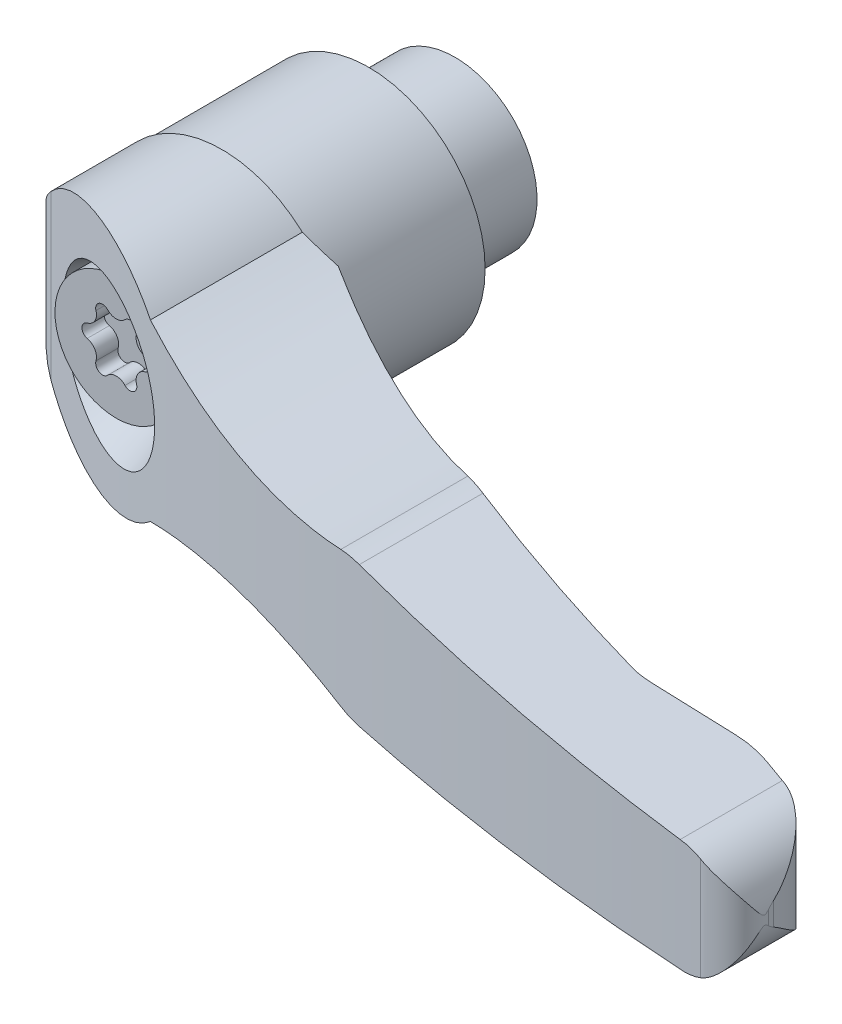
ISO-10303-21;
HEADER;
FILE_DESCRIPTION(('STEP AP214'),'2;1');
FILE_NAME('part.step','',(''),(''),'','','');
FILE_SCHEMA(('AUTOMOTIVE_DESIGN { 1 0 10303 214 1 1 1 1 }'));
ENDSEC;
DATA;
#1=APPLICATION_CONTEXT('core data for automotive mechanical design processes');
#2=APPLICATION_PROTOCOL_DEFINITION('international standard','automotive_design',2000,#1);
#3=PRODUCT_CONTEXT('',#1,'mechanical');
#4=PRODUCT('Part','Part','',(#3));
#5=PRODUCT_RELATED_PRODUCT_CATEGORY('part','',(#4));
#6=PRODUCT_DEFINITION_FORMATION('','',#4);
#7=PRODUCT_DEFINITION_CONTEXT('part definition',#1,'design');
#8=PRODUCT_DEFINITION('design','',#6,#7);
#9=PRODUCT_DEFINITION_SHAPE('','',#8);
#10=(LENGTH_UNIT() NAMED_UNIT(*) SI_UNIT(.MILLI.,.METRE.));
#11=(NAMED_UNIT(*) PLANE_ANGLE_UNIT() SI_UNIT($,.RADIAN.));
#12=(NAMED_UNIT(*) SI_UNIT($,.STERADIAN.) SOLID_ANGLE_UNIT());
#13=UNCERTAINTY_MEASURE_WITH_UNIT(LENGTH_MEASURE(1.E-05),#10,'distance_accuracy_value','');
#14=(GEOMETRIC_REPRESENTATION_CONTEXT(3) GLOBAL_UNCERTAINTY_ASSIGNED_CONTEXT((#13)) GLOBAL_UNIT_ASSIGNED_CONTEXT((#10,
#11,#12)) REPRESENTATION_CONTEXT('',''));
#15=CARTESIAN_POINT('',(0.,0.,0.));
#16=DIRECTION('',(0.,0.,1.));
#17=DIRECTION('',(1.,0.,0.));
#18=AXIS2_PLACEMENT_3D('',#15,#16,#17);
#19=CARTESIAN_POINT('',(0.,0.,36.66));
#20=DIRECTION('',(0.,0.,-1.));
#21=DIRECTION('',(0.,1.,0.));
#22=AXIS2_PLACEMENT_3D('',#19,#20,#21);
#23=PLANE('',#22);
#24=CARTESIAN_POINT('',(1.59,2.75396078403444,36.66));
#25=DIRECTION('',(0.,0.,-1.));
#26=DIRECTION('',(0.,1.,0.));
#27=AXIS2_PLACEMENT_3D('',#24,#25,#26);
#28=CIRCLE('',#27,0.795000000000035);
#29=CARTESIAN_POINT('',(2.3516351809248,2.5260642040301,36.66));
#30=VERTEX_POINT('',#29);
#31=CARTESIAN_POINT('',(1.0118181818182,3.2996079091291,36.66));
#32=VERTEX_POINT('',#31);
#33=EDGE_CURVE('E317',#30,#32,#28,.F.);
#34=ORIENTED_EDGE('',*,*,#33,.T.);
#35=CARTESIAN_POINT('',(0.,4.25449037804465,36.66));
#36=DIRECTION('',(0.,0.,-1.));
#37=DIRECTION('',(0.,1.,0.));
#38=AXIS2_PLACEMENT_3D('',#35,#36,#37);
#39=CIRCLE('',#38,1.39125000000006);
#40=CARTESIAN_POINT('',(-1.0118181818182,3.2996079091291,36.66));
#41=VERTEX_POINT('',#40);
#42=EDGE_CURVE('E278',#41,#32,#39,.F.);
#43=ORIENTED_EDGE('',*,*,#42,.F.);
#44=CARTESIAN_POINT('',(-1.58999999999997,2.75396078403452,36.66));
#45=DIRECTION('',(0.,0.,-1.));
#46=DIRECTION('',(0.,1.,0.));
#47=AXIS2_PLACEMENT_3D('',#44,#45,#46);
#48=CIRCLE('',#47,0.794999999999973);
#49=CARTESIAN_POINT('',(-2.3516351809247,2.5260642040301,36.66));
#50=VERTEX_POINT('',#49);
#51=EDGE_CURVE('E314',#41,#50,#48,.F.);
#52=ORIENTED_EDGE('',*,*,#51,.T.);
#53=CARTESIAN_POINT('',(-3.68449674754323,2.12724518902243,36.66));
#54=DIRECTION('',(0.,0.,-1.));
#55=DIRECTION('',(0.,1.,0.));
#56=AXIS2_PLACEMENT_3D('',#53,#54,#55);
#57=CIRCLE('',#56,1.39125000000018);
#58=CARTESIAN_POINT('',(-3.3634533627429,0.773543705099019,36.66));
#59=VERTEX_POINT('',#58);
#60=EDGE_CURVE('E273',#59,#50,#57,.F.);
#61=ORIENTED_EDGE('',*,*,#60,.F.);
#62=CARTESIAN_POINT('',(-3.18,0.,36.66));
#63=DIRECTION('',(0.,0.,-1.));
#64=DIRECTION('',(0.,1.,0.));
#65=AXIS2_PLACEMENT_3D('',#62,#63,#64);
#66=CIRCLE('',#65,0.795);
#67=CARTESIAN_POINT('',(-3.3634533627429,-0.773543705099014,36.66));
#68=VERTEX_POINT('',#67);
#69=EDGE_CURVE('E31',#59,#68,#66,.F.);
#70=ORIENTED_EDGE('',*,*,#69,.T.);
#71=CARTESIAN_POINT('',(-3.68449674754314,-2.12724518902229,36.66));
#72=DIRECTION('',(0.,0.,-1.));
#73=DIRECTION('',(0.,1.,0.));
#74=AXIS2_PLACEMENT_3D('',#71,#72,#73);
#75=CIRCLE('',#74,1.39125000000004);
#76=CARTESIAN_POINT('',(-2.3516351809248,-2.5260642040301,36.66));
#77=VERTEX_POINT('',#76);
#78=EDGE_CURVE('E266',#77,#68,#75,.F.);
#79=ORIENTED_EDGE('',*,*,#78,.F.);
#80=CARTESIAN_POINT('',(-1.59,-2.75396078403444,36.66));
#81=DIRECTION('',(0.,0.,-1.));
#82=DIRECTION('',(0.,1.,0.));
#83=AXIS2_PLACEMENT_3D('',#80,#81,#82);
#84=CIRCLE('',#83,0.795000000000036);
#85=CARTESIAN_POINT('',(-1.0118181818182,-3.2996079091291,36.66));
#86=VERTEX_POINT('',#85);
#87=EDGE_CURVE('E248',#77,#86,#84,.F.);
#88=ORIENTED_EDGE('',*,*,#87,.T.);
#89=CARTESIAN_POINT('',(0.,-4.25449037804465,36.66));
#90=DIRECTION('',(0.,0.,-1.));
#91=DIRECTION('',(0.,1.,0.));
#92=AXIS2_PLACEMENT_3D('',#89,#90,#91);
#93=CIRCLE('',#92,1.39125000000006);
#94=CARTESIAN_POINT('',(1.0118181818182,-3.2996079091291,36.66));
#95=VERTEX_POINT('',#94);
#96=EDGE_CURVE('E272',#95,#86,#93,.F.);
#97=ORIENTED_EDGE('',*,*,#96,.F.);
#98=CARTESIAN_POINT('',(1.58999999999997,-2.75396078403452,36.66));
#99=DIRECTION('',(0.,0.,-1.));
#100=DIRECTION('',(0.,1.,0.));
#101=AXIS2_PLACEMENT_3D('',#98,#99,#100);
#102=CIRCLE('',#101,0.794999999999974);
#103=CARTESIAN_POINT('',(2.3516351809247,-2.5260642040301,36.66));
#104=VERTEX_POINT('',#103);
#105=EDGE_CURVE('E327',#95,#104,#102,.F.);
#106=ORIENTED_EDGE('',*,*,#105,.T.);
#107=CARTESIAN_POINT('',(3.68449674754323,-2.12724518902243,36.66));
#108=DIRECTION('',(0.,0.,-1.));
#109=DIRECTION('',(0.,1.,0.));
#110=AXIS2_PLACEMENT_3D('',#107,#108,#109);
#111=CIRCLE('',#110,1.39125000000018);
#112=CARTESIAN_POINT('',(3.3634533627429,-0.773543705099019,36.66));
#113=VERTEX_POINT('',#112);
#114=EDGE_CURVE('E275',#113,#104,#111,.F.);
#115=ORIENTED_EDGE('',*,*,#114,.F.);
#116=CARTESIAN_POINT('',(3.18,0.,36.66));
#117=DIRECTION('',(0.,0.,-1.));
#118=DIRECTION('',(0.,1.,0.));
#119=AXIS2_PLACEMENT_3D('',#116,#117,#118);
#120=CIRCLE('',#119,0.795);
#121=CARTESIAN_POINT('',(3.3634533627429,0.773543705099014,36.66));
#122=VERTEX_POINT('',#121);
#123=EDGE_CURVE('E322',#113,#122,#120,.F.);
#124=ORIENTED_EDGE('',*,*,#123,.T.);
#125=CARTESIAN_POINT('',(3.68449674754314,2.12724518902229,36.66));
#126=DIRECTION('',(0.,0.,-1.));
#127=DIRECTION('',(0.,1.,0.));
#128=AXIS2_PLACEMENT_3D('',#125,#126,#127);
#129=CIRCLE('',#128,1.39125000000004);
#130=EDGE_CURVE('E284',#30,#122,#129,.F.);
#131=ORIENTED_EDGE('',*,*,#130,.F.);
#132=EDGE_LOOP('',(#34,#43,#52,#61,#70,#79,#88,#97,#106,#115,#124,#131));
#133=FACE_BOUND('',#132,.T.);
#134=ADVANCED_FACE('F14',(#133),#23,.F.);
#135=CARTESIAN_POINT('',(-3.68449674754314,-2.12724518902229,43.28));
#136=DIRECTION('',(0.,0.,-1.));
#137=DIRECTION('',(0.,1.,0.));
#138=AXIS2_PLACEMENT_3D('',#135,#136,#137);
#139=CYLINDRICAL_SURFACE('',#138,1.39125000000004);
#140=DIRECTION('',(0.,0.,-1.));
#141=VECTOR('',#140,1.);
#142=CARTESIAN_POINT('',(-2.3516351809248,-2.5260642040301,43.28));
#143=LINE('',#142,#141);
#144=CARTESIAN_POINT('',(-2.3516351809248,-2.5260642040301,39.23));
#145=VERTEX_POINT('',#144);
#146=EDGE_CURVE('E251',#145,#77,#143,.T.);
#147=ORIENTED_EDGE('',*,*,#146,.T.);
#148=ORIENTED_EDGE('',*,*,#78,.T.);
#149=DIRECTION('',(0.,0.,-1.));
#150=VECTOR('',#149,1.);
#151=CARTESIAN_POINT('',(-3.3634533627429,-0.773543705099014,43.28));
#152=LINE('',#151,#150);
#153=CARTESIAN_POINT('',(-3.3634533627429,-0.773543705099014,39.23));
#154=VERTEX_POINT('',#153);
#155=EDGE_CURVE('E269',#154,#68,#152,.T.);
#156=ORIENTED_EDGE('',*,*,#155,.F.);
#157=CARTESIAN_POINT('',(-3.68449674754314,-2.12724518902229,39.23));
#158=DIRECTION('',(0.,0.,1.));
#159=DIRECTION('',(0.,-1.,0.));
#160=AXIS2_PLACEMENT_3D('',#157,#158,#159);
#161=CIRCLE('',#160,1.39125000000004);
#162=EDGE_CURVE('E268',#145,#154,#161,.T.);
#163=ORIENTED_EDGE('',*,*,#162,.F.);
#164=EDGE_LOOP('',(#147,#148,#156,#163));
#165=FACE_BOUND('',#164,.T.);
#166=ADVANCED_FACE('F264',(#165),#139,.T.);
#167=CARTESIAN_POINT('',(-1.59,-2.75396078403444,43.28));
#168=DIRECTION('',(0.,0.,-1.));
#169=DIRECTION('',(0.,1.,0.));
#170=AXIS2_PLACEMENT_3D('',#167,#168,#169);
#171=CYLINDRICAL_SURFACE('',#170,0.795000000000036);
#172=DIRECTION('',(0.,0.,-1.));
#173=VECTOR('',#172,1.);
#174=CARTESIAN_POINT('',(-1.0118181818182,-3.2996079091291,43.28));
#175=LINE('',#174,#173);
#176=CARTESIAN_POINT('',(-1.0118181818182,-3.2996079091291,39.23));
#177=VERTEX_POINT('',#176);
#178=EDGE_CURVE('E254',#177,#86,#175,.T.);
#179=ORIENTED_EDGE('',*,*,#178,.T.);
#180=ORIENTED_EDGE('',*,*,#87,.F.);
#181=ORIENTED_EDGE('',*,*,#146,.F.);
#182=CARTESIAN_POINT('',(-1.59,-2.75396078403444,39.23));
#183=DIRECTION('',(0.,0.,1.));
#184=DIRECTION('',(0.,-1.,0.));
#185=AXIS2_PLACEMENT_3D('',#182,#183,#184);
#186=CIRCLE('',#185,0.795000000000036);
#187=EDGE_CURVE('E259',#177,#145,#186,.F.);
#188=ORIENTED_EDGE('',*,*,#187,.F.);
#189=EDGE_LOOP('',(#179,#180,#181,#188));
#190=FACE_BOUND('',#189,.T.);
#191=ADVANCED_FACE('F250',(#190),#171,.F.);
#192=CARTESIAN_POINT('',(0.,-4.25449037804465,43.28));
#193=DIRECTION('',(0.,0.,-1.));
#194=DIRECTION('',(0.,1.,0.));
#195=AXIS2_PLACEMENT_3D('',#192,#193,#194);
#196=CYLINDRICAL_SURFACE('',#195,1.39125000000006);
#197=DIRECTION('',(0.,0.,-1.));
#198=VECTOR('',#197,1.);
#199=CARTESIAN_POINT('',(1.0118181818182,-3.2996079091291,43.28));
#200=LINE('',#199,#198);
#201=CARTESIAN_POINT('',(1.0118181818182,-3.2996079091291,39.23));
#202=VERTEX_POINT('',#201);
#203=EDGE_CURVE('E307',#202,#95,#200,.T.);
#204=ORIENTED_EDGE('',*,*,#203,.T.);
#205=ORIENTED_EDGE('',*,*,#96,.T.);
#206=ORIENTED_EDGE('',*,*,#178,.F.);
#207=CARTESIAN_POINT('',(0.,-4.25449037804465,39.23));
#208=DIRECTION('',(0.,0.,1.));
#209=DIRECTION('',(0.,-1.,0.));
#210=AXIS2_PLACEMENT_3D('',#207,#208,#209);
#211=CIRCLE('',#210,1.39125000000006);
#212=EDGE_CURVE('E348',#202,#177,#211,.T.);
#213=ORIENTED_EDGE('',*,*,#212,.F.);
#214=EDGE_LOOP('',(#204,#205,#206,#213));
#215=FACE_BOUND('',#214,.T.);
#216=ADVANCED_FACE('F661',(#215),#196,.T.);
#217=CARTESIAN_POINT('',(1.58999999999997,-2.75396078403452,43.28));
#218=DIRECTION('',(0.,0.,-1.));
#219=DIRECTION('',(0.,1.,0.));
#220=AXIS2_PLACEMENT_3D('',#217,#218,#219);
#221=CYLINDRICAL_SURFACE('',#220,0.794999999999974);
#222=DIRECTION('',(0.,0.,-1.));
#223=VECTOR('',#222,1.);
#224=CARTESIAN_POINT('',(2.3516351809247,-2.5260642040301,43.28));
#225=LINE('',#224,#223);
#226=CARTESIAN_POINT('',(2.3516351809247,-2.5260642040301,39.23));
#227=VERTEX_POINT('',#226);
#228=EDGE_CURVE('E304',#227,#104,#225,.T.);
#229=ORIENTED_EDGE('',*,*,#228,.T.);
#230=ORIENTED_EDGE('',*,*,#105,.F.);
#231=ORIENTED_EDGE('',*,*,#203,.F.);
#232=CARTESIAN_POINT('',(1.58999999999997,-2.75396078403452,39.23));
#233=DIRECTION('',(0.,0.,1.));
#234=DIRECTION('',(0.,-1.,0.));
#235=AXIS2_PLACEMENT_3D('',#232,#233,#234);
#236=CIRCLE('',#235,0.794999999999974);
#237=EDGE_CURVE('E260',#227,#202,#236,.F.);
#238=ORIENTED_EDGE('',*,*,#237,.F.);
#239=EDGE_LOOP('',(#229,#230,#231,#238));
#240=FACE_BOUND('',#239,.T.);
#241=ADVANCED_FACE('F657',(#240),#221,.F.);
#242=CARTESIAN_POINT('',(3.68449674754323,-2.12724518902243,43.28));
#243=DIRECTION('',(0.,0.,-1.));
#244=DIRECTION('',(0.,1.,0.));
#245=AXIS2_PLACEMENT_3D('',#242,#243,#244);
#246=CYLINDRICAL_SURFACE('',#245,1.39125000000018);
#247=DIRECTION('',(0.,0.,-1.));
#248=VECTOR('',#247,1.);
#249=CARTESIAN_POINT('',(3.3634533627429,-0.773543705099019,43.28));
#250=LINE('',#249,#248);
#251=CARTESIAN_POINT('',(3.3634533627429,-0.773543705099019,39.23));
#252=VERTEX_POINT('',#251);
#253=EDGE_CURVE('E301',#252,#113,#250,.T.);
#254=ORIENTED_EDGE('',*,*,#253,.T.);
#255=ORIENTED_EDGE('',*,*,#114,.T.);
#256=ORIENTED_EDGE('',*,*,#228,.F.);
#257=CARTESIAN_POINT('',(3.68449674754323,-2.12724518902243,39.23));
#258=DIRECTION('',(0.,0.,1.));
#259=DIRECTION('',(0.,-1.,0.));
#260=AXIS2_PLACEMENT_3D('',#257,#258,#259);
#261=CIRCLE('',#260,1.39125000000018);
#262=EDGE_CURVE('E345',#252,#227,#261,.T.);
#263=ORIENTED_EDGE('',*,*,#262,.F.);
#264=EDGE_LOOP('',(#254,#255,#256,#263));
#265=FACE_BOUND('',#264,.T.);
#266=ADVANCED_FACE('F653',(#265),#246,.T.);
#267=CARTESIAN_POINT('',(3.18,0.,43.28));
#268=DIRECTION('',(0.,0.,-1.));
#269=DIRECTION('',(0.,1.,0.));
#270=AXIS2_PLACEMENT_3D('',#267,#268,#269);
#271=CYLINDRICAL_SURFACE('',#270,0.795);
#272=DIRECTION('',(0.,0.,-1.));
#273=VECTOR('',#272,1.);
#274=CARTESIAN_POINT('',(3.3634533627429,0.773543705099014,43.28));
#275=LINE('',#274,#273);
#276=CARTESIAN_POINT('',(3.3634533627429,0.773543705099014,39.23));
#277=VERTEX_POINT('',#276);
#278=EDGE_CURVE('E298',#277,#122,#275,.T.);
#279=ORIENTED_EDGE('',*,*,#278,.T.);
#280=ORIENTED_EDGE('',*,*,#123,.F.);
#281=ORIENTED_EDGE('',*,*,#253,.F.);
#282=CARTESIAN_POINT('',(3.18,0.,39.23));
#283=DIRECTION('',(0.,0.,1.));
#284=DIRECTION('',(0.,-1.,0.));
#285=AXIS2_PLACEMENT_3D('',#282,#283,#284);
#286=CIRCLE('',#285,0.795);
#287=EDGE_CURVE('E324',#277,#252,#286,.F.);
#288=ORIENTED_EDGE('',*,*,#287,.F.);
#289=EDGE_LOOP('',(#279,#280,#281,#288));
#290=FACE_BOUND('',#289,.T.);
#291=ADVANCED_FACE('F649',(#290),#271,.F.);
#292=CARTESIAN_POINT('',(3.68449674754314,2.12724518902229,43.28));
#293=DIRECTION('',(0.,0.,-1.));
#294=DIRECTION('',(0.,1.,0.));
#295=AXIS2_PLACEMENT_3D('',#292,#293,#294);
#296=CYLINDRICAL_SURFACE('',#295,1.39125000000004);
#297=DIRECTION('',(0.,0.,-1.));
#298=VECTOR('',#297,1.);
#299=CARTESIAN_POINT('',(2.3516351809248,2.5260642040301,43.28));
#300=LINE('',#299,#298);
#301=CARTESIAN_POINT('',(2.3516351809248,2.5260642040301,39.23));
#302=VERTEX_POINT('',#301);
#303=EDGE_CURVE('E295',#302,#30,#300,.T.);
#304=ORIENTED_EDGE('',*,*,#303,.T.);
#305=ORIENTED_EDGE('',*,*,#130,.T.);
#306=ORIENTED_EDGE('',*,*,#278,.F.);
#307=CARTESIAN_POINT('',(3.68449674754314,2.12724518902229,39.23));
#308=DIRECTION('',(0.,0.,1.));
#309=DIRECTION('',(0.,-1.,0.));
#310=AXIS2_PLACEMENT_3D('',#307,#308,#309);
#311=CIRCLE('',#310,1.39125000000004);
#312=EDGE_CURVE('E342',#302,#277,#311,.T.);
#313=ORIENTED_EDGE('',*,*,#312,.F.);
#314=EDGE_LOOP('',(#304,#305,#306,#313));
#315=FACE_BOUND('',#314,.T.);
#316=ADVANCED_FACE('F645',(#315),#296,.T.);
#317=CARTESIAN_POINT('',(1.59,2.75396078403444,43.28));
#318=DIRECTION('',(0.,0.,-1.));
#319=DIRECTION('',(0.,1.,0.));
#320=AXIS2_PLACEMENT_3D('',#317,#318,#319);
#321=CYLINDRICAL_SURFACE('',#320,0.795000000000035);
#322=ORIENTED_EDGE('',*,*,#33,.F.);
#323=ORIENTED_EDGE('',*,*,#303,.F.);
#324=CARTESIAN_POINT('',(1.59,2.75396078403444,39.23));
#325=DIRECTION('',(0.,0.,1.));
#326=DIRECTION('',(0.,-1.,0.));
#327=AXIS2_PLACEMENT_3D('',#324,#325,#326);
#328=CIRCLE('',#327,0.795000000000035);
#329=CARTESIAN_POINT('',(1.0118181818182,3.2996079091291,39.23));
#330=VERTEX_POINT('',#329);
#331=EDGE_CURVE('E319',#330,#302,#328,.F.);
#332=ORIENTED_EDGE('',*,*,#331,.F.);
#333=DIRECTION('',(0.,0.,-1.));
#334=VECTOR('',#333,1.);
#335=CARTESIAN_POINT('',(1.0118181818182,3.2996079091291,43.28));
#336=LINE('',#335,#334);
#337=EDGE_CURVE('E292',#330,#32,#336,.T.);
#338=ORIENTED_EDGE('',*,*,#337,.T.);
#339=EDGE_LOOP('',(#322,#323,#332,#338));
#340=FACE_BOUND('',#339,.T.);
#341=ADVANCED_FACE('F641',(#340),#321,.F.);
#342=CARTESIAN_POINT('',(0.,4.25449037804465,43.28));
#343=DIRECTION('',(0.,0.,-1.));
#344=DIRECTION('',(0.,1.,0.));
#345=AXIS2_PLACEMENT_3D('',#342,#343,#344);
#346=CYLINDRICAL_SURFACE('',#345,1.39125000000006);
#347=DIRECTION('',(0.,0.,-1.));
#348=VECTOR('',#347,1.);
#349=CARTESIAN_POINT('',(-1.0118181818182,3.2996079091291,43.28));
#350=LINE('',#349,#348);
#351=CARTESIAN_POINT('',(-1.0118181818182,3.2996079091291,39.23));
#352=VERTEX_POINT('',#351);
#353=EDGE_CURVE('E289',#352,#41,#350,.T.);
#354=ORIENTED_EDGE('',*,*,#353,.T.);
#355=ORIENTED_EDGE('',*,*,#42,.T.);
#356=ORIENTED_EDGE('',*,*,#337,.F.);
#357=CARTESIAN_POINT('',(0.,4.25449037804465,39.23));
#358=DIRECTION('',(0.,0.,1.));
#359=DIRECTION('',(0.,-1.,0.));
#360=AXIS2_PLACEMENT_3D('',#357,#358,#359);
#361=CIRCLE('',#360,1.39125000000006);
#362=EDGE_CURVE('E339',#352,#330,#361,.T.);
#363=ORIENTED_EDGE('',*,*,#362,.F.);
#364=EDGE_LOOP('',(#354,#355,#356,#363));
#365=FACE_BOUND('',#364,.T.);
#366=ADVANCED_FACE('F638',(#365),#346,.T.);
#367=CARTESIAN_POINT('',(-1.58999999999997,2.75396078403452,43.28));
#368=DIRECTION('',(0.,0.,-1.));
#369=DIRECTION('',(0.,1.,0.));
#370=AXIS2_PLACEMENT_3D('',#367,#368,#369);
#371=CYLINDRICAL_SURFACE('',#370,0.794999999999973);
#372=ORIENTED_EDGE('',*,*,#51,.F.);
#373=ORIENTED_EDGE('',*,*,#353,.F.);
#374=CARTESIAN_POINT('',(-1.58999999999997,2.75396078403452,39.23));
#375=DIRECTION('',(0.,0.,1.));
#376=DIRECTION('',(0.,-1.,0.));
#377=AXIS2_PLACEMENT_3D('',#374,#375,#376);
#378=CIRCLE('',#377,0.794999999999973);
#379=CARTESIAN_POINT('',(-2.3516351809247,2.5260642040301,39.23));
#380=VERTEX_POINT('',#379);
#381=EDGE_CURVE('E184',#380,#352,#378,.F.);
#382=ORIENTED_EDGE('',*,*,#381,.F.);
#383=DIRECTION('',(0.,0.,-1.));
#384=VECTOR('',#383,1.);
#385=CARTESIAN_POINT('',(-2.3516351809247,2.5260642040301,43.28));
#386=LINE('',#385,#384);
#387=EDGE_CURVE('E287',#380,#50,#386,.T.);
#388=ORIENTED_EDGE('',*,*,#387,.T.);
#389=EDGE_LOOP('',(#372,#373,#382,#388));
#390=FACE_BOUND('',#389,.T.);
#391=ADVANCED_FACE('F634',(#390),#371,.F.);
#392=CARTESIAN_POINT('',(-3.68449674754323,2.12724518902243,43.28));
#393=DIRECTION('',(0.,0.,-1.));
#394=DIRECTION('',(0.,1.,0.));
#395=AXIS2_PLACEMENT_3D('',#392,#393,#394);
#396=CYLINDRICAL_SURFACE('',#395,1.39125000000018);
#397=DIRECTION('',(0.,0.,-1.));
#398=VECTOR('',#397,1.);
#399=CARTESIAN_POINT('',(-3.3634533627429,0.773543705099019,43.28));
#400=LINE('',#399,#398);
#401=CARTESIAN_POINT('',(-3.3634533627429,0.773543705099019,39.23));
#402=VERTEX_POINT('',#401);
#403=EDGE_CURVE('E312',#402,#59,#400,.T.);
#404=ORIENTED_EDGE('',*,*,#403,.T.);
#405=ORIENTED_EDGE('',*,*,#60,.T.);
#406=ORIENTED_EDGE('',*,*,#387,.F.);
#407=CARTESIAN_POINT('',(-3.68449674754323,2.12724518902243,39.23));
#408=DIRECTION('',(0.,0.,1.));
#409=DIRECTION('',(0.,-1.,0.));
#410=AXIS2_PLACEMENT_3D('',#407,#408,#409);
#411=CIRCLE('',#410,1.39125000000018);
#412=EDGE_CURVE('E352',#402,#380,#411,.T.);
#413=ORIENTED_EDGE('',*,*,#412,.F.);
#414=EDGE_LOOP('',(#404,#405,#406,#413));
#415=FACE_BOUND('',#414,.T.);
#416=ADVANCED_FACE('F637',(#415),#396,.T.);
#417=CARTESIAN_POINT('',(-3.18,0.,43.28));
#418=DIRECTION('',(0.,0.,-1.));
#419=DIRECTION('',(0.,1.,0.));
#420=AXIS2_PLACEMENT_3D('',#417,#418,#419);
#421=CYLINDRICAL_SURFACE('',#420,0.795);
#422=ORIENTED_EDGE('',*,*,#155,.T.);
#423=ORIENTED_EDGE('',*,*,#69,.F.);
#424=ORIENTED_EDGE('',*,*,#403,.F.);
#425=CARTESIAN_POINT('',(-3.18,0.,39.23));
#426=DIRECTION('',(0.,0.,1.));
#427=DIRECTION('',(0.,-1.,0.));
#428=AXIS2_PLACEMENT_3D('',#425,#426,#427);
#429=CIRCLE('',#428,0.795);
#430=EDGE_CURVE('E333',#154,#402,#429,.F.);
#431=ORIENTED_EDGE('',*,*,#430,.F.);
#432=EDGE_LOOP('',(#422,#423,#424,#431));
#433=FACE_BOUND('',#432,.T.);
#434=ADVANCED_FACE('F668',(#433),#421,.F.);
#435=CARTESIAN_POINT('',(0.,0.,39.23));
#436=DIRECTION('',(0.,0.,1.));
#437=DIRECTION('',(0.,-1.,0.));
#438=AXIS2_PLACEMENT_3D('',#435,#436,#437);
#439=PLANE('',#438);
#440=CARTESIAN_POINT('',(0.,0.,39.23));
#441=DIRECTION('',(0.,0.,1.));
#442=DIRECTION('',(0.,-1.,0.));
#443=AXIS2_PLACEMENT_3D('',#440,#441,#442);
#444=CIRCLE('',#443,7.1);
#445=CARTESIAN_POINT('',(0.,-7.1,39.23));
#446=VERTEX_POINT('',#445);
#447=EDGE_CURVE('E336',#446,#446,#444,.T.);
#448=ORIENTED_EDGE('',*,*,#447,.T.);
#449=EDGE_LOOP('',(#448));
#450=FACE_BOUND('',#449,.T.);
#451=ORIENTED_EDGE('',*,*,#430,.T.);
#452=ORIENTED_EDGE('',*,*,#412,.T.);
#453=ORIENTED_EDGE('',*,*,#381,.T.);
#454=ORIENTED_EDGE('',*,*,#362,.T.);
#455=ORIENTED_EDGE('',*,*,#331,.T.);
#456=ORIENTED_EDGE('',*,*,#312,.T.);
#457=ORIENTED_EDGE('',*,*,#287,.T.);
#458=ORIENTED_EDGE('',*,*,#262,.T.);
#459=ORIENTED_EDGE('',*,*,#237,.T.);
#460=ORIENTED_EDGE('',*,*,#212,.T.);
#461=ORIENTED_EDGE('',*,*,#187,.T.);
#462=ORIENTED_EDGE('',*,*,#162,.T.);
#463=EDGE_LOOP('',(#451,#452,#453,#454,#455,#456,#457,#458,#459,#460,#461,#462));
#464=FACE_BOUND('',#463,.T.);
#465=ADVANCED_FACE('F602',(#450,#464),#439,.T.);
#466=CARTESIAN_POINT('',(86.1065455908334,-14.75,59.104403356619));
#467=DIRECTION('',(0.,1.,0.));
#468=DIRECTION('',(-1.,0.,0.));
#469=AXIS2_PLACEMENT_3D('',#466,#467,#468);
#470=CYLINDRICAL_SURFACE('',#469,8.83000000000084);
#471=CARTESIAN_POINT('',(88.9098071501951,-6.48706852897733,50.731194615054));
#472=CARTESIAN_POINT('',(89.0897697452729,-6.47572771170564,50.79139886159));
#473=CARTESIAN_POINT('',(89.267235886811,-6.45697335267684,50.8573067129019));
#474=CARTESIAN_POINT('',(89.6156587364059,-6.40594654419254,50.9994566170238));
#475=CARTESIAN_POINT('',(89.7866254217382,-6.37369580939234,51.0756819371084));
#476=CARTESIAN_POINT('',(90.1193873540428,-6.29733777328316,51.2367553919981));
#477=CARTESIAN_POINT('',(90.2812591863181,-6.25335658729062,51.3215061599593));
#478=CARTESIAN_POINT('',(90.5970344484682,-6.15465850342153,51.4993225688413));
#479=CARTESIAN_POINT('',(90.750933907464,-6.0999363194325,51.592392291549));
#480=CARTESIAN_POINT('',(91.0845425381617,-5.96735555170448,51.808073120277));
#481=CARTESIAN_POINT('',(91.2620732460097,-5.88706921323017,51.9325631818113));
#482=CARTESIAN_POINT('',(91.6037719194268,-5.71430400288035,52.1909876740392));
#483=CARTESIAN_POINT('',(91.7679381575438,-5.62182355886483,52.324923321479));
#484=CARTESIAN_POINT('',(92.0835205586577,-5.42614069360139,52.6014136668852));
#485=CARTESIAN_POINT('',(92.2348770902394,-5.32289263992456,52.7440038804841));
#486=CARTESIAN_POINT('',(92.5241674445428,-5.10769832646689,53.0360195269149));
#487=CARTESIAN_POINT('',(92.6621003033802,-4.99575144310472,53.1854454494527));
#488=CARTESIAN_POINT('',(92.9757333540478,-4.71982512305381,53.5491307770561));
#489=CARTESIAN_POINT('',(93.1453696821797,-4.5524861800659,53.7660853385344));
#490=CARTESIAN_POINT('',(93.4603079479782,-4.20713466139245,54.2089998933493));
#491=CARTESIAN_POINT('',(93.6056001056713,-4.02911783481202,54.4349634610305));
#492=CARTESIAN_POINT('',(93.8728003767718,-3.66523875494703,54.894320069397));
#493=CARTESIAN_POINT('',(93.9947026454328,-3.47937455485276,55.127714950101));
#494=CARTESIAN_POINT('',(94.2159458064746,-3.10252192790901,55.6008670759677));
#495=CARTESIAN_POINT('',(94.3152909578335,-2.91153447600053,55.8406231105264));
#496=CARTESIAN_POINT('',(94.4598076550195,-2.59782196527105,56.2375651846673));
#497=CARTESIAN_POINT('',(94.5115034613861,-2.47567903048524,56.392878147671));
#498=CARTESIAN_POINT('',(94.6062509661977,-2.23176482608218,56.7063336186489));
#499=CARTESIAN_POINT('',(94.6493059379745,-2.10999343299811,56.8644750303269));
#500=CARTESIAN_POINT('',(94.7073954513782,-1.92930841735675,57.1041561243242));
#501=CARTESIAN_POINT('',(94.7256435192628,-1.86953763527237,57.1842829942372));
#502=CARTESIAN_POINT('',(94.760022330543,-1.75098004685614,57.3456972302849));
#503=CARTESIAN_POINT('',(94.776153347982,-1.69219311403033,57.4269844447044));
#504=CARTESIAN_POINT('',(94.8063065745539,-1.57609424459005,57.5911123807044));
#505=CARTESIAN_POINT('',(94.8203269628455,-1.51878361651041,57.6739543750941));
#506=CARTESIAN_POINT('',(94.8462112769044,-1.40676062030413,57.8417526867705));
#507=CARTESIAN_POINT('',(94.8580742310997,-1.35204943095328,57.9267099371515));
#508=CARTESIAN_POINT('',(94.868836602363,-1.29919988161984,58.013002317));
#509=B_SPLINE_CURVE_WITH_KNOTS('',3,(#471,#472,#473,#474,#475,#476,#477,#478,#479,#480,#481,
#482,#483,#484,#485,#486,#487,#488,#489,#490,#491,#492,#493,#494,#495,#496,#497,#498,#499,#500,
#501,#502,#503,#504,#505,#506,#507,#508),.UNSPECIFIED.,.F.,.F.,(4,2,2,2,2,2,2,2,2,2,2,2,2,2,2,2,
2,2,4),(0.,0.569903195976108,1.13889296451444,1.70199618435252,2.26537722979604,
2.95800230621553,3.65071676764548,4.34649638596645,5.04232592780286,6.00766077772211,
6.97338251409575,7.93934525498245,8.90512546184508,9.51766996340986,10.1299819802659,
10.4348045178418,10.7395875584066,11.0446320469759,11.349813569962),.UNSPECIFIED.);
#510=CARTESIAN_POINT('',(88.9098071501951,-6.48706852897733,50.731194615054));
#511=VERTEX_POINT('',#510);
#512=CARTESIAN_POINT('',(94.868836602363,-1.29919988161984,58.013002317));
#513=VERTEX_POINT('',#512);
#514=EDGE_CURVE('E582',#511,#513,#509,.T.);
#515=ORIENTED_EDGE('',*,*,#514,.F.);
#516=DIRECTION('',(0.,1.,0.));
#517=VECTOR('',#516,1.);
#518=CARTESIAN_POINT('',(88.909807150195,-14.75,50.731194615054));
#519=LINE('',#518,#517);
#520=CARTESIAN_POINT('',(88.909807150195,6.48706852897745,50.731194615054));
#521=VERTEX_POINT('',#520);
#522=EDGE_CURVE('E727',#511,#521,#519,.T.);
#523=ORIENTED_EDGE('',*,*,#522,.T.);
#524=CARTESIAN_POINT('',(94.868836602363,1.29919988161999,58.013002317));
#525=CARTESIAN_POINT('',(94.8598905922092,1.34309764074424,57.9412335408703));
#526=CARTESIAN_POINT('',(94.8501811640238,1.38833454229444,57.8704151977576));
#527=CARTESIAN_POINT('',(94.8292644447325,1.48075225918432,57.730315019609));
#528=CARTESIAN_POINT('',(94.8180576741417,1.52793239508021,57.6610326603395));
#529=CARTESIAN_POINT('',(94.7822406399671,1.67127035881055,57.4549618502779));
#530=CARTESIAN_POINT('',(94.7554216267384,1.76928633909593,57.3198547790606));
#531=CARTESIAN_POINT('',(94.6959351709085,1.96751896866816,57.0525736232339));
#532=CARTESIAN_POINT('',(94.6632668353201,2.06773595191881,56.9203999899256));
#533=CARTESIAN_POINT('',(94.5920450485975,2.26900598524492,56.6582540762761));
#534=CARTESIAN_POINT('',(94.553490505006,2.37005918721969,56.5282822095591));
#535=CARTESIAN_POINT('',(94.4700311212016,2.57311073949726,56.2689600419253));
#536=CARTESIAN_POINT('',(94.4250680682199,2.67510870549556,56.1396281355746));
#537=CARTESIAN_POINT('',(94.3289987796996,2.87844084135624,55.882764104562));
#538=CARTESIAN_POINT('',(94.2778928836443,2.97977504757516,55.7552318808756));
#539=CARTESIAN_POINT('',(94.1152135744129,3.28202886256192,55.3753189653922));
#540=CARTESIAN_POINT('',(93.9942476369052,3.48127599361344,55.1255256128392));
#541=CARTESIAN_POINT('',(93.749734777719,3.83777694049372,54.6767706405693));
#542=CARTESIAN_POINT('',(93.630322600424,3.99629089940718,54.4765458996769));
#543=CARTESIAN_POINT('',(93.373135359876,4.30616830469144,54.0823566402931));
#544=CARTESIAN_POINT('',(93.2353595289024,4.45753145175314,53.8883923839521));
#545=CARTESIAN_POINT('',(92.9412287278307,4.75062950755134,53.5085527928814));
#546=CARTESIAN_POINT('',(92.7849276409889,4.89239054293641,53.3226560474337));
#547=CARTESIAN_POINT('',(92.4528785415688,5.16437580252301,52.9600281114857));
#548=CARTESIAN_POINT('',(92.277138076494,5.29460446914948,52.7832934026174));
#549=CARTESIAN_POINT('',(91.9594754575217,5.50519013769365,52.4904514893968));
#550=CARTESIAN_POINT('',(91.8224409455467,5.58908954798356,52.371573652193));
#551=CARTESIAN_POINT('',(91.5383180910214,5.74849152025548,52.1403319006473));
#552=CARTESIAN_POINT('',(91.3912300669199,5.82399434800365,52.027967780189));
#553=CARTESIAN_POINT('',(91.0875573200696,5.96510608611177,51.8110413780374));
#554=CARTESIAN_POINT('',(90.9309998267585,6.03074163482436,51.7064584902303));
#555=CARTESIAN_POINT('',(90.6084885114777,6.15092679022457,51.5058847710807));
#556=CARTESIAN_POINT('',(90.4425377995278,6.20548003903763,51.409891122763));
#557=CARTESIAN_POINT('',(90.0579091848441,6.31446049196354,51.204116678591));
#558=CARTESIAN_POINT('',(89.8366451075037,6.36524880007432,51.0971370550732));
#559=CARTESIAN_POINT('',(89.4957087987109,6.42432621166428,50.9497771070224));
#560=CARTESIAN_POINT('',(89.3803026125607,6.44118527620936,50.9027564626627));
#561=CARTESIAN_POINT('',(89.1468962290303,6.46879782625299,50.8133959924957));
#562=CARTESIAN_POINT('',(89.028894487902,6.47954757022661,50.7710590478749));
#563=CARTESIAN_POINT('',(88.909807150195,6.48706852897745,50.731194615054));
#564=B_SPLINE_CURVE_WITH_KNOTS('',3,(#524,#525,#526,#527,#528,#529,#530,#531,#532,#533,#534,
#535,#536,#537,#538,#539,#540,#541,#542,#543,#544,#545,#546,#547,#548,#549,#550,#551,#552,#553,
#554,#555,#556,#557,#558,#559,#560,#561,#562,#563),.UNSPECIFIED.,.F.,.F.,(4,2,2,2,2,2,2,2,2,2,2,
2,2,2,2,2,2,2,2,4),(0.,0.253746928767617,0.507405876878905,1.01438460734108,1.5214408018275,
2.02859121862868,2.54068295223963,3.05274639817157,4.07649386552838,4.92157638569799,
5.76669424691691,6.60941165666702,7.45180301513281,8.05095332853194,8.65008467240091,
9.24756833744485,9.84485532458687,10.5957153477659,10.9727456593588,11.3500066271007),.UNSPECIFIED.);
#565=CARTESIAN_POINT('',(94.868836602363,1.29919988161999,58.013002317));
#566=VERTEX_POINT('',#565);
#567=EDGE_CURVE('E567',#566,#521,#564,.T.);
#568=ORIENTED_EDGE('',*,*,#567,.F.);
#569=DIRECTION('',(0.,1.,0.));
#570=VECTOR('',#569,1.);
#571=CARTESIAN_POINT('',(94.868836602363,-14.75,58.013002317));
#572=LINE('',#571,#570);
#573=EDGE_CURVE('E719',#513,#566,#572,.T.);
#574=ORIENTED_EDGE('',*,*,#573,.F.);
#575=EDGE_LOOP('',(#515,#523,#568,#574));
#576=FACE_BOUND('',#575,.T.);
#577=ADVANCED_FACE('F597',(#576),#470,.T.);
#578=CARTESIAN_POINT('',(94.868836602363,-14.75,58.013002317));
#579=DIRECTION('',(-0.992331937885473,0.,0.123601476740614));
#580=DIRECTION('',(-0.123601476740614,0.,-0.992331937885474));
#581=AXIS2_PLACEMENT_3D('',#578,#579,#580);
#582=PLANE('',#581);
#583=CARTESIAN_POINT('',(88.5,0.,6.88092740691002));
#584=DIRECTION('',(-0.992331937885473,0.,0.123601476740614));
#585=DIRECTION('',(0.123601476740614,0.,0.992331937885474));
#586=AXIS2_PLACEMENT_3D('',#583,#584,#585);
#587=ELLIPSE('',#586,52.588368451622,6.5);
#588=CARTESIAN_POINT('',(94.951162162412,0.795302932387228,58.673951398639));
#589=VERTEX_POINT('',#588);
#590=EDGE_CURVE('E1317',#589,#566,#587,.T.);
#591=ORIENTED_EDGE('',*,*,#590,.F.);
#592=DIRECTION('',(0.,1.,0.));
#593=VECTOR('',#592,1.);
#594=CARTESIAN_POINT('',(94.9511621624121,-14.75,58.673951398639));
#595=LINE('',#594,#593);
#596=CARTESIAN_POINT('',(94.951162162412,-0.795302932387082,58.673951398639));
#597=VERTEX_POINT('',#596);
#598=EDGE_CURVE('E715',#597,#589,#595,.T.);
#599=ORIENTED_EDGE('',*,*,#598,.F.);
#600=EDGE_CURVE('E580',#513,#597,#587,.T.);
#601=ORIENTED_EDGE('',*,*,#600,.F.);
#602=ORIENTED_EDGE('',*,*,#573,.T.);
#603=EDGE_LOOP('',(#591,#599,#601,#602));
#604=FACE_BOUND('',#603,.T.);
#605=ADVANCED_FACE('F593',(#604),#582,.F.);
#606=CARTESIAN_POINT('',(0.,0.,10.));
#607=DIRECTION('',(0.,0.,1.));
#608=DIRECTION('',(0.,-1.,0.));
#609=AXIS2_PLACEMENT_3D('',#606,#607,#608);
#610=CYLINDRICAL_SURFACE('',#609,7.1);
#611=ORIENTED_EDGE('',*,*,#447,.F.);
#612=EDGE_LOOP('',(#611));
#613=FACE_BOUND('',#612,.T.);
#614=CARTESIAN_POINT('',(0.,0.,36.66));
#615=DIRECTION('',(0.,0.,1.));
#616=DIRECTION('',(0.,-1.,0.));
#617=AXIS2_PLACEMENT_3D('',#614,#615,#616);
#618=CIRCLE('',#617,7.1);
#619=CARTESIAN_POINT('',(0.,-7.1,36.66));
#620=VERTEX_POINT('',#619);
#621=EDGE_CURVE('E23',#620,#620,#618,.T.);
#622=ORIENTED_EDGE('',*,*,#621,.T.);
#623=EDGE_LOOP('',(#622));
#624=FACE_BOUND('',#623,.T.);
#625=ADVANCED_FACE('F596',(#613,#624),#610,.T.);
#626=CARTESIAN_POINT('',(71.65232690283,-14.75,48.97));
#627=DIRECTION('',(0.,0.,1.));
#628=DIRECTION('',(0.,-1.,0.));
#629=AXIS2_PLACEMENT_3D('',#626,#627,#628);
#630=PLANE('',#629);
#631=DIRECTION('',(-0.999341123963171,0.0362948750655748,0.));
#632=VECTOR('',#631,1.);
#633=CARTESIAN_POINT('',(72.4452785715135,7.08308829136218,48.97));
#634=LINE('',#633,#632);
#635=CARTESIAN_POINT('',(81.467303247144,6.75541913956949,48.97));
#636=VERTEX_POINT('',#635);
#637=CARTESIAN_POINT('',(71.65232690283,7.11188734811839,48.97));
#638=VERTEX_POINT('',#637);
#639=EDGE_CURVE('E1296',#636,#638,#634,.T.);
#640=ORIENTED_EDGE('',*,*,#639,.F.);
#641=DIRECTION('',(0.,1.,0.));
#642=VECTOR('',#641,1.);
#643=CARTESIAN_POINT('',(81.467303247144,-14.75,48.97));
#644=LINE('',#643,#642);
#645=CARTESIAN_POINT('',(81.4673032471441,-6.75541913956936,48.97));
#646=VERTEX_POINT('',#645);
#647=EDGE_CURVE('E733',#646,#636,#644,.T.);
#648=ORIENTED_EDGE('',*,*,#647,.F.);
#649=DIRECTION('',(0.999341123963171,0.0362948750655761,0.));
#650=VECTOR('',#649,1.);
#651=CARTESIAN_POINT('',(71.3752852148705,-7.12194917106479,48.97));
#652=LINE('',#651,#650);
#653=CARTESIAN_POINT('',(71.6523269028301,-7.11188734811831,48.97));
#654=VERTEX_POINT('',#653);
#655=EDGE_CURVE('E1307',#654,#646,#652,.T.);
#656=ORIENTED_EDGE('',*,*,#655,.F.);
#657=DIRECTION('',(0.,1.,0.));
#658=VECTOR('',#657,1.);
#659=CARTESIAN_POINT('',(71.65232690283,-14.75,48.97));
#660=LINE('',#659,#658);
#661=EDGE_CURVE('E736',#654,#638,#660,.T.);
#662=ORIENTED_EDGE('',*,*,#661,.T.);
#663=EDGE_LOOP('',(#640,#648,#656,#662));
#664=FACE_BOUND('',#663,.T.);
#665=ADVANCED_FACE('F610',(#664),#630,.F.);
#666=CARTESIAN_POINT('',(81.4673032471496,-14.75,62.3599999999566));
#667=DIRECTION('',(0.,1.,0.));
#668=DIRECTION('',(-1.,0.,0.));
#669=AXIS2_PLACEMENT_3D('',#666,#667,#668);
#670=CYLINDRICAL_SURFACE('',#669,13.3899999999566);
#671=CARTESIAN_POINT('',(81.4673032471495,6.75541913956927,62.3599999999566));
#672=DIRECTION('',(0.0362948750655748,0.999341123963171,0.));
#673=DIRECTION('',(-0.999341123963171,0.0362948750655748,0.));
#674=AXIS2_PLACEMENT_3D('',#671,#672,#673);
#675=ELLIPSE('',#674,13.3988281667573,13.3899999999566);
#676=CARTESIAN_POINT('',(85.7182287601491,6.60103060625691,49.662687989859));
#677=VERTEX_POINT('',#676);
#678=EDGE_CURVE('E1295',#677,#636,#675,.T.);
#679=ORIENTED_EDGE('',*,*,#678,.F.);
#680=DIRECTION('',(0.,1.,0.));
#681=VECTOR('',#680,1.);
#682=CARTESIAN_POINT('',(85.718228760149,-14.75,49.662687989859));
#683=LINE('',#682,#681);
#684=CARTESIAN_POINT('',(85.718228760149,-6.6010306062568,49.662687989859));
#685=VERTEX_POINT('',#684);
#686=EDGE_CURVE('E730',#685,#677,#683,.T.);
#687=ORIENTED_EDGE('',*,*,#686,.F.);
#688=CARTESIAN_POINT('',(81.4673032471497,-6.75541913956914,62.3599999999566));
#689=DIRECTION('',(0.0362948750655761,-0.999341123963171,0.));
#690=DIRECTION('',(0.999341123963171,0.0362948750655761,0.));
#691=AXIS2_PLACEMENT_3D('',#688,#689,#690);
#692=ELLIPSE('',#691,13.3988281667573,13.3899999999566);
#693=EDGE_CURVE('E1309',#646,#685,#692,.T.);
#694=ORIENTED_EDGE('',*,*,#693,.F.);
#695=ORIENTED_EDGE('',*,*,#647,.T.);
#696=EDGE_LOOP('',(#679,#687,#694,#695));
#697=FACE_BOUND('',#696,.T.);
#698=ADVANCED_FACE('F607',(#697),#670,.T.);
#699=CARTESIAN_POINT('',(85.718228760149,-14.75,49.662687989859));
#700=DIRECTION('',(-0.317470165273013,0.,0.948268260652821));
#701=DIRECTION('',(-0.948268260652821,0.,-0.317470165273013));
#702=AXIS2_PLACEMENT_3D('',#699,#700,#701);
#703=PLANE('',#702);
#704=DIRECTION('',(-0.947706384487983,0.0344195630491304,-0.317282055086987));
#705=VECTOR('',#704,1.);
#706=CARTESIAN_POINT('',(86.4146916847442,6.57573590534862,49.8958563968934));
#707=LINE('',#706,#705);
#708=CARTESIAN_POINT('',(88.5,6.5,50.59399552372));
#709=VERTEX_POINT('',#708);
#710=EDGE_CURVE('E1291',#709,#677,#707,.T.);
#711=ORIENTED_EDGE('',*,*,#710,.F.);
#712=CARTESIAN_POINT('',(88.5,0.,50.59399552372));
#713=DIRECTION('',(-0.317470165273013,0.,0.948268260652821));
#714=DIRECTION('',(0.948268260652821,0.,0.317470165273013));
#715=AXIS2_PLACEMENT_3D('',#712,#713,#714);
#716=ELLIPSE('',#715,6.85460040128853,6.5);
#717=EDGE_CURVE('E581',#521,#709,#716,.T.);
#718=ORIENTED_EDGE('',*,*,#717,.F.);
#719=ORIENTED_EDGE('',*,*,#522,.F.);
#720=CARTESIAN_POINT('',(88.5,-6.49999999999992,50.59399552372));
#721=VERTEX_POINT('',#720);
#722=EDGE_CURVE('E1290',#721,#511,#716,.T.);
#723=ORIENTED_EDGE('',*,*,#722,.F.);
#724=DIRECTION('',(0.947706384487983,0.0344195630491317,0.317282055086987));
#725=VECTOR('',#724,1.);
#726=CARTESIAN_POINT('',(85.4524123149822,-6.61068474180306,49.5736954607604));
#727=LINE('',#726,#725);
#728=EDGE_CURVE('E512',#685,#721,#727,.T.);
#729=ORIENTED_EDGE('',*,*,#728,.F.);
#730=ORIENTED_EDGE('',*,*,#686,.T.);
#731=EDGE_LOOP('',(#711,#718,#719,#723,#729,#730));
#732=FACE_BOUND('',#731,.T.);
#733=ADVANCED_FACE('F591',(#732),#703,.F.);
#734=CARTESIAN_POINT('',(91.4184604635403,-14.75,59.1139726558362));
#735=DIRECTION('',(0.,1.,0.));
#736=DIRECTION('',(-1.,0.,0.));
#737=AXIS2_PLACEMENT_3D('',#734,#735,#736);
#738=CYLINDRICAL_SURFACE('',#737,3.55999999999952);
#739=CARTESIAN_POINT('',(94.951162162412,-0.795302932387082,58.673951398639));
#740=CARTESIAN_POINT('',(94.9544919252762,-0.768378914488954,58.7008087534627));
#741=CARTESIAN_POINT('',(94.9575974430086,-0.741714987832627,58.7281213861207));
#742=CARTESIAN_POINT('',(94.9633618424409,-0.689651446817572,58.7851195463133));
#743=CARTESIAN_POINT('',(94.9660088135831,-0.6642949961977,58.8148451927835));
#744=CARTESIAN_POINT('',(94.9701079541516,-0.622917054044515,58.8691487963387));
#745=CARTESIAN_POINT('',(94.9716931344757,-0.606153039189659,58.8931372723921));
#746=CARTESIAN_POINT('',(94.9744438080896,-0.576022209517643,58.9430840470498));
#747=CARTESIAN_POINT('',(94.9756121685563,-0.562632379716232,58.969027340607));
#748=CARTESIAN_POINT('',(94.9770576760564,-0.545680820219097,59.0126857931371));
#749=CARTESIAN_POINT('',(94.977504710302,-0.540322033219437,59.0296777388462));
#750=CARTESIAN_POINT('',(94.9781559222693,-0.532458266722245,59.0643085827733));
#751=CARTESIAN_POINT('',(94.9783606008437,-0.529947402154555,59.0819460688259));
#752=CARTESIAN_POINT('',(94.9785032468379,-0.528201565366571,59.1174894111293));
#753=CARTESIAN_POINT('',(94.978439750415,-0.528984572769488,59.135396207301));
#754=CARTESIAN_POINT('',(94.9780513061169,-0.533719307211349,59.17078705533));
#755=CARTESIAN_POINT('',(94.9777259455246,-0.537676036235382,59.188270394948));
#756=CARTESIAN_POINT('',(94.9766630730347,-0.550353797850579,59.2296785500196));
#757=CARTESIAN_POINT('',(94.9758092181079,-0.560384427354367,59.2531863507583));
#758=CARTESIAN_POINT('',(94.9737472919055,-0.583724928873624,59.2985105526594));
#759=CARTESIAN_POINT('',(94.9725377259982,-0.597048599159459,59.3203193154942));
#760=CARTESIAN_POINT('',(94.9688733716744,-0.635824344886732,59.3775739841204));
#761=CARTESIAN_POINT('',(94.9661446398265,-0.663165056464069,59.411692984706));
#762=CARTESIAN_POINT('',(94.9600018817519,-0.720574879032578,59.4775241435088));
#763=CARTESIAN_POINT('',(94.9565858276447,-0.750651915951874,59.509228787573));
#764=CARTESIAN_POINT('',(94.9453560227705,-0.843350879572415,59.602401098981));
#765=CARTESIAN_POINT('',(94.936586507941,-0.908148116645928,59.6615711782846));
#766=CARTESIAN_POINT('',(94.9167359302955,-1.03918383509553,59.7765438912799));
#767=CARTESIAN_POINT('',(94.9056761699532,-1.1054043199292,59.8323718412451));
#768=CARTESIAN_POINT('',(94.8812112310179,-1.23884622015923,59.942300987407));
#769=CARTESIAN_POINT('',(94.8678060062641,-1.30606765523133,59.9964021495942));
#770=CARTESIAN_POINT('',(94.8240308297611,-1.50854603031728,60.1570659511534));
#771=CARTESIAN_POINT('',(94.7901251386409,-1.6444568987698,60.2618544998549));
#772=CARTESIAN_POINT('',(94.7128862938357,-1.91569830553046,60.4676179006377));
#773=CARTESIAN_POINT('',(94.6695859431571,-2.05102923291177,60.5686046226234));
#774=CARTESIAN_POINT('',(94.5732906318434,-2.32069504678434,60.7670942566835));
#775=CARTESIAN_POINT('',(94.5203005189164,-2.455030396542,60.8645988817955));
#776=CARTESIAN_POINT('',(94.4041580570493,-2.72254508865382,61.0560805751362));
#777=CARTESIAN_POINT('',(94.3409742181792,-2.85571945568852,61.1500455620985));
#778=CARTESIAN_POINT('',(94.2042397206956,-3.11990060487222,61.3334597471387));
#779=CARTESIAN_POINT('',(94.1306869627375,-3.25090694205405,61.4229080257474));
#780=CARTESIAN_POINT('',(93.9728172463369,-3.51017242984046,61.5964358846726));
#781=CARTESIAN_POINT('',(93.8884928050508,-3.63842959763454,61.6805116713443));
#782=CARTESIAN_POINT('',(93.7088154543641,-3.89131526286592,61.8420641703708));
#783=CARTESIAN_POINT('',(93.6134610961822,-4.01594328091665,61.919540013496));
#784=CARTESIAN_POINT('',(93.3535347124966,-4.33074067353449,62.1085748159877));
#785=CARTESIAN_POINT('',(93.1805303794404,-4.51769731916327,62.2143328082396));
#786=CARTESIAN_POINT('',(92.9002267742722,-4.78588469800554,62.3526097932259));
#787=CARTESIAN_POINT('',(92.8034920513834,-4.87311342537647,62.3952583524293));
#788=CARTESIAN_POINT('',(92.6031354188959,-5.04296516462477,62.4727930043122));
#789=CARTESIAN_POINT('',(92.4995171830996,-5.12559059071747,62.5076831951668));
#790=CARTESIAN_POINT('',(92.2962899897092,-5.27756107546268,62.5655003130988));
#791=CARTESIAN_POINT('',(92.1972990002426,-5.34741120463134,62.5892694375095));
#792=CARTESIAN_POINT('',(91.9944526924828,-5.4821182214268,62.6285852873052));
#793=CARTESIAN_POINT('',(91.8905998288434,-5.54697758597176,62.6441361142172));
#794=CARTESIAN_POINT('',(91.6774320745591,-5.67179943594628,62.6661730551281));
#795=CARTESIAN_POINT('',(91.5680688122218,-5.73169848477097,62.672555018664));
#796=CARTESIAN_POINT('',(91.3458044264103,-5.8452658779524,62.674974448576));
#797=CARTESIAN_POINT('',(91.2328971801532,-5.89892258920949,62.6709929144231));
#798=CARTESIAN_POINT('',(91.118834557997,-5.94909283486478,62.661341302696));
#799=B_SPLINE_CURVE_WITH_KNOTS('',3,(#739,#740,#741,#742,#743,#744,#745,#746,#747,#748,#749,
#750,#751,#752,#753,#754,#755,#756,#757,#758,#759,#760,#761,#762,#763,#764,#765,#766,#767,#768,
#769,#770,#771,#772,#773,#774,#775,#776,#777,#778,#779,#780,#781,#782,#783,#784,#785,#786,#787,
#788,#789,#790,#791,#792,#793,#794,#795,#796,#797,#798),.UNSPECIFIED.,.F.,.F.,(4,2,2,2,2,2,2,2,
2,2,2,2,2,2,2,2,2,2,2,2,2,2,2,2,2,2,2,2,2,4),(0.,0.114713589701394,0.232064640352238,
0.319855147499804,0.407029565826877,0.460306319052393,0.513472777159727,0.566929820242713,
0.620471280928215,0.696746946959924,0.773347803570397,0.904403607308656,1.03585190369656,
1.30012558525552,1.5620434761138,1.82396652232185,2.34844270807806,2.8711162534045,
3.3935290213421,3.91758763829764,4.44175251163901,4.96628351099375,5.49088348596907,
6.31505054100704,6.72586221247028,7.13645636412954,7.5064185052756,7.87619583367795,
8.25014118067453,8.62477260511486),.UNSPECIFIED.);
#800=CARTESIAN_POINT('',(91.118834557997,-5.94909283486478,62.661341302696));
#801=VERTEX_POINT('',#800);
#802=EDGE_CURVE('E575',#597,#801,#799,.T.);
#803=ORIENTED_EDGE('',*,*,#802,.F.);
#804=ORIENTED_EDGE('',*,*,#598,.T.);
#805=CARTESIAN_POINT('',(91.118834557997,5.94909283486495,62.661341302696));
#806=CARTESIAN_POINT('',(91.2243288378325,5.90268414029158,62.6702653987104));
#807=CARTESIAN_POINT('',(91.3288480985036,5.85329558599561,62.6743424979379));
#808=CARTESIAN_POINT('',(91.534934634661,5.74912021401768,62.6735521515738));
#809=CARTESIAN_POINT('',(91.6365062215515,5.69434185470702,62.6686985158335));
#810=CARTESIAN_POINT('',(91.8349979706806,5.5803924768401,62.6509112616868));
#811=CARTESIAN_POINT('',(91.9319552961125,5.52127257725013,62.6380614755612));
#812=CARTESIAN_POINT('',(92.1218149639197,5.39863241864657,62.6051299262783));
#813=CARTESIAN_POINT('',(92.2147153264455,5.33511004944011,62.5850446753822));
#814=CARTESIAN_POINT('',(92.4188313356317,5.18771058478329,62.5325370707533));
#815=CARTESIAN_POINT('',(92.5287807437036,5.10273072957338,62.498282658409));
#816=CARTESIAN_POINT('',(92.7412642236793,4.92754126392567,62.4210233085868));
#817=CARTESIAN_POINT('',(92.8437929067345,4.83732793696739,62.3780120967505));
#818=CARTESIAN_POINT('',(93.0416371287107,4.65209425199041,62.2842935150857));
#819=CARTESIAN_POINT('',(93.1369169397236,4.5570535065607,62.2335513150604));
#820=CARTESIAN_POINT('',(93.3196832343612,4.36330036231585,62.1256517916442));
#821=CARTESIAN_POINT('',(93.4071719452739,4.26458902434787,62.0684963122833));
#822=CARTESIAN_POINT('',(93.6078747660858,4.0240508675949,61.9248070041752));
#823=CARTESIAN_POINT('',(93.7174310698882,3.88073102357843,61.8356481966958));
#824=CARTESIAN_POINT('',(93.9220081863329,3.58936484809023,61.6487424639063));
#825=CARTESIAN_POINT('',(94.0170221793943,3.44131633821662,61.5509915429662));
#826=CARTESIAN_POINT('',(94.1929047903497,3.14180885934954,61.3486992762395));
#827=CARTESIAN_POINT('',(94.2737873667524,2.99035342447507,61.2441647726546));
#828=CARTESIAN_POINT('',(94.4219992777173,2.68490646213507,61.029530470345));
#829=CARTESIAN_POINT('',(94.4893341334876,2.53091599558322,60.9194329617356));
#830=CARTESIAN_POINT('',(94.5949300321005,2.26204491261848,60.7240998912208));
#831=CARTESIAN_POINT('',(94.6361790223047,2.14753624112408,60.639946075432));
#832=CARTESIAN_POINT('',(94.7116942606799,1.91817715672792,60.4693009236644));
#833=CARTESIAN_POINT('',(94.7459688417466,1.80332731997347,60.3828125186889));
#834=CARTESIAN_POINT('',(94.7971701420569,1.61300217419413,60.2372142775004));
#835=CARTESIAN_POINT('',(94.8160240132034,1.53747427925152,60.1788409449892));
#836=CARTESIAN_POINT('',(94.8508075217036,1.38679979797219,60.0607507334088));
#837=CARTESIAN_POINT('',(94.8667374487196,1.31165317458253,60.0010339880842));
#838=CARTESIAN_POINT('',(94.8907836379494,1.18760993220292,59.900273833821));
#839=CARTESIAN_POINT('',(94.8997189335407,1.13844317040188,59.8597564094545));
#840=CARTESIAN_POINT('',(94.9162957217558,1.04095316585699,59.777674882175));
#841=CARTESIAN_POINT('',(94.9239401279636,0.992628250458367,59.736113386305));
#842=CARTESIAN_POINT('',(94.9365017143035,0.90714364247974,59.6600063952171));
#843=CARTESIAN_POINT('',(94.941656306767,0.869734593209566,59.6257792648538));
#844=CARTESIAN_POINT('',(94.9511702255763,0.796105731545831,59.5553691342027));
#845=CARTESIAN_POINT('',(94.9555234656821,0.75989660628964,59.5191736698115));
#846=CARTESIAN_POINT('',(94.9633969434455,0.689757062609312,59.4434039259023));
#847=CARTESIAN_POINT('',(94.9669010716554,0.655878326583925,59.4037811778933));
#848=CARTESIAN_POINT('',(94.9727718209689,0.595068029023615,59.3194570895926));
#849=CARTESIAN_POINT('',(94.9751544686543,0.568041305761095,59.2748393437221));
#850=CARTESIAN_POINT('',(94.9772541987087,0.543354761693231,59.2083746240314));
#851=CARTESIAN_POINT('',(94.977707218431,0.537888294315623,59.1896518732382));
#852=CARTESIAN_POINT('',(94.9783129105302,0.530541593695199,59.1515478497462));
#853=CARTESIAN_POINT('',(94.9784667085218,0.528647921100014,59.1321693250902));
#854=CARTESIAN_POINT('',(94.9784538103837,0.528806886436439,59.0933647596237));
#855=CARTESIAN_POINT('',(94.9782860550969,0.530872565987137,59.0739387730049));
#856=CARTESIAN_POINT('',(94.9776530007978,0.538539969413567,59.0357656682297));
#857=CARTESIAN_POINT('',(94.9771865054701,0.544155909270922,59.0170216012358));
#858=CARTESIAN_POINT('',(94.9757130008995,0.561467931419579,58.9714794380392));
#859=CARTESIAN_POINT('',(94.974552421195,0.574799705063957,58.945331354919));
#860=CARTESIAN_POINT('',(94.9718112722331,0.604889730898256,58.8950270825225));
#861=CARTESIAN_POINT('',(94.9702280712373,0.621669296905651,58.8708846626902));
#862=CARTESIAN_POINT('',(94.9661191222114,0.663225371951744,58.8161222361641));
#863=CARTESIAN_POINT('',(94.9634562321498,0.688773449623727,58.7861129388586));
#864=CARTESIAN_POINT('',(94.9576507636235,0.741258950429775,58.7285935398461));
#865=CARTESIAN_POINT('',(94.954520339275,0.768152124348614,58.7010423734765));
#866=CARTESIAN_POINT('',(94.951162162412,0.795302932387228,58.673951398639));
#867=B_SPLINE_CURVE_WITH_KNOTS('',3,(#805,#806,#807,#808,#809,#810,#811,#812,#813,#814,#815,
#816,#817,#818,#819,#820,#821,#822,#823,#824,#825,#826,#827,#828,#829,#830,#831,#832,#833,#834,
#835,#836,#837,#838,#839,#840,#841,#842,#843,#844,#845,#846,#847,#848,#849,#850,#851,#852,#853,
#854,#855,#856,#857,#858,#859,#860,#861,#862,#863,#864,#865,#866),.UNSPECIFIED.,.F.,.F.,(4,2,2,
2,2,2,2,2,2,2,2,2,2,2,2,2,2,2,2,2,2,2,2,2,2,2,2,2,2,2,4),(0.,0.346547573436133,0.69255972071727,
1.03500398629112,1.37761354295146,1.80634568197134,2.23538610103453,2.66641997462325,
3.09733022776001,3.7001145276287,4.30318064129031,4.90564765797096,5.50786864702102,
5.95161256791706,6.39482315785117,6.6866799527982,6.97850781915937,7.17149256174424,
7.36403573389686,7.51691582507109,7.67091301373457,7.82763618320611,7.98204606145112,
8.04029165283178,8.09831770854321,8.15653522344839,8.21498734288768,8.30261629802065,
8.39080420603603,8.50917214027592,8.62487422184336),.UNSPECIFIED.);
#868=CARTESIAN_POINT('',(91.118834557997,5.94909283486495,62.661341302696));
#869=VERTEX_POINT('',#868);
#870=EDGE_CURVE('E559',#869,#589,#867,.T.);
#871=ORIENTED_EDGE('',*,*,#870,.F.);
#872=DIRECTION('',(0.,1.,0.));
#873=VECTOR('',#872,1.);
#874=CARTESIAN_POINT('',(91.118834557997,-14.75,62.661341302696));
#875=LINE('',#874,#873);
#876=EDGE_CURVE('E712',#801,#869,#875,.T.);
#877=ORIENTED_EDGE('',*,*,#876,.F.);
#878=EDGE_LOOP('',(#803,#804,#871,#877));
#879=FACE_BOUND('',#878,.T.);
#880=ADVANCED_FACE('F544',(#879),#738,.T.);
#881=CARTESIAN_POINT('',(88.5,0.,0.));
#882=DIRECTION('',(0.,0.,1.));
#883=DIRECTION('',(0.,-1.,0.));
#884=AXIS2_PLACEMENT_3D('',#881,#882,#883);
#885=CYLINDRICAL_SURFACE('',#884,6.5);
#886=ORIENTED_EDGE('',*,*,#722,.T.);
#887=ORIENTED_EDGE('',*,*,#514,.T.);
#888=ORIENTED_EDGE('',*,*,#600,.T.);
#889=ORIENTED_EDGE('',*,*,#802,.T.);
#890=CARTESIAN_POINT('',(91.118834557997,-5.94909283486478,62.661341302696));
#891=CARTESIAN_POINT('',(90.9495424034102,-6.02363979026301,62.647043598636));
#892=CARTESIAN_POINT('',(90.7770808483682,-6.09090913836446,62.6323377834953));
#893=CARTESIAN_POINT('',(90.4270684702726,-6.21051876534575,62.6021943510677));
#894=CARTESIAN_POINT('',(90.249516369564,-6.26285525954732,62.5867565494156));
#895=CARTESIAN_POINT('',(89.8937174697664,-6.35142593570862,62.5555094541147));
#896=CARTESIAN_POINT('',(89.7155340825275,-6.3879193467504,62.5397109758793));
#897=CARTESIAN_POINT('',(89.3568271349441,-6.44583766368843,62.5075943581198));
#898=CARTESIAN_POINT('',(89.1763045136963,-6.46726843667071,62.4912764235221));
#899=CARTESIAN_POINT('',(88.9128531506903,-6.48740254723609,62.467231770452));
#900=CARTESIAN_POINT('',(88.8303315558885,-6.4921270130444,62.45966745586));
#901=CARTESIAN_POINT('',(88.6652088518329,-6.49842492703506,62.4444659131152));
#902=CARTESIAN_POINT('',(88.5826077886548,-6.49999965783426,62.4368287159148));
#903=CARTESIAN_POINT('',(88.5,-6.49999999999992,62.4291579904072));
#904=B_SPLINE_CURVE_WITH_KNOTS('',3,(#890,#891,#892,#893,#894,#895,#896,#897,#898,#899,#900,
#901,#902,#903),.UNSPECIFIED.,.F.,.F.,(4,2,2,2,2,2,4),(0.,0.556424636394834,1.1129901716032,
1.66007019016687,2.20693699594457,2.45589334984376,2.70474830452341),.UNSPECIFIED.);
#905=CARTESIAN_POINT('',(88.5,-6.49999999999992,62.4291579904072));
#906=VERTEX_POINT('',#905);
#907=EDGE_CURVE('E530',#801,#906,#904,.T.);
#908=ORIENTED_EDGE('',*,*,#907,.T.);
#909=DIRECTION('',(0.,0.,1.));
#910=VECTOR('',#909,1.);
#911=CARTESIAN_POINT('',(88.5,-6.49999999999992,0.));
#912=LINE('',#911,#910);
#913=EDGE_CURVE('E375',#721,#906,#912,.T.);
#914=ORIENTED_EDGE('',*,*,#913,.F.);
#915=EDGE_LOOP('',(#886,#887,#888,#889,#908,#914));
#916=FACE_BOUND('',#915,.T.);
#917=ADVANCED_FACE('F540',(#916),#885,.T.);
#918=ORIENTED_EDGE('',*,*,#717,.T.);
#919=DIRECTION('',(0.,0.,1.));
#920=VECTOR('',#919,1.);
#921=CARTESIAN_POINT('',(88.5,6.5,0.));
#922=LINE('',#921,#920);
#923=CARTESIAN_POINT('',(88.5,6.5,62.4291579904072));
#924=VERTEX_POINT('',#923);
#925=EDGE_CURVE('E378',#709,#924,#922,.T.);
#926=ORIENTED_EDGE('',*,*,#925,.T.);
#927=CARTESIAN_POINT('',(88.5,6.5,62.4291579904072));
#928=CARTESIAN_POINT('',(88.6847045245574,6.5000210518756,62.4463107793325));
#929=CARTESIAN_POINT('',(88.8694270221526,6.49212823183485,62.4632977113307));
#930=CARTESIAN_POINT('',(89.2376800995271,6.46064420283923,62.4968378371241));
#931=CARTESIAN_POINT('',(89.4212099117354,6.43704373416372,62.5133907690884));
#932=CARTESIAN_POINT('',(89.7825161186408,6.37481017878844,62.5456623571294));
#933=CARTESIAN_POINT('',(89.9603372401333,6.33644076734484,62.5613904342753));
#934=CARTESIAN_POINT('',(90.312092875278,6.24494235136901,62.5922079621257));
#935=CARTESIAN_POINT('',(90.4860299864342,6.19182355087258,62.607297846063));
#936=CARTESIAN_POINT('',(90.7352866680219,6.10412279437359,62.6287194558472));
#937=CARTESIAN_POINT('',(90.8126281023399,6.07524226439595,62.6353371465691));
#938=CARTESIAN_POINT('',(90.9664688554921,6.01443235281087,62.6484441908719));
#939=CARTESIAN_POINT('',(91.0429636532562,5.98249140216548,62.654932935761));
#940=CARTESIAN_POINT('',(91.118834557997,5.94909283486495,62.661341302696));
#941=B_SPLINE_CURVE_WITH_KNOTS('',3,(#927,#928,#929,#930,#931,#932,#933,#934,#935,#936,#937,
#938,#939,#940),.UNSPECIFIED.,.F.,.F.,(4,2,2,2,2,2,4),(0.,0.556336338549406,1.11300093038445,
1.66015652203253,2.20693451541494,2.45535219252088,2.70474906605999),.UNSPECIFIED.);
#942=EDGE_CURVE('E552',#924,#869,#941,.T.);
#943=ORIENTED_EDGE('',*,*,#942,.T.);
#944=ORIENTED_EDGE('',*,*,#870,.T.);
#945=ORIENTED_EDGE('',*,*,#590,.T.);
#946=ORIENTED_EDGE('',*,*,#567,.T.);
#947=EDGE_LOOP('',(#918,#926,#943,#944,#945,#946));
#948=FACE_BOUND('',#947,.T.);
#949=ADVANCED_FACE('F543',(#948),#885,.T.);
#950=CARTESIAN_POINT('',(0.,0.,53.));
#951=DIRECTION('',(0.,0.,1.));
#952=DIRECTION('',(0.,-1.,0.));
#953=AXIS2_PLACEMENT_3D('',#950,#951,#952);
#954=CONICAL_SURFACE('',#953,13.04727362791,0.349065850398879);
#955=ORIENTED_EDGE('',*,*,#621,.F.);
#956=EDGE_LOOP('',(#955));
#957=FACE_BOUND('',#956,.T.);
#958=CARTESIAN_POINT('',(-4.48834626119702,6.64428642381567,39.1827788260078));
#959=CARTESIAN_POINT('',(-4.30566336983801,6.80136797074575,39.2594462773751));
#960=CARTESIAN_POINT('',(-4.1171043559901,6.95047926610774,39.3383772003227));
#961=CARTESIAN_POINT('',(-3.72953094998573,7.232198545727,39.5001484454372));
#962=CARTESIAN_POINT('',(-3.53051358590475,7.36480180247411,39.5829898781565));
#963=CARTESIAN_POINT('',(-3.12317509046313,7.61308968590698,39.7520332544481));
#964=CARTESIAN_POINT('',(-2.9148425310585,7.72875274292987,39.8382393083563));
#965=CARTESIAN_POINT('',(-2.49036511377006,7.94257511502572,40.0133314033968));
#966=CARTESIAN_POINT('',(-2.27421735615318,8.04072785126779,40.1022184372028));
#967=CARTESIAN_POINT('',(-1.81727837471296,8.2265332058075,40.2895153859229));
#968=CARTESIAN_POINT('',(-1.57593025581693,8.31263940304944,40.3881036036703));
#969=CARTESIAN_POINT('',(-1.08724233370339,8.4635210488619,40.5870034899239));
#970=CARTESIAN_POINT('',(-0.839900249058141,8.52828823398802,40.6873158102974));
#971=CARTESIAN_POINT('',(-0.340983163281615,8.63615781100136,40.8889072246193));
#972=CARTESIAN_POINT('',(-0.0894090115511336,8.67926449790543,40.9901861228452));
#973=CARTESIAN_POINT('',(0.416399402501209,8.74362111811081,41.1930491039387));
#974=CARTESIAN_POINT('',(0.6706337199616,8.76487059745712,41.2946331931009));
#975=CARTESIAN_POINT('',(1.19180002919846,8.78583494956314,41.5020851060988));
#976=CARTESIAN_POINT('',(1.45878074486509,8.78451999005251,41.6079362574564));
#977=CARTESIAN_POINT('',(1.99186463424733,8.75774588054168,41.8184506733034));
#978=CARTESIAN_POINT('',(2.25796813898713,8.73229722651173,41.9231144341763));
#979=CARTESIAN_POINT('',(2.78765145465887,8.65725582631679,42.1306261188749));
#980=CARTESIAN_POINT('',(3.05122973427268,8.60764927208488,42.2334729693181));
#981=CARTESIAN_POINT('',(3.57362824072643,8.48442284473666,42.436514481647));
#982=CARTESIAN_POINT('',(3.83245043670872,8.41081315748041,42.5367102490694));
#983=CARTESIAN_POINT('',(4.34195799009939,8.2403039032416,42.73319838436));
#984=CARTESIAN_POINT('',(4.59268166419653,8.14354109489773,42.8295099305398));
#985=CARTESIAN_POINT('',(5.0854065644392,7.92692519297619,43.0180848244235));
#986=CARTESIAN_POINT('',(5.32741131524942,7.80708155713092,43.1103498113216));
#987=CARTESIAN_POINT('',(5.80072867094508,7.54482096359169,43.2901648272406));
#988=CARTESIAN_POINT('',(6.03204096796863,7.40240335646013,43.3777147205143));
#989=CARTESIAN_POINT('',(6.48183832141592,7.0957438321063,43.5473876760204));
#990=CARTESIAN_POINT('',(6.7003240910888,6.93150313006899,43.6295110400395));
#991=CARTESIAN_POINT('',(7.11149361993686,6.59114604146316,43.7835737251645));
#992=CARTESIAN_POINT('',(7.30492622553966,6.41607272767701,43.8558194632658));
#993=CARTESIAN_POINT('',(7.67651213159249,6.04820509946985,43.9942208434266));
#994=CARTESIAN_POINT('',(7.85466658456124,5.85541212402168,44.06037694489));
#995=CARTESIAN_POINT('',(8.19387932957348,5.45341943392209,44.1860247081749));
#996=CARTESIAN_POINT('',(8.35494307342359,5.24422498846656,44.2455184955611));
#997=CARTESIAN_POINT('',(8.65833689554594,4.8108676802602,44.3573369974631));
#998=CARTESIAN_POINT('',(8.80066816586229,4.58670577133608,44.4096621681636));
#999=CARTESIAN_POINT('',(9.0558392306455,4.14117186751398,44.5032910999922));
#1000=CARTESIAN_POINT('',(9.17004036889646,3.92068634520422,44.5451077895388));
#1001=CARTESIAN_POINT('',(9.37970490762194,3.46982010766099,44.6217648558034));
#1002=CARTESIAN_POINT('',(9.4751696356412,3.23944009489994,44.6566057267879));
#1003=CARTESIAN_POINT('',(9.64634228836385,2.7705712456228,44.7190024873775));
#1004=CARTESIAN_POINT('',(9.72205592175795,2.53208477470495,44.7465604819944));
#1005=CARTESIAN_POINT('',(9.85294276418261,2.04880734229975,44.7941587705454));
#1006=CARTESIAN_POINT('',(9.90811674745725,1.80401661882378,44.8141993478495));
#1007=CARTESIAN_POINT('',(9.99480814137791,1.32400345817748,44.8456708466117));
#1008=CARTESIAN_POINT('',(10.0274808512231,1.08901650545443,44.8575223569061));
#1009=CARTESIAN_POINT('',(10.0736634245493,0.616924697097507,44.8742707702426));
#1010=CARTESIAN_POINT('',(10.0871740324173,0.379819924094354,44.8791679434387));
#1011=CARTESIAN_POINT('',(10.0948959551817,-0.0947066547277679,44.8819671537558));
#1012=CARTESIAN_POINT('',(10.089110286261,-0.332128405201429,44.8798702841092));
#1013=CARTESIAN_POINT('',(10.0583049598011,-0.805555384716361,44.8687012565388));
#1014=CARTESIAN_POINT('',(10.0332853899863,-1.0415606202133,44.8596291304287));
#1015=CARTESIAN_POINT('',(9.96506313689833,-1.50498758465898,44.8348744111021));
#1016=CARTESIAN_POINT('',(9.92229360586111,-1.73248168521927,44.8193492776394));
#1017=CARTESIAN_POINT('',(9.81902960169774,-2.18294575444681,44.7818290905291));
#1018=CARTESIAN_POINT('',(9.75852918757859,-2.40591417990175,44.7598318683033));
#1019=CARTESIAN_POINT('',(9.62038591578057,-2.845693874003,44.7095430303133));
#1020=CARTESIAN_POINT('',(9.54274639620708,-3.06250633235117,44.6812526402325));
#1021=CARTESIAN_POINT('',(9.3710190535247,-3.48861238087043,44.6185855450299));
#1022=CARTESIAN_POINT('',(9.27693045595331,-3.6979056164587,44.5842085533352));
#1023=CARTESIAN_POINT('',(9.07158226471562,-4.11077267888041,44.5090512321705));
#1024=CARTESIAN_POINT('',(8.96008329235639,-4.31421111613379,44.468181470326));
#1025=CARTESIAN_POINT('',(8.72195616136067,-4.71073890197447,44.3807226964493));
#1026=CARTESIAN_POINT('',(8.59532759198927,-4.90382796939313,44.334133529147));
#1027=CARTESIAN_POINT('',(8.32800842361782,-5.2785306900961,44.2355645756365));
#1028=CARTESIAN_POINT('',(8.18731863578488,-5.46014500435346,44.1835851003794));
#1029=CARTESIAN_POINT('',(7.89294274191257,-5.81099460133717,44.0745633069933));
#1030=CARTESIAN_POINT('',(7.73925204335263,-5.98022546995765,44.0175191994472));
#1031=CARTESIAN_POINT('',(7.41264319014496,-6.31297247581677,43.8959817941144));
#1032=CARTESIAN_POINT('',(7.23916293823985,-6.47585548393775,43.8312653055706));
#1033=CARTESIAN_POINT('',(6.88059218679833,-6.78629897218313,43.6971165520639));
#1034=CARTESIAN_POINT('',(6.6954974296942,-6.93385378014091,43.627682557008));
#1035=CARTESIAN_POINT('',(6.31516014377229,-7.2128809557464,43.484576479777));
#1036=CARTESIAN_POINT('',(6.11991912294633,-7.34435570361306,43.4109050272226));
#1037=CARTESIAN_POINT('',(5.72056867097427,-7.59075058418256,43.2597415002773));
#1038=CARTESIAN_POINT('',(5.51645592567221,-7.70566445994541,43.1822479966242));
#1039=CARTESIAN_POINT('',(5.08745921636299,-7.92527880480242,43.0188454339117));
#1040=CARTESIAN_POINT('',(4.86208237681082,-8.02885290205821,42.9327153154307));
#1041=CARTESIAN_POINT('',(4.40443735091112,-8.21635942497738,42.7571998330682));
#1042=CARTESIAN_POINT('',(4.17216675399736,-8.30028488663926,42.6678133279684));
#1043=CARTESIAN_POINT('',(3.70236630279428,-8.44819027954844,42.4863618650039));
#1044=CARTESIAN_POINT('',(3.46483609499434,-8.51216886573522,42.3942967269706));
#1045=CARTESIAN_POINT('',(2.98606499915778,-8.62000985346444,42.2080489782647));
#1046=CARTESIAN_POINT('',(2.74482393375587,-8.66387129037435,42.1138662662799));
#1047=CARTESIAN_POINT('',(2.24523759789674,-8.73346985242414,41.9181057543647));
#1048=CARTESIAN_POINT('',(1.98675216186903,-8.75792773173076,41.8164291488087));
#1049=CARTESIAN_POINT('',(1.46913755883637,-8.7840739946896,41.612028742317));
#1050=CARTESIAN_POINT('',(1.21000859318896,-8.78576877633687,41.5093052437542));
#1051=CARTESIAN_POINT('',(0.692606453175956,-8.76647712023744,41.3034047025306));
#1052=CARTESIAN_POINT('',(0.434333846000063,-8.74547784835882,41.2002274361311));
#1053=CARTESIAN_POINT('',(-0.0794069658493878,-8.68093968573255,40.9942114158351));
#1054=CARTESIAN_POINT('',(-0.33487612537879,-8.63740872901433,40.8913725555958));
#1055=CARTESIAN_POINT('',(-0.849825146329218,-8.52621354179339,40.6833078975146));
#1056=CARTESIAN_POINT('',(-1.10915659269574,-8.45779609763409,40.5781162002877));
#1057=CARTESIAN_POINT('',(-1.62114184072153,-8.29749386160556,40.3696656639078));
#1058=CARTESIAN_POINT('',(-1.87379810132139,-8.20561784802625,40.2664061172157));
#1059=CARTESIAN_POINT('',(-2.37076501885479,-7.99875273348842,40.0625679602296));
#1060=CARTESIAN_POINT('',(-2.61507148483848,-7.88375221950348,39.9619907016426));
#1061=CARTESIAN_POINT('',(-3.09317163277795,-7.63125068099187,39.7644893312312));
#1062=CARTESIAN_POINT('',(-3.32696994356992,-7.49375968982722,39.6675636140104));
#1063=CARTESIAN_POINT('',(-3.77825575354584,-7.19947772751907,39.4798692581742));
#1064=CARTESIAN_POINT('',(-3.99595554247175,-7.04306204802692,39.3890230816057));
#1065=CARTESIAN_POINT('',(-4.41741356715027,-6.70996749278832,39.212626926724));
#1066=CARTESIAN_POINT('',(-4.62117791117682,-6.53329758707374,39.1270746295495));
#1067=CARTESIAN_POINT('',(-5.01291583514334,-6.16062834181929,38.9621515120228));
#1068=CARTESIAN_POINT('',(-5.2008904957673,-5.96463032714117,38.8827802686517));
#1069=CARTESIAN_POINT('',(-5.55910234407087,-5.55450395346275,38.7311549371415));
#1070=CARTESIAN_POINT('',(-5.72934094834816,-5.34037704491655,38.6589002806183));
#1071=CARTESIAN_POINT('',(-6.03899930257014,-4.91093294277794,38.5271860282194));
#1072=CARTESIAN_POINT('',(-6.1797385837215,-4.69673239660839,38.467186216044));
#1073=CARTESIAN_POINT('',(-6.44267498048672,-4.25533802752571,38.3548944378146));
#1074=CARTESIAN_POINT('',(-6.56487445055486,-4.02814585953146,38.3026014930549));
#1075=CARTESIAN_POINT('',(-6.78927689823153,-3.56251622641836,38.206431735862));
#1076=CARTESIAN_POINT('',(-6.89148950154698,-3.32408424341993,38.162550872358));
#1077=CARTESIAN_POINT('',(-7.07471661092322,-2.83777323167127,38.0837983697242));
#1078=CARTESIAN_POINT('',(-7.15573286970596,-2.58989498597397,38.0489259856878));
#1079=CARTESIAN_POINT('',(-7.28938916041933,-2.10883417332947,37.9913469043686));
#1080=CARTESIAN_POINT('',(-7.34389139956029,-1.87626268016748,37.9678428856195));
#1081=CARTESIAN_POINT('',(-7.433738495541,-1.40677550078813,37.9290768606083));
#1082=CARTESIAN_POINT('',(-7.4690845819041,-1.16986009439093,37.913814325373));
#1083=CARTESIAN_POINT('',(-7.520192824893,-0.69362033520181,37.8917406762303));
#1084=CARTESIAN_POINT('',(-7.53596188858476,-0.454296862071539,37.884926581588));
#1085=CARTESIAN_POINT('',(-7.54774814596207,0.0249254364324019,37.879833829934));
#1086=CARTESIAN_POINT('',(-7.54376586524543,0.264824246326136,37.881554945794));
#1087=CARTESIAN_POINT('',(-7.5168494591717,0.730325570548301,37.8931839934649));
#1088=CARTESIAN_POINT('',(-7.49495116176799,0.956000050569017,37.9026444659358));
#1089=CARTESIAN_POINT('',(-7.43376311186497,1.40453854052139,37.9290640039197));
#1090=CARTESIAN_POINT('',(-7.39447307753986,1.62740250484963,37.9460231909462));
#1091=CARTESIAN_POINT('',(-7.29890747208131,2.06880041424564,37.9872401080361));
#1092=CARTESIAN_POINT('',(-7.2426293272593,2.28733369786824,38.0114989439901));
#1093=CARTESIAN_POINT('',(-7.11366272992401,2.71858335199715,38.067032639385));
#1094=CARTESIAN_POINT('',(-7.04097416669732,2.93129968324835,38.0983075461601));
#1095=CARTESIAN_POINT('',(-6.87922610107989,3.35130992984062,38.1678132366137));
#1096=CARTESIAN_POINT('',(-6.7900357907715,3.5585442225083,38.2060995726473));
#1097=CARTESIAN_POINT('',(-6.59652678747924,3.96449704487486,38.2890424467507));
#1098=CARTESIAN_POINT('',(-6.49220758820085,4.16321528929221,38.3336991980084));
#1099=CARTESIAN_POINT('',(-6.26944361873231,4.55088560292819,38.4288977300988));
#1100=CARTESIAN_POINT('',(-6.15100921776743,4.7398446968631,38.4794351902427));
#1101=CARTESIAN_POINT('',(-5.90096663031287,5.10714062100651,38.5859302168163));
#1102=CARTESIAN_POINT('',(-5.76936106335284,5.28547955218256,38.6418867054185));
#1103=CARTESIAN_POINT('',(-5.4589165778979,5.67467748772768,38.7736098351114));
#1104=CARTESIAN_POINT('',(-5.2765759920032,5.88227627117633,38.8507959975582));
#1105=CARTESIAN_POINT('',(-4.8947848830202,6.27808726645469,39.0119465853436));
#1106=CARTESIAN_POINT('',(-4.69533755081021,6.46630307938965,39.0959097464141));
#1107=CARTESIAN_POINT('',(-4.48834626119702,6.64428642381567,39.1827788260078));
#1108=B_SPLINE_CURVE_WITH_KNOTS('',3,(#958,#959,#960,#961,#962,#963,#964,#965,#966,#967,#968,
#969,#970,#971,#972,#973,#974,#975,#976,#977,#978,#979,#980,#981,#982,#983,#984,#985,#986,#987,
#988,#989,#990,#991,#992,#993,#994,#995,#996,#997,#998,#999,#1000,#1001,#1002,#1003,#1004,#1005,
#1006,#1007,#1008,#1009,#1010,#1011,#1012,#1013,#1014,#1015,#1016,#1017,#1018,#1019,#1020,#1021,
#1022,#1023,#1024,#1025,#1026,#1027,#1028,#1029,#1030,#1031,#1032,#1033,#1034,#1035,#1036,#1037,
#1038,#1039,#1040,#1041,#1042,#1043,#1044,#1045,#1046,#1047,#1048,#1049,#1050,#1051,#1052,#1053,
#1054,#1055,#1056,#1057,#1058,#1059,#1060,#1061,#1062,#1063,#1064,#1065,#1066,#1067,#1068,#1069,
#1070,#1071,#1072,#1073,#1074,#1075,#1076,#1077,#1078,#1079,#1080,#1081,#1082,#1083,#1084,#1085,
#1086,#1087,#1088,#1089,#1090,#1091,#1092,#1093,#1094,#1095,#1096,#1097,#1098,#1099,#1100,#1101,
#1102,#1103,#1104,#1105,#1106,#1107),.UNSPECIFIED.,.T.,.F.,(4,2,2,2,2,2,2,2,2,2,2,2,2,2,2,2,2,2,
2,2,2,2,2,2,2,2,2,2,2,2,2,2,2,2,2,2,2,2,2,2,2,2,2,2,2,2,2,2,2,2,2,2,2,2,2,2,2,2,2,2,2,2,2,2,2,2,
2,2,2,2,2,2,2,2,4),(0.,0.758276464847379,1.51676958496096,2.27622023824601,3.0359556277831,
3.85871323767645,4.68178908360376,5.50470165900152,6.32763132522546,7.18821519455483,
8.04842495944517,8.90912697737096,9.76946422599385,10.6248399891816,11.4798659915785,
12.3349165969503,13.1899196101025,14.0010127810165,14.8120447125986,15.6228171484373,
16.4335379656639,17.1879819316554,17.9423724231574,18.6965446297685,19.4506884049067,
20.1624465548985,20.8741770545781,21.5857963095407,22.2974123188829,22.9925984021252,
23.6880176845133,24.3833016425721,25.0786183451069,25.7845095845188,26.4904199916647,
27.1962896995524,27.9024098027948,28.6414130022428,29.380688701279,30.1198548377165,
30.8592995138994,31.6461287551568,32.4332364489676,33.2203972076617,34.0075957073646,
34.8431635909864,35.6784966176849,36.5143022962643,37.3498138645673,38.2130632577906,
39.075990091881,39.939343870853,40.8023135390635,41.6503447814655,42.4980018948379,
43.3456009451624,44.1931322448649,44.9817700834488,45.770307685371,46.5584645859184,
47.3465562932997,48.0657139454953,48.7848254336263,49.5036831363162,50.2225217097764,
50.9025127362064,51.5825147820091,52.2626198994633,52.9427296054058,53.6284813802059,
54.3142561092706,54.9995301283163,55.6846681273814,56.5440033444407,57.4031786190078),.UNSPECIFIED.);
#1109=CARTESIAN_POINT('',(-4.48834626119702,6.64428642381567,39.1827788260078));
#1110=VERTEX_POINT('',#1109);
#1111=EDGE_CURVE('E684',#1110,#1110,#1108,.T.);
#1112=ORIENTED_EDGE('',*,*,#1111,.F.);
#1113=EDGE_LOOP('',(#1112));
#1114=FACE_BOUND('',#1113,.T.);
#1115=ADVANCED_FACE('F621',(#957,#1114),#954,.F.);
#1116=CARTESIAN_POINT('',(43.967061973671,-8.11738307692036,0.));
#1117=DIRECTION('',(0.0362948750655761,-0.999341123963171,0.));
#1118=DIRECTION('',(0.999341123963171,0.0362948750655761,0.));
#1119=AXIS2_PLACEMENT_3D('',#1116,#1117,#1118);
#1120=PLANE('',#1119);
#1121=CARTESIAN_POINT('',(132.162219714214,-4.91424037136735,-195.670803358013));
#1122=DIRECTION('',(0.0362948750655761,-0.999341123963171,0.));
#1123=DIRECTION('',(0.999341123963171,0.0362948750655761,0.));
#1124=AXIS2_PLACEMENT_3D('',#1121,#1122,#1123);
#1125=ELLIPSE('',#1124,252.486357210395,252.32);
#1126=CARTESIAN_POINT('',(43.967061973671,-8.11738307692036,40.7335040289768));
#1127=VERTEX_POINT('',#1126);
#1128=CARTESIAN_POINT('',(69.134411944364,-7.20333500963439,48.6504561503));
#1129=VERTEX_POINT('',#1128);
#1130=EDGE_CURVE('E1306',#1127,#1129,#1125,.F.);
#1131=ORIENTED_EDGE('',*,*,#1130,.T.);
#1132=CARTESIAN_POINT('',(71.6523269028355,-7.1118873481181,38.8899999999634));
#1133=DIRECTION('',(0.0362948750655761,-0.999341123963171,0.));
#1134=DIRECTION('',(0.999341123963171,0.0362948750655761,0.));
#1135=AXIS2_PLACEMENT_3D('',#1132,#1133,#1134);
#1136=ELLIPSE('',#1135,10.0866458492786,10.0800000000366);
#1137=EDGE_CURVE('E1304',#1129,#654,#1136,.F.);
#1138=ORIENTED_EDGE('',*,*,#1137,.T.);
#1139=ORIENTED_EDGE('',*,*,#655,.T.);
#1140=ORIENTED_EDGE('',*,*,#693,.T.);
#1141=ORIENTED_EDGE('',*,*,#728,.T.);
#1142=ORIENTED_EDGE('',*,*,#913,.T.);
#1143=CARTESIAN_POINT('',(117.692117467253,-5.43977718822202,-251.948406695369));
#1144=DIRECTION('',(0.0362948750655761,-0.999341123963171,0.));
#1145=DIRECTION('',(0.999341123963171,0.0362948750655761,0.));
#1146=AXIS2_PLACEMENT_3D('',#1143,#1144,#1145);
#1147=ELLIPSE('',#1146,315.938164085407,315.729999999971);
#1148=CARTESIAN_POINT('',(43.967061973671,-8.11738307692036,55.053301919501));
#1149=VERTEX_POINT('',#1148);
#1150=EDGE_CURVE('E528',#906,#1149,#1147,.T.);
#1151=ORIENTED_EDGE('',*,*,#1150,.T.);
#1152=DIRECTION('',(0.,0.,1.));
#1153=VECTOR('',#1152,1.);
#1154=CARTESIAN_POINT('',(43.967061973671,-8.11738307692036,0.));
#1155=LINE('',#1154,#1153);
#1156=EDGE_CURVE('E372',#1127,#1149,#1155,.T.);
#1157=ORIENTED_EDGE('',*,*,#1156,.F.);
#1158=EDGE_LOOP('',(#1131,#1138,#1139,#1140,#1141,#1142,#1151,#1157));
#1159=FACE_BOUND('',#1158,.T.);
#1160=ADVANCED_FACE('F520',(#1159),#1120,.T.);
#1161=CARTESIAN_POINT('',(71.6523269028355,-14.75,38.8899999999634));
#1162=DIRECTION('',(0.,1.,0.));
#1163=DIRECTION('',(-1.,0.,0.));
#1164=AXIS2_PLACEMENT_3D('',#1161,#1162,#1163);
#1165=CYLINDRICAL_SURFACE('',#1164,10.0800000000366);
#1166=CARTESIAN_POINT('',(71.6523269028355,7.11188734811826,38.8899999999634));
#1167=DIRECTION('',(0.0362948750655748,0.999341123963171,0.));
#1168=DIRECTION('',(-0.999341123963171,0.0362948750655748,0.));
#1169=AXIS2_PLACEMENT_3D('',#1166,#1167,#1168);
#1170=ELLIPSE('',#1169,10.0866458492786,10.0800000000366);
#1171=CARTESIAN_POINT('',(69.134411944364,7.20333500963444,48.6504561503));
#1172=VERTEX_POINT('',#1171);
#1173=EDGE_CURVE('E1299',#638,#1172,#1170,.F.);
#1174=ORIENTED_EDGE('',*,*,#1173,.F.);
#1175=ORIENTED_EDGE('',*,*,#661,.F.);
#1176=ORIENTED_EDGE('',*,*,#1137,.F.);
#1177=DIRECTION('',(0.,1.,0.));
#1178=VECTOR('',#1177,1.);
#1179=CARTESIAN_POINT('',(69.134411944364,-14.75,48.6504561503));
#1180=LINE('',#1179,#1178);
#1181=EDGE_CURVE('E739',#1129,#1172,#1180,.T.);
#1182=ORIENTED_EDGE('',*,*,#1181,.T.);
#1183=EDGE_LOOP('',(#1174,#1175,#1176,#1182));
#1184=FACE_BOUND('',#1183,.T.);
#1185=ADVANCED_FACE('F491',(#1184),#1165,.F.);
#1186=CARTESIAN_POINT('',(88.5,6.5,0.));
#1187=DIRECTION('',(0.0362948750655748,0.999341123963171,0.));
#1188=DIRECTION('',(-0.999341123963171,0.0362948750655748,0.));
#1189=AXIS2_PLACEMENT_3D('',#1186,#1187,#1188);
#1190=PLANE('',#1189);
#1191=CARTESIAN_POINT('',(132.162219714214,4.91424037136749,-195.670803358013));
#1192=DIRECTION('',(0.0362948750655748,0.999341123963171,0.));
#1193=DIRECTION('',(-0.999341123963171,0.0362948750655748,0.));
#1194=AXIS2_PLACEMENT_3D('',#1191,#1192,#1193);
#1195=ELLIPSE('',#1194,252.486357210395,252.32);
#1196=CARTESIAN_POINT('',(43.967061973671,8.11738307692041,40.7335040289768));
#1197=VERTEX_POINT('',#1196);
#1198=EDGE_CURVE('E479',#1172,#1197,#1195,.F.);
#1199=ORIENTED_EDGE('',*,*,#1198,.T.);
#1200=DIRECTION('',(0.,0.,1.));
#1201=VECTOR('',#1200,1.);
#1202=CARTESIAN_POINT('',(43.967061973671,8.11738307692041,0.));
#1203=LINE('',#1202,#1201);
#1204=CARTESIAN_POINT('',(43.967061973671,8.11738307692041,55.053301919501));
#1205=VERTEX_POINT('',#1204);
#1206=EDGE_CURVE('E381',#1197,#1205,#1203,.T.);
#1207=ORIENTED_EDGE('',*,*,#1206,.T.);
#1208=CARTESIAN_POINT('',(117.692117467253,5.43977718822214,-251.948406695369));
#1209=DIRECTION('',(0.0362948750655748,0.999341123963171,0.));
#1210=DIRECTION('',(-0.999341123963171,0.0362948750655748,0.));
#1211=AXIS2_PLACEMENT_3D('',#1208,#1209,#1210);
#1212=ELLIPSE('',#1211,315.938164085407,315.729999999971);
#1213=EDGE_CURVE('E692',#1205,#924,#1212,.T.);
#1214=ORIENTED_EDGE('',*,*,#1213,.T.);
#1215=ORIENTED_EDGE('',*,*,#925,.F.);
#1216=ORIENTED_EDGE('',*,*,#710,.T.);
#1217=ORIENTED_EDGE('',*,*,#678,.T.);
#1218=ORIENTED_EDGE('',*,*,#639,.T.);
#1219=ORIENTED_EDGE('',*,*,#1173,.T.);
#1220=EDGE_LOOP('',(#1199,#1207,#1214,#1215,#1216,#1217,#1218,#1219));
#1221=FACE_BOUND('',#1220,.T.);
#1222=ADVANCED_FACE('F457',(#1221),#1190,.T.);
#1223=CARTESIAN_POINT('',(43.5413230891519,-3.60488830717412,0.));
#1224=DIRECTION('',(0.,0.,1.));
#1225=DIRECTION('',(0.,-1.,0.));
#1226=AXIS2_PLACEMENT_3D('',#1223,#1224,#1225);
#1227=CYLINDRICAL_SURFACE('',#1226,11.7300000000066);
#1228=CARTESIAN_POINT('',(43.967061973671,8.11738307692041,40.7335040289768));
#1229=CARTESIAN_POINT('',(43.7285909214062,8.1260485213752,40.6445396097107));
#1230=CARTESIAN_POINT('',(43.4900263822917,8.12742192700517,40.5551257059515));
#1231=CARTESIAN_POINT('',(43.0142516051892,8.11567102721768,40.3759851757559));
#1232=CARTESIAN_POINT('',(42.7770394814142,8.10259351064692,40.2862604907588));
#1233=CARTESIAN_POINT('',(42.3039617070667,8.06208211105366,40.1065066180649));
#1234=CARTESIAN_POINT('',(42.068096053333,8.03464826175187,40.0164774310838));
#1235=CARTESIAN_POINT('',(41.5977017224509,7.96541673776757,39.836127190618));
#1236=CARTESIAN_POINT('',(41.3631798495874,7.92357282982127,39.7458061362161));
#1237=CARTESIAN_POINT('',(41.130092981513,7.87460947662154,39.655638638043));
#1238=B_SPLINE_CURVE_WITH_KNOTS('',3,(#1228,#1229,#1230,#1231,#1232,#1233,#1234,#1235,#1236,
#1237),.UNSPECIFIED.,.F.,.F.,(4,2,2,2,4),(0.,0.763908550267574,1.52535096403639,
2.28679158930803,3.05069834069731),.UNSPECIFIED.);
#1239=CARTESIAN_POINT('',(41.130092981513,7.87460947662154,39.655638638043));
#1240=VERTEX_POINT('',#1239);
#1241=EDGE_CURVE('E470',#1197,#1240,#1238,.T.);
#1242=ORIENTED_EDGE('',*,*,#1241,.T.);
#1243=DIRECTION('',(0.,0.,1.));
#1244=VECTOR('',#1243,1.);
#1245=CARTESIAN_POINT('',(41.130092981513,7.87460947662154,0.));
#1246=LINE('',#1245,#1244);
#1247=CARTESIAN_POINT('',(41.130092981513,7.87460947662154,54.3581216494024));
#1248=VERTEX_POINT('',#1247);
#1249=EDGE_CURVE('E382',#1240,#1248,#1246,.T.);
#1250=ORIENTED_EDGE('',*,*,#1249,.T.);
#1251=CARTESIAN_POINT('',(41.130092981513,7.87460947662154,54.3581216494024));
#1252=CARTESIAN_POINT('',(41.3632254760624,7.92358508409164,54.4163949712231));
#1253=CARTESIAN_POINT('',(41.5978317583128,7.96544112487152,54.4747512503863));
#1254=CARTESIAN_POINT('',(42.0683482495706,8.03468014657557,54.591210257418));
#1255=CARTESIAN_POINT('',(42.30425107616,8.06211300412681,54.6493131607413));
#1256=CARTESIAN_POINT('',(42.7773519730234,8.10261414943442,54.7652547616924));
#1257=CARTESIAN_POINT('',(43.0145500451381,8.11568241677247,54.8230934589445));
#1258=CARTESIAN_POINT('',(43.4902451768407,8.12742329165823,54.9385030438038));
#1259=CARTESIAN_POINT('',(43.7287438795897,8.12604545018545,54.9960722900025));
#1260=CARTESIAN_POINT('',(43.967061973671,8.11738307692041,55.053301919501));
#1261=B_SPLINE_CURVE_WITH_KNOTS('',3,(#1251,#1252,#1253,#1254,#1255,#1256,#1257,#1258,#1259,
#1260),.UNSPECIFIED.,.F.,.F.,(4,2,2,2,4),(0.,0.735626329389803,1.4686917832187,2.20175827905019,
2.93738565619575),.UNSPECIFIED.);
#1262=EDGE_CURVE('E462',#1248,#1205,#1261,.T.);
#1263=ORIENTED_EDGE('',*,*,#1262,.T.);
#1264=ORIENTED_EDGE('',*,*,#1206,.F.);
#1265=EDGE_LOOP('',(#1242,#1250,#1263,#1264));
#1266=FACE_BOUND('',#1265,.T.);
#1267=ADVANCED_FACE('F441',(#1266),#1227,.T.);
#1268=CARTESIAN_POINT('',(-7.61000000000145,-14.75,31.41356721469));
#1269=DIRECTION('',(0.,1.,0.));
#1270=DIRECTION('',(-1.,0.,0.));
#1271=AXIS2_PLACEMENT_3D('',#1268,#1269,#1270);
#1272=CYLINDRICAL_SURFACE('',#1271,5.89999999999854);
#1273=CARTESIAN_POINT('',(-13.51,-2.55781156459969,31.41356721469));
#1274=CARTESIAN_POINT('',(-13.5099970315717,-2.55783134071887,31.3407665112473));
#1275=CARTESIAN_POINT('',(-13.5086318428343,-2.56506949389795,31.2678972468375));
#1276=CARTESIAN_POINT('',(-13.5033668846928,-2.59263587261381,31.1247648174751));
#1277=CARTESIAN_POINT('',(-13.4994607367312,-2.61299703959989,31.0545086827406));
#1278=CARTESIAN_POINT('',(-13.4873317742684,-2.67502143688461,30.8874457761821));
#1279=CARTESIAN_POINT('',(-13.4779598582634,-2.72213847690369,30.7928102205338));
#1280=CARTESIAN_POINT('',(-13.4559314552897,-2.82903248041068,30.6113868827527));
#1281=CARTESIAN_POINT('',(-13.4432619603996,-2.88885940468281,30.5246320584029));
#1282=CARTESIAN_POINT('',(-13.4069455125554,-3.05401843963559,30.3072833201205));
#1283=CARTESIAN_POINT('',(-13.3812668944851,-3.1651546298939,30.1815289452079));
#1284=CARTESIAN_POINT('',(-13.3243846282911,-3.39671840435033,29.940090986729));
#1285=CARTESIAN_POINT('',(-13.2931668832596,-3.51716924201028,29.8244342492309));
#1286=CARTESIAN_POINT('',(-13.2254581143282,-3.76380107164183,29.5996025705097));
#1287=CARTESIAN_POINT('',(-13.1889388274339,-3.89001011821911,29.4904670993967));
#1288=CARTESIAN_POINT('',(-13.1109772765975,-4.14518825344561,29.277670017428));
#1289=CARTESIAN_POINT('',(-13.0695404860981,-4.27415414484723,29.1740025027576));
#1290=CARTESIAN_POINT('',(-12.9738937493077,-4.55704820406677,28.9527420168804));
#1291=CARTESIAN_POINT('',(-12.9187257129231,-4.71130598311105,28.8359850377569));
#1292=CARTESIAN_POINT('',(-12.8015600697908,-5.02095476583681,28.6074704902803));
#1293=CARTESIAN_POINT('',(-12.7395613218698,-5.1763459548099,28.495713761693));
#1294=CARTESIAN_POINT('',(-12.6086137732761,-5.48761294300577,28.2766647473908));
#1295=CARTESIAN_POINT('',(-12.5396580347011,-5.64348907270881,28.1693770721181));
#1296=CARTESIAN_POINT('',(-12.3947599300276,-5.95499361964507,27.9592438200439));
#1297=CARTESIAN_POINT('',(-12.3188169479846,-6.11062201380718,27.8563986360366));
#1298=CARTESIAN_POINT('',(-12.0808891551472,-6.57536648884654,27.5552598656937));
#1299=CARTESIAN_POINT('',(-11.9083376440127,-6.88346423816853,27.363578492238));
#1300=CARTESIAN_POINT('',(-11.534237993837,-7.4934494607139,27.0001494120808));
#1301=CARTESIAN_POINT('',(-11.3327132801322,-7.79534172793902,26.8283858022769));
#1302=CARTESIAN_POINT('',(-10.9708112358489,-8.29245927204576,26.5609783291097));
#1303=CARTESIAN_POINT('',(-10.81862602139,-8.49018489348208,26.4588492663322));
#1304=CARTESIAN_POINT('',(-10.5005529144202,-8.8805551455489,26.2667993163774));
#1305=CARTESIAN_POINT('',(-10.3346647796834,-9.0731996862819,26.1768786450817));
#1306=CARTESIAN_POINT('',(-9.98935596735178,-9.45203123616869,26.0112251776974));
#1307=CARTESIAN_POINT('',(-9.8099486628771,-9.63822436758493,25.935478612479));
#1308=CARTESIAN_POINT('',(-9.43772278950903,-10.0029859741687,25.8003140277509));
#1309=CARTESIAN_POINT('',(-9.24490784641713,-10.1815564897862,25.7408916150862));
#1310=CARTESIAN_POINT('',(-8.89214817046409,-10.4897001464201,25.652389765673));
#1311=CARTESIAN_POINT('',(-8.73478306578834,-10.6211319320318,25.6194782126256));
#1312=CARTESIAN_POINT('',(-8.41302200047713,-10.8777699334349,25.5661972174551));
#1313=CARTESIAN_POINT('',(-8.24862764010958,-11.0029775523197,25.5458249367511));
#1314=CARTESIAN_POINT('',(-7.91372864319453,-11.2462525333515,25.5189982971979));
#1315=CARTESIAN_POINT('',(-7.74322942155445,-11.3643259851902,25.5125319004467));
#1316=CARTESIAN_POINT('',(-7.39711898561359,-11.5925869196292,25.5148713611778));
#1317=CARTESIAN_POINT('',(-7.22150863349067,-11.7027757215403,25.5236746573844));
#1318=CARTESIAN_POINT('',(-6.8962408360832,-11.8968074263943,25.5550163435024));
#1319=CARTESIAN_POINT('',(-6.74713159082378,-11.9819819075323,25.5750232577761));
#1320=CARTESIAN_POINT('',(-6.44749905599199,-12.1458385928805,25.6272292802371));
#1321=CARTESIAN_POINT('',(-6.29697604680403,-12.2245220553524,25.6594260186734));
#1322=CARTESIAN_POINT('',(-5.99579372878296,-12.3750269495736,25.7365525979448));
#1323=CARTESIAN_POINT('',(-5.84513446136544,-12.4468500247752,25.7814793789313));
#1324=CARTESIAN_POINT('',(-5.54506638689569,-12.5833981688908,25.8844437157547));
#1325=CARTESIAN_POINT('',(-5.39565759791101,-12.6481231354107,25.9424814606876));
#1326=CARTESIAN_POINT('',(-5.09897698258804,-12.7706228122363,26.0721175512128));
#1327=CARTESIAN_POINT('',(-4.95171777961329,-12.8283649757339,26.14377567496));
#1328=CARTESIAN_POINT('',(-4.66166502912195,-12.9365893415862,26.3003994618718));
#1329=CARTESIAN_POINT('',(-4.51887153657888,-12.9870714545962,26.3853652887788));
#1330=CARTESIAN_POINT('',(-4.23939861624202,-13.0809684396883,26.5682668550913));
#1331=CARTESIAN_POINT('',(-4.10271907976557,-13.1243834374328,26.6662023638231));
#1332=CARTESIAN_POINT('',(-3.83705948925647,-13.2044964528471,26.8744700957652));
#1333=CARTESIAN_POINT('',(-3.70807897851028,-13.2411948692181,26.9848015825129));
#1334=CARTESIAN_POINT('',(-3.46900136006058,-13.3057374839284,27.2080049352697));
#1335=CARTESIAN_POINT('',(-3.35821611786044,-13.3340491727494,27.3200065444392));
#1336=CARTESIAN_POINT('',(-3.14543466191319,-13.3858409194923,27.5531819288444));
#1337=CARTESIAN_POINT('',(-3.04344150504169,-13.4093193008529,27.6743588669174));
#1338=CARTESIAN_POINT('',(-2.84925358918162,-13.4519194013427,27.9249554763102));
#1339=CARTESIAN_POINT('',(-2.7570547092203,-13.4710429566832,28.0543716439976));
#1340=CARTESIAN_POINT('',(-2.58316743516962,-13.5054658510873,28.3206321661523));
#1341=CARTESIAN_POINT('',(-2.50148300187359,-13.5207637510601,28.4574792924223));
#1342=CARTESIAN_POINT('',(-2.3494075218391,-13.5480164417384,28.7374647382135));
#1343=CARTESIAN_POINT('',(-2.27900631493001,-13.559974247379,28.8805972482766));
#1344=CARTESIAN_POINT('',(-2.14993877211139,-13.5810361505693,29.1723216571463));
#1345=CARTESIAN_POINT('',(-2.09127669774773,-13.5901392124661,29.3209155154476));
#1346=CARTESIAN_POINT('',(-1.98617094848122,-13.6058976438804,29.622467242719));
#1347=CARTESIAN_POINT('',(-1.93972573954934,-13.6125533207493,29.7754245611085));
#1348=CARTESIAN_POINT('',(-1.85938411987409,-13.6237600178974,30.0846796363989));
#1349=CARTESIAN_POINT('',(-1.82548816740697,-13.628310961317,30.2409775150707));
#1350=CARTESIAN_POINT('',(-1.76990634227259,-13.6356421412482,30.5591989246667));
#1351=CARTESIAN_POINT('',(-1.74849524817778,-13.6383826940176,30.7211714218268));
#1352=CARTESIAN_POINT('',(-1.71917602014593,-13.6421095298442,31.0463548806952));
#1353=CARTESIAN_POINT('',(-1.71126806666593,-13.6430957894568,31.2095658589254));
#1354=CARTESIAN_POINT('',(-1.70901319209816,-13.6433784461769,31.5360969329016));
#1355=CARTESIAN_POINT('',(-1.7146674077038,-13.6426747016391,31.6994170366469));
#1356=CARTESIAN_POINT('',(-1.73949758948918,-13.6395309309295,32.0250059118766));
#1357=CARTESIAN_POINT('',(-1.75867328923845,-13.637090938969,32.1872747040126));
#1358=CARTESIAN_POINT('',(-1.81060891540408,-13.6302929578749,32.5108959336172));
#1359=CARTESIAN_POINT('',(-1.84347458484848,-13.6259200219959,32.6722311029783));
#1360=CARTESIAN_POINT('',(-1.92253374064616,-13.6149900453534,32.9914636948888));
#1361=CARTESIAN_POINT('',(-1.96872227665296,-13.6084338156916,33.1493623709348));
#1362=CARTESIAN_POINT('',(-2.07409386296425,-13.5927727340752,33.4607022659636));
#1363=CARTESIAN_POINT('',(-2.133281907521,-13.583666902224,33.6141417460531));
#1364=CARTESIAN_POINT('',(-2.26414267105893,-13.5624683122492,33.9153177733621));
#1365=CARTESIAN_POINT('',(-2.33581048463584,-13.5503767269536,34.0630565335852));
#1366=CARTESIAN_POINT('',(-2.49061368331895,-13.5227765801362,34.3509895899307));
#1367=CARTESIAN_POINT('',(-2.57368236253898,-13.5072876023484,34.4912216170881));
#1368=CARTESIAN_POINT('',(-2.75084100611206,-13.4723241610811,34.763940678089));
#1369=CARTESIAN_POINT('',(-2.84492657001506,-13.4528512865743,34.8964307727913));
#1370=CARTESIAN_POINT('',(-3.04329504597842,-13.409368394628,35.1527471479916));
#1371=CARTESIAN_POINT('',(-3.14757770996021,-13.3853584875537,35.276573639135));
#1372=CARTESIAN_POINT('',(-3.36535681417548,-13.3322702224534,35.5146684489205));
#1373=CARTESIAN_POINT('',(-3.4788530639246,-13.3031919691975,35.6289369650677));
#1374=CARTESIAN_POINT('',(-3.71148412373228,-13.2401510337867,35.8448457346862));
#1375=CARTESIAN_POINT('',(-3.83045146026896,-13.2063031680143,35.9467000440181));
#1376=CARTESIAN_POINT('',(-4.07499177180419,-13.1329065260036,36.1398760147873));
#1377=CARTESIAN_POINT('',(-4.20056461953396,-13.0933578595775,36.2311978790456));
#1378=CARTESIAN_POINT('',(-4.45705809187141,-13.0082813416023,36.402832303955));
#1379=CARTESIAN_POINT('',(-4.58797784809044,-12.9627544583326,36.4831466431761));
#1380=CARTESIAN_POINT('',(-4.85389914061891,-12.865543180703,36.6324908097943));
#1381=CARTESIAN_POINT('',(-4.98890069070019,-12.8138587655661,36.7015205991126));
#1382=CARTESIAN_POINT('',(-5.26095536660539,-12.7045747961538,36.8278411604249));
#1383=CARTESIAN_POINT('',(-5.39799348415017,-12.6470086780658,36.8851932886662));
#1384=CARTESIAN_POINT('',(-5.67364975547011,-12.5257686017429,36.9887115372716));
#1385=CARTESIAN_POINT('',(-5.81226853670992,-12.4620921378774,37.0348730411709));
#1386=CARTESIAN_POINT('',(-6.08985931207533,-12.3288205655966,37.1162061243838));
#1387=CARTESIAN_POINT('',(-6.228831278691,-12.2592259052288,37.1513785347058));
#1388=CARTESIAN_POINT('',(-6.50609881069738,-12.1143572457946,37.2111114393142));
#1389=CARTESIAN_POINT('',(-6.6443942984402,-12.0390826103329,37.2356707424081));
#1390=CARTESIAN_POINT('',(-6.92969619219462,-11.8773177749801,37.2761156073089));
#1391=CARTESIAN_POINT('',(-7.07657730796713,-11.7904098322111,37.2912117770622));
#1392=CARTESIAN_POINT('',(-7.36749808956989,-11.6108441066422,37.3103840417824));
#1393=CARTESIAN_POINT('',(-7.5115376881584,-11.5181861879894,37.3144598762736));
#1394=CARTESIAN_POINT('',(-7.79602547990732,-11.3275685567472,37.3123496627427));
#1395=CARTESIAN_POINT('',(-7.93647277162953,-11.2296075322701,37.3061610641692));
#1396=CARTESIAN_POINT('',(-8.21313867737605,-11.0288751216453,37.2842986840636));
#1397=CARTESIAN_POINT('',(-8.34935643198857,-10.9261027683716,37.2686229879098));
#1398=CARTESIAN_POINT('',(-8.68714500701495,-10.6612893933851,37.2180712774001));
#1399=CARTESIAN_POINT('',(-8.88562252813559,-10.496370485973,37.1774407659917));
#1400=CARTESIAN_POINT('',(-9.27056301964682,-10.1579977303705,37.0785525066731));
#1401=CARTESIAN_POINT('',(-9.45702094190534,-9.98454034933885,37.0202874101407));
#1402=CARTESIAN_POINT('',(-9.81775645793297,-9.63007044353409,36.8883081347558));
#1403=CARTESIAN_POINT('',(-9.9920024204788,-9.44904010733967,36.8145556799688));
#1404=CARTESIAN_POINT('',(-10.3275574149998,-9.0810836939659,36.6537483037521));
#1405=CARTESIAN_POINT('',(-10.4888667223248,-8.89415774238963,36.5666936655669));
#1406=CARTESIAN_POINT('',(-10.859557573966,-8.4408943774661,36.3444618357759));
#1407=CARTESIAN_POINT('',(-11.0628741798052,-8.17225590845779,36.2038291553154));
#1408=CARTESIAN_POINT('',(-11.4449478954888,-7.62799552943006,35.9038036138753));
#1409=CARTESIAN_POINT('',(-11.6236923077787,-7.35237009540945,35.7444011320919));
#1410=CARTESIAN_POINT('',(-11.9570419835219,-6.79679844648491,35.4096848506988));
#1411=CARTESIAN_POINT('',(-12.1116728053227,-6.51685715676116,35.2343882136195));
#1412=CARTESIAN_POINT('',(-12.3976660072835,-5.95480316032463,34.8692965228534));
#1413=CARTESIAN_POINT('',(-12.5290399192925,-5.67269160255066,34.6795087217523));
#1414=CARTESIAN_POINT('',(-12.7379695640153,-5.18247126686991,34.3364236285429));
#1415=CARTESIAN_POINT('',(-12.8206383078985,-4.97418668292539,34.1864634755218));
#1416=CARTESIAN_POINT('',(-12.9737355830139,-4.55997691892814,33.8773317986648));
#1417=CARTESIAN_POINT('',(-13.0441656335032,-4.35405144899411,33.7181614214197));
#1418=CARTESIAN_POINT('',(-13.1647677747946,-3.97316587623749,33.4082517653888));
#1419=CARTESIAN_POINT('',(-13.2163692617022,-3.79753484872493,33.2589182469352));
#1420=CARTESIAN_POINT('',(-13.2863681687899,-3.54158126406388,33.0246013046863));
#1421=CARTESIAN_POINT('',(-13.3084617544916,-3.45753622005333,32.9448015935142));
#1422=CARTESIAN_POINT('',(-13.3500458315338,-3.29331360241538,32.7807020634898));
#1423=CARTESIAN_POINT('',(-13.3695378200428,-3.21313382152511,32.6964048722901));
#1424=CARTESIAN_POINT('',(-13.4038311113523,-3.06673721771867,32.5306771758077));
#1425=CARTESIAN_POINT('',(-13.4189080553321,-2.99993031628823,32.4498310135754));
#1426=CARTESIAN_POINT('',(-13.4464089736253,-2.87414330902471,32.2816645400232));
#1427=CARTESIAN_POINT('',(-13.4588339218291,-2.81516033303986,32.1943466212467));
#1428=CARTESIAN_POINT('',(-13.4774571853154,-2.72437156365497,32.0360461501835));
#1429=CARTESIAN_POINT('',(-13.4844320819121,-2.68951606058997,31.9669391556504));
#1430=CARTESIAN_POINT('',(-13.4961217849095,-2.63023140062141,31.8242352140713));
#1431=CARTESIAN_POINT('',(-13.5008436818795,-2.60576956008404,31.7506531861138));
#1432=CARTESIAN_POINT('',(-13.506092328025,-2.57838566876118,31.6325234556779));
#1433=CARTESIAN_POINT('',(-13.5075499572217,-2.57072433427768,31.5891079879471));
#1434=CARTESIAN_POINT('',(-13.5095046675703,-2.56043142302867,31.5016591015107));
#1435=CARTESIAN_POINT('',(-13.510001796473,-2.55779959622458,31.4576257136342));
#1436=CARTESIAN_POINT('',(-13.51,-2.55781156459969,31.41356721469));
#1437=B_SPLINE_CURVE_WITH_KNOTS('',3,(#1273,#1274,#1275,#1276,#1277,#1278,#1279,#1280,#1281,
#1282,#1283,#1284,#1285,#1286,#1287,#1288,#1289,#1290,#1291,#1292,#1293,#1294,#1295,#1296,#1297,
#1298,#1299,#1300,#1301,#1302,#1303,#1304,#1305,#1306,#1307,#1308,#1309,#1310,#1311,#1312,#1313,
#1314,#1315,#1316,#1317,#1318,#1319,#1320,#1321,#1322,#1323,#1324,#1325,#1326,#1327,#1328,#1329,
#1330,#1331,#1332,#1333,#1334,#1335,#1336,#1337,#1338,#1339,#1340,#1341,#1342,#1343,#1344,#1345,
#1346,#1347,#1348,#1349,#1350,#1351,#1352,#1353,#1354,#1355,#1356,#1357,#1358,#1359,#1360,#1361,
#1362,#1363,#1364,#1365,#1366,#1367,#1368,#1369,#1370,#1371,#1372,#1373,#1374,#1375,#1376,#1377,
#1378,#1379,#1380,#1381,#1382,#1383,#1384,#1385,#1386,#1387,#1388,#1389,#1390,#1391,#1392,#1393,
#1394,#1395,#1396,#1397,#1398,#1399,#1400,#1401,#1402,#1403,#1404,#1405,#1406,#1407,#1408,#1409,
#1410,#1411,#1412,#1413,#1414,#1415,#1416,#1417,#1418,#1419,#1420,#1421,#1422,#1423,#1424,#1425,
#1426,#1427,#1428,#1429,#1430,#1431,#1432,#1433,#1434,#1435,#1436),.UNSPECIFIED.,.T.,.F.,(4,2,2,
2,2,2,2,2,2,2,2,2,2,2,2,2,2,2,2,2,2,2,2,2,2,2,2,2,2,2,2,2,2,2,2,2,2,2,2,2,2,2,2,2,2,2,2,2,2,2,2,
2,2,2,2,2,2,2,2,2,2,2,2,2,2,2,2,2,2,2,2,2,2,2,2,2,2,2,2,2,2,4),(0.,0.218198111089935,
0.436946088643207,0.753483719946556,1.07128943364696,1.57930960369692,2.08864171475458,
2.60079626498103,3.11238601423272,3.71570539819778,4.31912572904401,4.92315388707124,
5.52723534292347,6.7310702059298,7.93393716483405,8.7421630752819,9.55040327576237,
10.3578542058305,11.1650876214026,11.7875301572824,12.4098317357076,13.0315943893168,
13.6532527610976,14.1713850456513,14.6894166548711,15.2073238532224,15.7252385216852,
16.2454810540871,16.7657299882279,17.2859696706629,17.8061784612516,18.2857885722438,
18.7655647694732,19.2451382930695,19.7248919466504,20.2042111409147,20.6837040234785,
21.1631366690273,21.6425868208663,22.1322255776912,22.6218708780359,23.1115572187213,
23.6012339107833,24.0947652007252,24.5881133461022,25.0816513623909,25.5749958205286,
26.065567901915,26.5559446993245,27.0463095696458,27.5366643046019,28.0167682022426,
28.4968628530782,28.9768798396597,29.4568984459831,29.9343258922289,30.4119499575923,
30.8895378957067,31.367179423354,31.8806717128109,32.3941761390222,32.907808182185,
33.4215439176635,34.2040529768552,34.9868885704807,35.7716821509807,36.5564590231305,
37.6500840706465,38.7442721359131,39.837292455,40.929769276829,41.7382896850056,
42.5467096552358,43.2547863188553,43.6086132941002,43.9622357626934,44.2797957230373,
44.5972388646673,44.8297960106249,45.0616163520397,45.1936749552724,45.3257269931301),.UNSPECIFIED.);
#1438=CARTESIAN_POINT('',(-9.99609073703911,-9.44143368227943,36.809544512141));
#1439=VERTEX_POINT('',#1438);
#1440=CARTESIAN_POINT('',(-13.51,-2.55781156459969,31.41356721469));
#1441=VERTEX_POINT('',#1440);
#1442=EDGE_CURVE('E426',#1439,#1441,#1437,.T.);
#1443=ORIENTED_EDGE('',*,*,#1442,.F.);
#1444=DIRECTION('',(0.,1.,0.));
#1445=VECTOR('',#1444,1.);
#1446=CARTESIAN_POINT('',(-9.99609073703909,-14.75,36.809544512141));
#1447=LINE('',#1446,#1445);
#1448=CARTESIAN_POINT('',(-9.99609073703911,9.44143368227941,36.809544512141));
#1449=VERTEX_POINT('',#1448);
#1450=EDGE_CURVE('E716',#1439,#1449,#1447,.T.);
#1451=ORIENTED_EDGE('',*,*,#1450,.T.);
#1452=CARTESIAN_POINT('',(-13.51,2.55781156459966,31.41356721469));
#1453=CARTESIAN_POINT('',(-13.5099970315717,2.55783134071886,31.4863679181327));
#1454=CARTESIAN_POINT('',(-13.5086318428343,2.56506949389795,31.5592371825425));
#1455=CARTESIAN_POINT('',(-13.5033668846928,2.5926358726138,31.702369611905));
#1456=CARTESIAN_POINT('',(-13.4994607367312,2.61299703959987,31.7726257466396));
#1457=CARTESIAN_POINT('',(-13.4873317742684,2.67502143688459,31.9396886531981));
#1458=CARTESIAN_POINT('',(-13.4779598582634,2.72213847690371,32.0343242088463));
#1459=CARTESIAN_POINT('',(-13.4559314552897,2.82903248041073,32.2157475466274));
#1460=CARTESIAN_POINT('',(-13.4432619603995,2.88885940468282,32.3025023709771));
#1461=CARTESIAN_POINT('',(-13.4069455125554,3.05401843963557,32.5198511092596));
#1462=CARTESIAN_POINT('',(-13.3812668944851,3.1651546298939,32.6456054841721));
#1463=CARTESIAN_POINT('',(-13.3243846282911,3.39671840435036,32.887043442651));
#1464=CARTESIAN_POINT('',(-13.2931668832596,3.51716924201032,33.0027001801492));
#1465=CARTESIAN_POINT('',(-13.2254581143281,3.7638010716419,33.2275318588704));
#1466=CARTESIAN_POINT('',(-13.1889388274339,3.8900101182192,33.3366673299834));
#1467=CARTESIAN_POINT('',(-13.1109772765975,4.14518825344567,33.5494644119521));
#1468=CARTESIAN_POINT('',(-13.0695404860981,4.27415414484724,33.6531319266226));
#1469=CARTESIAN_POINT('',(-12.9738937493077,4.55704820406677,33.8743924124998));
#1470=CARTESIAN_POINT('',(-12.9187257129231,4.71130598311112,33.9911493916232));
#1471=CARTESIAN_POINT('',(-12.8015600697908,5.02095476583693,34.2196639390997));
#1472=CARTESIAN_POINT('',(-12.7395613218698,5.17634595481,34.331420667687));
#1473=CARTESIAN_POINT('',(-12.608613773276,5.48761294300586,34.5504696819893));
#1474=CARTESIAN_POINT('',(-12.5396580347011,5.6434890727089,34.657757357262));
#1475=CARTESIAN_POINT('',(-12.3947599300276,5.95499361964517,34.8678906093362));
#1476=CARTESIAN_POINT('',(-12.3188169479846,6.11062201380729,34.9707357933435));
#1477=CARTESIAN_POINT('',(-12.0808891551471,6.57536648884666,35.2718745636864));
#1478=CARTESIAN_POINT('',(-11.9083376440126,6.88346423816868,35.4635559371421));
#1479=CARTESIAN_POINT('',(-11.5342379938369,7.49344946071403,35.8269850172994));
#1480=CARTESIAN_POINT('',(-11.3327132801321,7.79534172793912,35.9987486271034));
#1481=CARTESIAN_POINT('',(-10.9708112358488,8.29245927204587,36.2661561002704));
#1482=CARTESIAN_POINT('',(-10.8186260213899,8.4901848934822,36.3682851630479));
#1483=CARTESIAN_POINT('',(-10.5005529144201,8.88055514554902,36.5603351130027));
#1484=CARTESIAN_POINT('',(-10.3346647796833,9.07319968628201,36.6502557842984));
#1485=CARTESIAN_POINT('',(-9.9893559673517,9.45203123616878,36.8159092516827));
#1486=CARTESIAN_POINT('',(-9.80994866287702,9.63822436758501,36.891655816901));
#1487=CARTESIAN_POINT('',(-9.43772278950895,10.0029859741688,37.0268204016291));
#1488=CARTESIAN_POINT('',(-9.24490784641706,10.1815564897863,37.0862428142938));
#1489=CARTESIAN_POINT('',(-8.89214817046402,10.4897001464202,37.174744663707));
#1490=CARTESIAN_POINT('',(-8.73478306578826,10.6211319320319,37.2076562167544));
#1491=CARTESIAN_POINT('',(-8.41302200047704,10.877769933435,37.260937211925));
#1492=CARTESIAN_POINT('',(-8.2486276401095,11.0029775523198,37.281309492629));
#1493=CARTESIAN_POINT('',(-7.91372864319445,11.2462525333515,37.3081361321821));
#1494=CARTESIAN_POINT('',(-7.74322942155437,11.3643259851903,37.3146025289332));
#1495=CARTESIAN_POINT('',(-7.39711898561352,11.5925869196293,37.3122630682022));
#1496=CARTESIAN_POINT('',(-7.2215086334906,11.7027757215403,37.3034597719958));
#1497=CARTESIAN_POINT('',(-6.89624083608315,11.8968074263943,37.2721180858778));
#1498=CARTESIAN_POINT('',(-6.74713159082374,11.9819819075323,37.252111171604));
#1499=CARTESIAN_POINT('',(-6.44749905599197,12.1458385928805,37.1999051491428));
#1500=CARTESIAN_POINT('',(-6.296976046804,12.2245220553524,37.1677084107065));
#1501=CARTESIAN_POINT('',(-5.99579372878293,12.3750269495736,37.0905818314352));
#1502=CARTESIAN_POINT('',(-5.8451344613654,12.4468500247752,37.0456550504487));
#1503=CARTESIAN_POINT('',(-5.54506638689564,12.5833981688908,36.9426907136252));
#1504=CARTESIAN_POINT('',(-5.39565759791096,12.6481231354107,36.8846529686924));
#1505=CARTESIAN_POINT('',(-5.098976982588,12.7706228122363,36.7550168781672));
#1506=CARTESIAN_POINT('',(-4.95171777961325,12.828364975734,36.68335875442));
#1507=CARTESIAN_POINT('',(-4.66166502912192,12.9365893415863,36.5267349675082));
#1508=CARTESIAN_POINT('',(-4.51887153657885,12.9870714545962,36.4417691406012));
#1509=CARTESIAN_POINT('',(-4.23939861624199,13.0809684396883,36.2588675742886));
#1510=CARTESIAN_POINT('',(-4.10271907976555,13.1243834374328,36.1609320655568));
#1511=CARTESIAN_POINT('',(-3.83705948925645,13.2044964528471,35.9526643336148));
#1512=CARTESIAN_POINT('',(-3.70807897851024,13.2411948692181,35.8423328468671));
#1513=CARTESIAN_POINT('',(-3.46900136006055,13.3057374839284,35.6191294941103));
#1514=CARTESIAN_POINT('',(-3.35821611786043,13.3340491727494,35.5071278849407));
#1515=CARTESIAN_POINT('',(-3.1454346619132,13.3858409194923,35.2739525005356));
#1516=CARTESIAN_POINT('',(-3.04344150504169,13.4093193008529,35.1527755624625));
#1517=CARTESIAN_POINT('',(-2.84925358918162,13.4519194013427,34.9021789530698));
#1518=CARTESIAN_POINT('',(-2.75705470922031,13.4710429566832,34.7727627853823));
#1519=CARTESIAN_POINT('',(-2.58316743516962,13.5054658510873,34.5065022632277));
#1520=CARTESIAN_POINT('',(-2.50148300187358,13.5207637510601,34.3696551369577));
#1521=CARTESIAN_POINT('',(-2.34940752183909,13.5480164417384,34.0896696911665));
#1522=CARTESIAN_POINT('',(-2.27900631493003,13.559974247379,33.9465371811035));
#1523=CARTESIAN_POINT('',(-2.14993877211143,13.5810361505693,33.6548127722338));
#1524=CARTESIAN_POINT('',(-2.09127669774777,13.5901392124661,33.5062189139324));
#1525=CARTESIAN_POINT('',(-1.98617094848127,13.6058976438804,33.2046671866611));
#1526=CARTESIAN_POINT('',(-1.9397257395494,13.6125533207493,33.0517098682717));
#1527=CARTESIAN_POINT('',(-1.85938411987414,13.6237600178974,32.7424547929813));
#1528=CARTESIAN_POINT('',(-1.82548816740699,13.628310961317,32.5861569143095));
#1529=CARTESIAN_POINT('',(-1.76990634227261,13.6356421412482,32.2679355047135));
#1530=CARTESIAN_POINT('',(-1.74849524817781,13.6383826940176,32.1059630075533));
#1531=CARTESIAN_POINT('',(-1.71917602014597,13.6421095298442,31.7807795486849));
#1532=CARTESIAN_POINT('',(-1.71126806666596,13.6430957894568,31.6175685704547));
#1533=CARTESIAN_POINT('',(-1.70901319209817,13.6433784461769,31.2910374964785));
#1534=CARTESIAN_POINT('',(-1.71466740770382,13.6426747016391,31.1277173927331));
#1535=CARTESIAN_POINT('',(-1.73949758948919,13.6395309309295,30.8021285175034));
#1536=CARTESIAN_POINT('',(-1.75867328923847,13.637090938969,30.6398597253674));
#1537=CARTESIAN_POINT('',(-1.81060891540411,13.6302929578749,30.3162384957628));
#1538=CARTESIAN_POINT('',(-1.8434745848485,13.6259200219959,30.1549033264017));
#1539=CARTESIAN_POINT('',(-1.92253374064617,13.6149900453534,29.8356707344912));
#1540=CARTESIAN_POINT('',(-1.96872227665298,13.6084338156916,29.6777720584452));
#1541=CARTESIAN_POINT('',(-2.07409386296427,13.5927727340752,29.3664321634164));
#1542=CARTESIAN_POINT('',(-2.13328190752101,13.583666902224,29.2129926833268));
#1543=CARTESIAN_POINT('',(-2.26414267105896,13.5624683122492,28.9118166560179));
#1544=CARTESIAN_POINT('',(-2.33581048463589,13.5503767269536,28.7640778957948));
#1545=CARTESIAN_POINT('',(-2.49061368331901,13.5227765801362,28.4761448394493));
#1546=CARTESIAN_POINT('',(-2.57368236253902,13.5072876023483,28.3359128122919));
#1547=CARTESIAN_POINT('',(-2.75084100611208,13.4723241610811,28.0631937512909));
#1548=CARTESIAN_POINT('',(-2.8449265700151,13.4528512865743,27.9307036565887));
#1549=CARTESIAN_POINT('',(-3.04329504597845,13.409368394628,27.6743872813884));
#1550=CARTESIAN_POINT('',(-3.14757770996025,13.3853584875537,27.550560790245));
#1551=CARTESIAN_POINT('',(-3.36535681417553,13.3322702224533,27.3124659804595));
#1552=CARTESIAN_POINT('',(-3.47885306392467,13.3031919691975,27.1981974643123));
#1553=CARTESIAN_POINT('',(-3.71148412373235,13.2401510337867,26.9822886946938));
#1554=CARTESIAN_POINT('',(-3.83045146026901,13.2063031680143,26.8804343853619));
#1555=CARTESIAN_POINT('',(-4.07499177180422,13.1329065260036,26.6872584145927));
#1556=CARTESIAN_POINT('',(-4.20056461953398,13.0933578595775,26.5959365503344));
#1557=CARTESIAN_POINT('',(-4.45705809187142,13.0082813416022,26.424302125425));
#1558=CARTESIAN_POINT('',(-4.58797784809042,12.9627544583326,26.3439877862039));
#1559=CARTESIAN_POINT('',(-4.85389914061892,12.865543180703,26.1946436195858));
#1560=CARTESIAN_POINT('',(-4.98890069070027,12.8138587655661,26.1256138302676));
#1561=CARTESIAN_POINT('',(-5.26095536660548,12.7045747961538,25.9992932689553));
#1562=CARTESIAN_POINT('',(-5.39799348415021,12.6470086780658,25.9419411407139));
#1563=CARTESIAN_POINT('',(-5.67364975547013,12.5257686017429,25.8384228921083));
#1564=CARTESIAN_POINT('',(-5.81226853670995,12.4620921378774,25.7922613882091));
#1565=CARTESIAN_POINT('',(-6.08985931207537,12.3288205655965,25.7109283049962));
#1566=CARTESIAN_POINT('',(-6.22883127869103,12.2592259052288,25.6757558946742));
#1567=CARTESIAN_POINT('',(-6.50609881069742,12.1143572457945,25.6160229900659));
#1568=CARTESIAN_POINT('',(-6.64439429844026,12.0390826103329,25.5914636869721));
#1569=CARTESIAN_POINT('',(-6.9296961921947,11.8773177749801,25.5510188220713));
#1570=CARTESIAN_POINT('',(-7.0765773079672,11.790409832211,25.5359226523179));
#1571=CARTESIAN_POINT('',(-7.36749808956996,11.6108441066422,25.5167503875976));
#1572=CARTESIAN_POINT('',(-7.51153768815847,11.5181861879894,25.5126745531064));
#1573=CARTESIAN_POINT('',(-7.7960254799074,11.3275685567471,25.5147847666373));
#1574=CARTESIAN_POINT('',(-7.93647277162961,11.2296075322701,25.5209733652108));
#1575=CARTESIAN_POINT('',(-8.21313867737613,11.0288751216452,25.5428357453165));
#1576=CARTESIAN_POINT('',(-8.34935643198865,10.9261027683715,25.5585114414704));
#1577=CARTESIAN_POINT('',(-8.68714500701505,10.6612893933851,25.6090631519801));
#1578=CARTESIAN_POINT('',(-8.8856225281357,10.496370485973,25.6496936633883));
#1579=CARTESIAN_POINT('',(-9.27056301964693,10.1579977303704,25.7485819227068));
#1580=CARTESIAN_POINT('',(-9.45702094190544,9.98454034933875,25.8068470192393));
#1581=CARTESIAN_POINT('',(-9.81775645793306,9.630070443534,25.9388262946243));
#1582=CARTESIAN_POINT('',(-9.99200242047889,9.44904010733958,26.0125787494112));
#1583=CARTESIAN_POINT('',(-10.3275574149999,9.0810836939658,26.1733861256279));
#1584=CARTESIAN_POINT('',(-10.4888667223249,8.89415774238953,26.2604407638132));
#1585=CARTESIAN_POINT('',(-10.8595575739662,8.44089437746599,26.4826725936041));
#1586=CARTESIAN_POINT('',(-11.0628741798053,8.17225590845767,26.6233052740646));
#1587=CARTESIAN_POINT('',(-11.4449478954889,7.62799552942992,26.9233308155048));
#1588=CARTESIAN_POINT('',(-11.6236923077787,7.35237009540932,27.0827332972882));
#1589=CARTESIAN_POINT('',(-11.957041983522,6.79679844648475,27.4174495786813));
#1590=CARTESIAN_POINT('',(-12.1116728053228,6.51685715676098,27.5927462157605));
#1591=CARTESIAN_POINT('',(-12.3976660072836,5.95480316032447,27.9578379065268));
#1592=CARTESIAN_POINT('',(-12.5290399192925,5.67269160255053,28.1476257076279));
#1593=CARTESIAN_POINT('',(-12.7379695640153,5.18247126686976,28.4907108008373));
#1594=CARTESIAN_POINT('',(-12.8206383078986,4.9741866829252,28.6406709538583));
#1595=CARTESIAN_POINT('',(-12.973735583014,4.55997691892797,28.9498026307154));
#1596=CARTESIAN_POINT('',(-13.0441656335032,4.35405144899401,29.1089730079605));
#1597=CARTESIAN_POINT('',(-13.1647677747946,3.97316587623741,29.4188826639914));
#1598=CARTESIAN_POINT('',(-13.2163692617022,3.79753484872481,29.5682161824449));
#1599=CARTESIAN_POINT('',(-13.28636816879,3.54158126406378,29.8025331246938));
#1600=CARTESIAN_POINT('',(-13.3084617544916,3.45753622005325,29.8823328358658));
#1601=CARTESIAN_POINT('',(-13.3500458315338,3.29331360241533,30.0464323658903));
#1602=CARTESIAN_POINT('',(-13.3695378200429,3.21313382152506,30.1307295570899));
#1603=CARTESIAN_POINT('',(-13.4038311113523,3.0667372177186,30.2964572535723));
#1604=CARTESIAN_POINT('',(-13.4189080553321,2.99993031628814,30.3773034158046));
#1605=CARTESIAN_POINT('',(-13.4464089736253,2.87414330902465,30.5454698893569));
#1606=CARTESIAN_POINT('',(-13.4588339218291,2.81516033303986,30.6327878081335));
#1607=CARTESIAN_POINT('',(-13.4774571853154,2.72437156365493,30.7910882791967));
#1608=CARTESIAN_POINT('',(-13.4844320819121,2.68951606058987,30.8601952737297));
#1609=CARTESIAN_POINT('',(-13.4961217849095,2.63023140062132,31.0028992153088));
#1610=CARTESIAN_POINT('',(-13.5008436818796,2.60576956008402,31.0764812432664));
#1611=CARTESIAN_POINT('',(-13.506092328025,2.57838566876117,31.1946109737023));
#1612=CARTESIAN_POINT('',(-13.5075499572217,2.57072433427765,31.238026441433));
#1613=CARTESIAN_POINT('',(-13.5095046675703,2.56043142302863,31.3254753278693));
#1614=CARTESIAN_POINT('',(-13.510001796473,2.55779959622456,31.3695087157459));
#1615=CARTESIAN_POINT('',(-13.51,2.55781156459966,31.41356721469));
#1616=B_SPLINE_CURVE_WITH_KNOTS('',3,(#1452,#1453,#1454,#1455,#1456,#1457,#1458,#1459,#1460,
#1461,#1462,#1463,#1464,#1465,#1466,#1467,#1468,#1469,#1470,#1471,#1472,#1473,#1474,#1475,#1476,
#1477,#1478,#1479,#1480,#1481,#1482,#1483,#1484,#1485,#1486,#1487,#1488,#1489,#1490,#1491,#1492,
#1493,#1494,#1495,#1496,#1497,#1498,#1499,#1500,#1501,#1502,#1503,#1504,#1505,#1506,#1507,#1508,
#1509,#1510,#1511,#1512,#1513,#1514,#1515,#1516,#1517,#1518,#1519,#1520,#1521,#1522,#1523,#1524,
#1525,#1526,#1527,#1528,#1529,#1530,#1531,#1532,#1533,#1534,#1535,#1536,#1537,#1538,#1539,#1540,
#1541,#1542,#1543,#1544,#1545,#1546,#1547,#1548,#1549,#1550,#1551,#1552,#1553,#1554,#1555,#1556,
#1557,#1558,#1559,#1560,#1561,#1562,#1563,#1564,#1565,#1566,#1567,#1568,#1569,#1570,#1571,#1572,
#1573,#1574,#1575,#1576,#1577,#1578,#1579,#1580,#1581,#1582,#1583,#1584,#1585,#1586,#1587,#1588,
#1589,#1590,#1591,#1592,#1593,#1594,#1595,#1596,#1597,#1598,#1599,#1600,#1601,#1602,#1603,#1604,
#1605,#1606,#1607,#1608,#1609,#1610,#1611,#1612,#1613,#1614,#1615),.UNSPECIFIED.,.T.,.F.,(4,2,2,
2,2,2,2,2,2,2,2,2,2,2,2,2,2,2,2,2,2,2,2,2,2,2,2,2,2,2,2,2,2,2,2,2,2,2,2,2,2,2,2,2,2,2,2,2,2,2,2,
2,2,2,2,2,2,2,2,2,2,2,2,2,2,2,2,2,2,2,2,2,2,2,2,2,2,2,2,2,2,4),(0.,0.218198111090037,
0.436946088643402,0.753483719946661,1.07128943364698,1.57930960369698,2.08864171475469,
2.60079626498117,3.11238601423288,3.71570539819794,4.31912572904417,4.92315388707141,
5.52723534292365,6.73107020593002,7.93393716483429,8.7421630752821,9.55040327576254,
10.3578542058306,11.1650876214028,11.7875301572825,12.4098317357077,13.031594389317,
13.6532527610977,14.1713850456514,14.6894166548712,15.2073238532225,15.7252385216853,
16.2454810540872,16.765729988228,17.285969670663,17.8061784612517,18.2857885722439,
18.7655647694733,19.2451382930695,19.7248919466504,20.2042111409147,20.6837040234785,
21.1631366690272,21.6425868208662,22.1322255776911,22.6218708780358,23.1115572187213,
23.6012339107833,24.0947652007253,24.5881133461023,25.081651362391,25.5749958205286,
26.0655679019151,26.5559446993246,27.0463095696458,27.536664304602,28.0167682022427,
28.4968628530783,28.9768798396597,29.4568984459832,29.934325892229,30.4119499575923,
30.8895378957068,31.3671794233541,31.8806717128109,32.3941761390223,32.9078081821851,
33.4215439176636,34.2040529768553,34.9868885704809,35.7716821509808,36.5564590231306,
37.6500840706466,38.7442721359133,39.8372924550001,40.9297692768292,41.7382896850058,
42.546709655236,43.2547863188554,43.6086132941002,43.9622357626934,44.2797957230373,
44.5972388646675,44.8297960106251,45.0616163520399,45.1936749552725,45.32572699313),.UNSPECIFIED.);
#1617=CARTESIAN_POINT('',(-13.51,2.55781156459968,31.41356721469));
#1618=VERTEX_POINT('',#1617);
#1619=EDGE_CURVE('E418',#1618,#1449,#1616,.T.);
#1620=ORIENTED_EDGE('',*,*,#1619,.F.);
#1621=DIRECTION('',(0.,1.,0.));
#1622=VECTOR('',#1621,1.);
#1623=CARTESIAN_POINT('',(-13.51,-14.75,31.41356721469));
#1624=LINE('',#1623,#1622);
#1625=EDGE_CURVE('E168',#1441,#1618,#1624,.T.);
#1626=ORIENTED_EDGE('',*,*,#1625,.F.);
#1627=EDGE_LOOP('',(#1443,#1451,#1620,#1626));
#1628=FACE_BOUND('',#1627,.T.);
#1629=ADVANCED_FACE('F437',(#1628),#1272,.T.);
#1630=CARTESIAN_POINT('',(117.692117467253,-14.75,-251.948406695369));
#1631=DIRECTION('',(0.,1.,0.));
#1632=DIRECTION('',(-1.,0.,0.));
#1633=AXIS2_PLACEMENT_3D('',#1630,#1631,#1632);
#1634=CYLINDRICAL_SURFACE('',#1633,315.729999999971);
#1635=ORIENTED_EDGE('',*,*,#1111,.T.);
#1636=EDGE_LOOP('',(#1635));
#1637=FACE_BOUND('',#1636,.T.);
#1638=ORIENTED_EDGE('',*,*,#942,.F.);
#1639=ORIENTED_EDGE('',*,*,#1213,.F.);
#1640=ORIENTED_EDGE('',*,*,#1262,.F.);
#1641=CARTESIAN_POINT('',(9.3236540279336,10.106036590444,44.6012671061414));
#1642=CARTESIAN_POINT('',(10.1156353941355,9.81951806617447,44.8906893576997));
#1643=CARTESIAN_POINT('',(10.9142178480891,9.55003548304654,45.1789123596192));
#1644=CARTESIAN_POINT('',(12.5233586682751,9.04566398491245,45.7522708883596));
#1645=CARTESIAN_POINT('',(13.3339174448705,8.81077625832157,46.0374063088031));
#1646=CARTESIAN_POINT('',(14.9661414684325,8.37602643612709,46.6040235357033));
#1647=CARTESIAN_POINT('',(15.7878121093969,8.17618206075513,46.8855034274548));
#1648=CARTESIAN_POINT('',(17.4404558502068,7.81217975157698,47.4439753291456));
#1649=CARTESIAN_POINT('',(18.2714287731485,7.64802114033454,47.7209674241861));
#1650=CARTESIAN_POINT('',(20.7390451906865,7.21632498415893,48.53201657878));
#1651=CARTESIAN_POINT('',(22.3872615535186,6.99977044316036,49.0589558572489));
#1652=CARTESIAN_POINT('',(25.7028606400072,6.70824914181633,50.0887124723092));
#1653=CARTESIAN_POINT('',(27.3702346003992,6.63322004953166,50.5915403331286));
#1654=CARTESIAN_POINT('',(30.0432990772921,6.62823135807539,51.3735490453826));
#1655=CARTESIAN_POINT('',(31.0464985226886,6.6522000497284,51.6616340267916));
#1656=CARTESIAN_POINT('',(33.0531755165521,6.75217650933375,52.2271486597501));
#1657=CARTESIAN_POINT('',(34.0566529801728,6.82817472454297,52.5045802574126));
#1658=CARTESIAN_POINT('',(36.0749823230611,7.03387518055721,53.0518942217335));
#1659=CARTESIAN_POINT('',(37.0898029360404,7.16429488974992,53.3216222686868));
#1660=CARTESIAN_POINT('',(39.1144654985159,7.47901140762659,53.8490482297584));
#1661=CARTESIAN_POINT('',(40.1243061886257,7.66332119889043,54.1067432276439));
#1662=CARTESIAN_POINT('',(41.130092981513,7.87460947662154,54.3581216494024));
#1663=B_SPLINE_CURVE_WITH_KNOTS('',3,(#1641,#1642,#1643,#1644,#1645,#1646,#1647,#1648,#1649,
#1650,#1651,#1652,#1653,#1654,#1655,#1656,#1657,#1658,#1659,#1660,#1661,#1662),.UNSPECIFIED.,
.F.,.F.,(4,2,2,2,2,2,2,2,2,2,4),(0.,2.67148070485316,5.34305316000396,8.01597266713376,
10.6888414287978,15.9142124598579,21.1372815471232,24.2681387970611,27.3984213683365,
30.571345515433,33.7450346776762),.UNSPECIFIED.);
#1664=CARTESIAN_POINT('',(9.3236540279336,10.106036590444,44.6012671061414));
#1665=VERTEX_POINT('',#1664);
#1666=EDGE_CURVE('E535',#1665,#1248,#1663,.T.);
#1667=ORIENTED_EDGE('',*,*,#1666,.F.);
#1668=CARTESIAN_POINT('',(-9.99609073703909,9.44143368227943,36.809544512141));
#1669=CARTESIAN_POINT('',(-9.71385357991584,9.74029519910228,36.9343536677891));
#1670=CARTESIAN_POINT('',(-9.41926871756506,10.0253008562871,37.0641197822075));
#1671=CARTESIAN_POINT('',(-8.80823100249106,10.5661598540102,37.3320891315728));
#1672=CARTESIAN_POINT('',(-8.49178739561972,10.8220254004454,37.4702887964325));
#1673=CARTESIAN_POINT('',(-7.84035973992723,11.3028694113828,37.753433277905));
#1674=CARTESIAN_POINT('',(-7.50541951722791,11.5279168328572,37.8983620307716));
#1675=CARTESIAN_POINT('',(-6.81892559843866,11.9468171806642,38.1939250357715));
#1676=CARTESIAN_POINT('',(-6.46737027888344,12.1406670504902,38.3445598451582));
#1677=CARTESIAN_POINT('',(-5.75078991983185,12.4960243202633,38.6499982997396));
#1678=CARTESIAN_POINT('',(-5.38578608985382,12.6575802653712,38.8047952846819));
#1679=CARTESIAN_POINT('',(-4.64419856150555,12.9480716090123,39.1176007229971));
#1680=CARTESIAN_POINT('',(-4.26761098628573,13.0769959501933,39.2756102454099));
#1681=CARTESIAN_POINT('',(-3.50534858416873,13.3016146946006,39.5936618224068));
#1682=CARTESIAN_POINT('',(-3.11967098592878,13.397298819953,39.753704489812));
#1683=CARTESIAN_POINT('',(-2.341826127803,13.5549190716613,40.0746442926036));
#1684=CARTESIAN_POINT('',(-1.94965871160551,13.6168543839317,40.2355414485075));
#1685=CARTESIAN_POINT('',(-1.14438635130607,13.708539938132,40.5640124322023));
#1686=CARTESIAN_POINT('',(-0.731105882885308,13.7367926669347,40.7315760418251));
#1687=CARTESIAN_POINT('',(0.0967805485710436,13.7558905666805,41.06519155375));
#1688=CARTESIAN_POINT('',(0.511386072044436,13.7467470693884,41.2312438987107));
#1689=CARTESIAN_POINT('',(1.33937468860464,13.6909037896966,41.5608279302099));
#1690=CARTESIAN_POINT('',(1.75275686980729,13.6441808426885,41.7243579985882));
#1691=CARTESIAN_POINT('',(2.57500520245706,13.5131473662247,42.0476451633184));
#1692=CARTESIAN_POINT('',(2.98387155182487,13.4288384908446,42.2074024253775));
#1693=CARTESIAN_POINT('',(3.79406489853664,13.2227951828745,42.5220594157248));
#1694=CARTESIAN_POINT('',(4.19539070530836,13.1010548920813,42.6769583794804));
#1695=CARTESIAN_POINT('',(4.98721335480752,12.8205535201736,42.9807666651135));
#1696=CARTESIAN_POINT('',(5.37771094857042,12.661795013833,43.1296764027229));
#1697=CARTESIAN_POINT('',(6.14394572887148,12.3082155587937,43.4201865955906));
#1698=CARTESIAN_POINT('',(6.51970724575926,12.1134573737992,43.5617992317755));
#1699=CARTESIAN_POINT('',(7.25367242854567,11.6887276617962,43.8368807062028));
#1700=CARTESIAN_POINT('',(7.61188604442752,11.4587764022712,43.970354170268));
#1701=CARTESIAN_POINT('',(8.19758812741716,11.0429713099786,44.1874496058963));
#1702=CARTESIAN_POINT('',(8.4306256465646,10.8661344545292,44.2735000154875));
#1703=CARTESIAN_POINT('',(8.88561242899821,10.4973366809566,44.4409253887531));
#1704=CARTESIAN_POINT('',(9.10757611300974,10.3053963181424,44.5223064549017));
#1705=CARTESIAN_POINT('',(9.3236540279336,10.106036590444,44.6012671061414));
#1706=B_SPLINE_CURVE_WITH_KNOTS('',3,(#1668,#1669,#1670,#1671,#1672,#1673,#1674,#1675,#1676,
#1677,#1678,#1679,#1680,#1681,#1682,#1683,#1684,#1685,#1686,#1687,#1688,#1689,#1690,#1691,#1692,
#1693,#1694,#1695,#1696,#1697,#1698,#1699,#1700,#1701,#1702,#1703,#1704,#1705),.UNSPECIFIED.,
.F.,.F.,(4,2,2,2,2,2,2,2,2,2,2,2,2,2,2,2,2,2,4),(0.,1.28823890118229,2.57593619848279,
3.86070341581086,5.14559642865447,6.42854318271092,7.71192408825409,8.99570146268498,
10.2795098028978,11.6184889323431,12.9570623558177,14.296461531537,15.6358017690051,
16.975351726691,18.3148085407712,19.6519517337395,20.9883277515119,21.902544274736,
22.8155374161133),.UNSPECIFIED.);
#1707=EDGE_CURVE('E385',#1449,#1665,#1706,.T.);
#1708=ORIENTED_EDGE('',*,*,#1707,.F.);
#1709=ORIENTED_EDGE('',*,*,#1450,.F.);
#1710=CARTESIAN_POINT('',(9.32365402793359,-10.106036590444,44.6012671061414));
#1711=CARTESIAN_POINT('',(9.02563193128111,-10.3810447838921,44.492365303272));
#1712=CARTESIAN_POINT('',(8.71635375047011,-10.6419175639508,44.378831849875));
#1713=CARTESIAN_POINT('',(8.07823422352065,-11.1340282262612,44.1433769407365));
#1714=CARTESIAN_POINT('',(7.7494003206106,-11.3652772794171,44.0214586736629));
#1715=CARTESIAN_POINT('',(7.07579372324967,-11.7964070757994,43.7703631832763));
#1716=CARTESIAN_POINT('',(6.73106617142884,-11.9963703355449,43.6412063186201));
#1717=CARTESIAN_POINT('',(6.02761452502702,-12.3647886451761,43.3761823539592));
#1718=CARTESIAN_POINT('',(5.66888933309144,-12.5332412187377,43.2403147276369));
#1719=CARTESIAN_POINT('',(4.94069363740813,-12.837741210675,42.9629374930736));
#1720=CARTESIAN_POINT('',(4.5712380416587,-12.973831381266,42.821435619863));
#1721=CARTESIAN_POINT('',(3.82366157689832,-13.2134873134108,42.5334571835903));
#1722=CARTESIAN_POINT('',(3.44553763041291,-13.3170413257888,42.3869788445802));
#1723=CARTESIAN_POINT('',(2.68324798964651,-13.4913153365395,42.0899585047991));
#1724=CARTESIAN_POINT('',(2.29908063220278,-13.5620261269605,41.9394153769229));
#1725=CARTESIAN_POINT('',(1.52732365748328,-13.6704660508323,41.6352196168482));
#1726=CARTESIAN_POINT('',(1.13973383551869,-13.7081931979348,41.4815667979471));
#1727=CARTESIAN_POINT('',(0.345872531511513,-13.7516554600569,41.1650227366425));
#1728=CARTESIAN_POINT('',(-0.0604434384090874,-13.7558501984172,41.0020301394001));
#1729=CARTESIAN_POINT('',(-0.871350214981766,-13.7283590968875,40.6747780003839));
#1730=CARTESIAN_POINT('',(-1.27594097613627,-13.6966723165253,40.5105184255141));
#1731=CARTESIAN_POINT('',(-2.08093137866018,-13.5976752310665,40.1817677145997));
#1732=CARTESIAN_POINT('',(-2.48132839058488,-13.5303437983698,40.0172764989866));
#1733=CARTESIAN_POINT('',(-3.27500160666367,-13.3604476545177,39.6893367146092));
#1734=CARTESIAN_POINT('',(-3.66827794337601,-13.2578835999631,39.5258881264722));
#1735=CARTESIAN_POINT('',(-4.45590565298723,-13.0146832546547,39.1967127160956));
#1736=CARTESIAN_POINT('',(-4.84998090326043,-12.8730646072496,39.031049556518));
#1737=CARTESIAN_POINT('',(-5.62475168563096,-12.5538891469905,38.7035492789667));
#1738=CARTESIAN_POINT('',(-6.00545238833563,-12.3763464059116,38.5417106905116));
#1739=CARTESIAN_POINT('',(-6.75017892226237,-11.9864093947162,38.2234588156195));
#1740=CARTESIAN_POINT('',(-7.1142272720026,-11.7740640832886,38.0670382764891));
#1741=CARTESIAN_POINT('',(-7.82308077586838,-11.3154752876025,37.7609595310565));
#1742=CARTESIAN_POINT('',(-8.16789576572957,-11.0692493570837,37.6112978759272));
#1743=CARTESIAN_POINT('',(-8.76571988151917,-10.5989418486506,37.3506276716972));
#1744=CARTESIAN_POINT('',(-9.02287174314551,-10.3809609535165,37.2380701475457));
#1745=CARTESIAN_POINT('',(-9.52150012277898,-9.92559641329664,37.0190702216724));
#1746=CARTESIAN_POINT('',(-9.76299586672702,-9.68823740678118,36.9126203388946));
#1747=CARTESIAN_POINT('',(-9.99609073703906,-9.44143368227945,36.809544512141));
#1748=B_SPLINE_CURVE_WITH_KNOTS('',3,(#1710,#1711,#1712,#1713,#1714,#1715,#1716,#1717,#1718,
#1719,#1720,#1721,#1722,#1723,#1724,#1725,#1726,#1727,#1728,#1729,#1730,#1731,#1732,#1733,#1734,
#1735,#1736,#1737,#1738,#1739,#1740,#1741,#1742,#1743,#1744,#1745,#1746,#1747),.UNSPECIFIED.,
.F.,.F.,(4,2,2,2,2,2,2,2,2,2,2,2,2,2,2,2,2,2,4),(0.,1.25915754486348,2.51783886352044,
3.77314230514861,5.02854435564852,6.28227863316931,7.53646512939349,8.7910030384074,
10.0456164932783,11.3575497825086,12.669517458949,13.9822636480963,15.2949853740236,
16.6443311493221,17.9931493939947,19.3400862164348,20.686327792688,21.7516476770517,
22.8156335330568),.UNSPECIFIED.);
#1749=CARTESIAN_POINT('',(9.32365402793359,-10.106036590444,44.6012671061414));
#1750=VERTEX_POINT('',#1749);
#1751=EDGE_CURVE('E763',#1750,#1439,#1748,.T.);
#1752=ORIENTED_EDGE('',*,*,#1751,.F.);
#1753=CARTESIAN_POINT('',(41.130092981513,-7.87460947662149,54.3581216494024));
#1754=CARTESIAN_POINT('',(40.2836427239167,-7.69680267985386,54.1465594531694));
#1755=CARTESIAN_POINT('',(39.4343188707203,-7.53809193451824,53.9305314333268));
#1756=CARTESIAN_POINT('',(37.731667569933,-7.25883144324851,53.4898538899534));
#1757=CARTESIAN_POINT('',(36.878340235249,-7.13828062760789,53.2652046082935));
#1758=CARTESIAN_POINT('',(35.1694150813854,-6.93530334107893,52.807592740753));
#1759=CARTESIAN_POINT('',(34.3138173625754,-6.85287521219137,52.5746305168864));
#1760=CARTESIAN_POINT('',(32.6020660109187,-6.72599543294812,52.1007754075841));
#1761=CARTESIAN_POINT('',(31.745912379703,-6.68154367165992,51.8598825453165));
#1762=CARTESIAN_POINT('',(29.2165686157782,-6.6060005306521,51.1366255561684));
#1763=CARTESIAN_POINT('',(27.5445574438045,-6.62828329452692,50.643521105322));
#1764=CARTESIAN_POINT('',(24.2168136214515,-6.81525889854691,49.6321371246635));
#1765=CARTESIAN_POINT('',(22.5610766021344,-6.97991239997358,49.1138645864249));
#1766=CARTESIAN_POINT('',(19.9337133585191,-7.35472704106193,48.2678494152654));
#1767=CARTESIAN_POINT('',(18.9533537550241,-7.52034249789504,47.9468159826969));
#1768=CARTESIAN_POINT('',(17.0046382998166,-7.90093250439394,47.2981779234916));
#1769=CARTESIAN_POINT('',(16.036279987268,-8.11589675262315,46.9705746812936));
#1770=CARTESIAN_POINT('',(14.1006474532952,-8.59762632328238,46.3053461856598));
#1771=CARTESIAN_POINT('',(13.1335633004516,-8.8650500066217,45.9676453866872));
#1772=CARTESIAN_POINT('',(11.2157557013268,-9.44896423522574,45.2876191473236));
#1773=CARTESIAN_POINT('',(10.2650353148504,-9.76546384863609,44.9452928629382));
#1774=CARTESIAN_POINT('',(9.32365402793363,-10.106036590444,44.6012671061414));
#1775=B_SPLINE_CURVE_WITH_KNOTS('',3,(#1753,#1754,#1755,#1756,#1757,#1758,#1759,#1760,#1761,
#1762,#1763,#1764,#1765,#1766,#1767,#1768,#1769,#1770,#1771,#1772,#1773,#1774),.UNSPECIFIED.,
.F.,.F.,(4,2,2,2,2,2,2,2,2,2,4),(0.,2.67101339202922,5.34195190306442,8.01277424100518,
10.6835887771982,15.9070380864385,21.1290445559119,24.2623053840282,27.3949127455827,
30.5696893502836,33.7450532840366),.UNSPECIFIED.);
#1776=CARTESIAN_POINT('',(41.130092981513,-7.87460947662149,54.3581216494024));
#1777=VERTEX_POINT('',#1776);
#1778=EDGE_CURVE('E431',#1777,#1750,#1775,.T.);
#1779=ORIENTED_EDGE('',*,*,#1778,.F.);
#1780=CARTESIAN_POINT('',(43.967061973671,-8.11738307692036,55.053301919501));
#1781=CARTESIAN_POINT('',(43.7287438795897,-8.12604545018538,54.9960722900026));
#1782=CARTESIAN_POINT('',(43.4902451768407,-8.12742329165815,54.9385030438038));
#1783=CARTESIAN_POINT('',(43.0145500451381,-8.11568241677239,54.8230934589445));
#1784=CARTESIAN_POINT('',(42.7773519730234,-8.10261414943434,54.7652547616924));
#1785=CARTESIAN_POINT('',(42.30425107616,-8.06211300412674,54.6493131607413));
#1786=CARTESIAN_POINT('',(42.0683482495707,-8.03468014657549,54.591210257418));
#1787=CARTESIAN_POINT('',(41.5978317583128,-7.96544112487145,54.4747512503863));
#1788=CARTESIAN_POINT('',(41.3632254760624,-7.92358508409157,54.4163949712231));
#1789=CARTESIAN_POINT('',(41.130092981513,-7.87460947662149,54.3581216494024));
#1790=B_SPLINE_CURVE_WITH_KNOTS('',3,(#1780,#1781,#1782,#1783,#1784,#1785,#1786,#1787,#1788,
#1789),.UNSPECIFIED.,.F.,.F.,(4,2,2,2,4),(0.,0.735627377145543,1.46869387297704,
2.20175932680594,2.93738565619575),.UNSPECIFIED.);
#1791=EDGE_CURVE('E522',#1149,#1777,#1790,.T.);
#1792=ORIENTED_EDGE('',*,*,#1791,.F.);
#1793=ORIENTED_EDGE('',*,*,#1150,.F.);
#1794=ORIENTED_EDGE('',*,*,#907,.F.);
#1795=ORIENTED_EDGE('',*,*,#876,.T.);
#1796=EDGE_LOOP('',(#1638,#1639,#1640,#1667,#1708,#1709,#1752,#1779,#1792,#1793,#1794,#1795));
#1797=FACE_BOUND('',#1796,.T.);
#1798=ADVANCED_FACE('F397',(#1637,#1797),#1634,.T.);
#1799=CARTESIAN_POINT('',(43.5413230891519,3.60488830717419,0.));
#1800=DIRECTION('',(0.,0.,1.));
#1801=DIRECTION('',(0.,-1.,0.));
#1802=AXIS2_PLACEMENT_3D('',#1799,#1800,#1801);
#1803=CYLINDRICAL_SURFACE('',#1802,11.7300000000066);
#1804=CARTESIAN_POINT('',(41.130092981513,-7.87460947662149,39.655638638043));
#1805=CARTESIAN_POINT('',(41.3631798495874,-7.9235728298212,39.7458061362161));
#1806=CARTESIAN_POINT('',(41.5977017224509,-7.9654167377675,39.836127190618));
#1807=CARTESIAN_POINT('',(42.068096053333,-8.03464826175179,40.0164774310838));
#1808=CARTESIAN_POINT('',(42.3039617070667,-8.06208211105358,40.1065066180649));
#1809=CARTESIAN_POINT('',(42.7770394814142,-8.10259351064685,40.2862604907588));
#1810=CARTESIAN_POINT('',(43.0142516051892,-8.11567102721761,40.3759851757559));
#1811=CARTESIAN_POINT('',(43.4900263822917,-8.1274219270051,40.5551257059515));
#1812=CARTESIAN_POINT('',(43.7285909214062,-8.12604852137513,40.6445396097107));
#1813=CARTESIAN_POINT('',(43.967061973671,-8.11738307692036,40.7335040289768));
#1814=B_SPLINE_CURVE_WITH_KNOTS('',3,(#1804,#1805,#1806,#1807,#1808,#1809,#1810,#1811,#1812,
#1813),.UNSPECIFIED.,.F.,.F.,(4,2,2,2,4),(0.,0.763906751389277,1.52534737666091,
2.28678979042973,3.05069834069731),.UNSPECIFIED.);
#1815=CARTESIAN_POINT('',(41.130092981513,-7.87460947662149,39.655638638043));
#1816=VERTEX_POINT('',#1815);
#1817=EDGE_CURVE('E506',#1816,#1127,#1814,.T.);
#1818=ORIENTED_EDGE('',*,*,#1817,.T.);
#1819=ORIENTED_EDGE('',*,*,#1156,.T.);
#1820=ORIENTED_EDGE('',*,*,#1791,.T.);
#1821=DIRECTION('',(0.,0.,1.));
#1822=VECTOR('',#1821,1.);
#1823=CARTESIAN_POINT('',(41.130092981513,-7.87460947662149,0.));
#1824=LINE('',#1823,#1822);
#1825=EDGE_CURVE('E369',#1816,#1777,#1824,.T.);
#1826=ORIENTED_EDGE('',*,*,#1825,.F.);
#1827=EDGE_LOOP('',(#1818,#1819,#1820,#1826));
#1828=FACE_BOUND('',#1827,.T.);
#1829=ADVANCED_FACE('F515',(#1828),#1803,.T.);
#1830=CARTESIAN_POINT('',(0.,0.,0.));
#1831=DIRECTION('',(0.,0.,1.));
#1832=DIRECTION('',(0.,-1.,0.));
#1833=AXIS2_PLACEMENT_3D('',#1830,#1831,#1832);
#1834=CYLINDRICAL_SURFACE('',#1833,13.75);
#1835=CARTESIAN_POINT('',(0.,0.,27.));
#1836=DIRECTION('',(0.,0.,1.));
#1837=DIRECTION('',(0.,-1.,0.));
#1838=AXIS2_PLACEMENT_3D('',#1835,#1836,#1837);
#1839=CIRCLE('',#1838,13.75);
#1840=CARTESIAN_POINT('',(9.3236540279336,10.106036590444,27.));
#1841=VERTEX_POINT('',#1840);
#1842=CARTESIAN_POINT('',(-13.51,2.5578115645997,27.));
#1843=VERTEX_POINT('',#1842);
#1844=EDGE_CURVE('E757',#1841,#1843,#1839,.T.);
#1845=ORIENTED_EDGE('',*,*,#1844,.T.);
#1846=DIRECTION('',(0.,0.,1.));
#1847=VECTOR('',#1846,1.);
#1848=CARTESIAN_POINT('',(-13.51,2.5578115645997,0.));
#1849=LINE('',#1848,#1847);
#1850=EDGE_CURVE('E395',#1843,#1618,#1849,.T.);
#1851=ORIENTED_EDGE('',*,*,#1850,.T.);
#1852=ORIENTED_EDGE('',*,*,#1619,.T.);
#1853=ORIENTED_EDGE('',*,*,#1707,.T.);
#1854=DIRECTION('',(0.,0.,1.));
#1855=VECTOR('',#1854,1.);
#1856=CARTESIAN_POINT('',(9.3236540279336,10.106036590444,0.));
#1857=LINE('',#1856,#1855);
#1858=EDGE_CURVE('E363',#1841,#1665,#1857,.T.);
#1859=ORIENTED_EDGE('',*,*,#1858,.F.);
#1860=EDGE_LOOP('',(#1845,#1851,#1852,#1853,#1859));
#1861=FACE_BOUND('',#1860,.T.);
#1862=ADVANCED_FACE('F408',(#1861),#1834,.T.);
#1863=CARTESIAN_POINT('',(29.1499999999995,64.9100000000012,0.));
#1864=DIRECTION('',(0.,0.,1.));
#1865=DIRECTION('',(0.,-1.,0.));
#1866=AXIS2_PLACEMENT_3D('',#1863,#1864,#1865);
#1867=CYLINDRICAL_SURFACE('',#1866,58.2800000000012);
#1868=CARTESIAN_POINT('',(29.1499999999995,64.9100000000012,27.));
#1869=DIRECTION('',(0.,0.,1.));
#1870=DIRECTION('',(0.,-1.,0.));
#1871=AXIS2_PLACEMENT_3D('',#1868,#1869,#1870);
#1872=CIRCLE('',#1871,58.2800000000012);
#1873=CARTESIAN_POINT('',(13.49,8.77335599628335,27.));
#1874=VERTEX_POINT('',#1873);
#1875=EDGE_CURVE('E782',#1874,#1841,#1872,.F.);
#1876=ORIENTED_EDGE('',*,*,#1875,.T.);
#1877=ORIENTED_EDGE('',*,*,#1858,.T.);
#1878=ORIENTED_EDGE('',*,*,#1666,.T.);
#1879=ORIENTED_EDGE('',*,*,#1249,.F.);
#1880=CARTESIAN_POINT('',(41.130092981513,7.87460947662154,39.655638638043));
#1881=CARTESIAN_POINT('',(40.2468666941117,7.68907790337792,39.3139933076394));
#1882=CARTESIAN_POINT('',(39.3617638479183,7.52459842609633,38.9658739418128));
#1883=CARTESIAN_POINT('',(37.5897998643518,7.23736069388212,38.2572801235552));
#1884=CARTESIAN_POINT('',(36.7029388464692,7.11459969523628,37.8968064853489));
#1885=CARTESIAN_POINT('',(34.9294341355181,6.91040287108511,37.1640922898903));
#1886=CARTESIAN_POINT('',(34.0427904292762,6.82896250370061,36.7918530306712));
#1887=CARTESIAN_POINT('',(32.2715033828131,6.70688253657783,36.0362417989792));
#1888=CARTESIAN_POINT('',(31.3868600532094,6.66624315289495,35.6528697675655));
#1889=CARTESIAN_POINT('',(28.7704435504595,6.60545291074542,34.5011035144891));
#1890=CARTESIAN_POINT('',(27.0436661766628,6.64276527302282,33.7176215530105));
#1891=CARTESIAN_POINT('',(23.6170342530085,6.86784257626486,32.1161606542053));
#1892=CARTESIAN_POINT('',(21.9171693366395,7.05554807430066,31.2981954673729));
#1893=CARTESIAN_POINT('',(19.6661800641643,7.40392758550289,30.1840812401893));
#1894=CARTESIAN_POINT('',(19.098398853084,7.50046620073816,29.900374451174));
#1895=CARTESIAN_POINT('',(17.9675115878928,7.7099921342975,29.3299782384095));
#1896=CARTESIAN_POINT('',(17.4044045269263,7.8229758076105,29.0432894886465));
#1897=CARTESIAN_POINT('',(16.2796310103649,8.06595772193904,28.4653390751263));
#1898=CARTESIAN_POINT('',(15.7179955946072,8.19605796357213,28.1740600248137));
#1899=CARTESIAN_POINT('',(14.5999573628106,8.47254503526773,27.588900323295));
#1900=CARTESIAN_POINT('',(14.0435556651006,8.61893526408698,27.2950191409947));
#1901=CARTESIAN_POINT('',(13.49,8.77335599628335,27.));
#1902=B_SPLINE_CURVE_WITH_KNOTS('',3,(#1880,#1881,#1882,#1883,#1884,#1885,#1886,#1887,#1888,
#1889,#1890,#1891,#1892,#1893,#1894,#1895,#1896,#1897,#1898,#1899,#1900,#1901),.UNSPECIFIED.,
.F.,.F.,(4,2,2,2,2,2,2,2,2,2,4),(0.,2.89469970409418,5.78920899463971,8.68340005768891,
11.5776064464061,17.2602540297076,22.9406566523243,24.8665511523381,26.7920194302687,
28.7295308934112,30.6674473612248),.UNSPECIFIED.);
#1903=EDGE_CURVE('E478',#1240,#1874,#1902,.T.);
#1904=ORIENTED_EDGE('',*,*,#1903,.T.);
#1905=EDGE_LOOP('',(#1876,#1877,#1878,#1879,#1904));
#1906=FACE_BOUND('',#1905,.T.);
#1907=ADVANCED_FACE('F410',(#1906),#1867,.F.);
#1908=CARTESIAN_POINT('',(132.162219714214,-14.75,-195.670803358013));
#1909=DIRECTION('',(0.,1.,0.));
#1910=DIRECTION('',(-1.,0.,0.));
#1911=AXIS2_PLACEMENT_3D('',#1908,#1909,#1910);
#1912=CYLINDRICAL_SURFACE('',#1911,252.32);
#1913=ORIENTED_EDGE('',*,*,#1817,.F.);
#1914=CARTESIAN_POINT('',(13.49,-8.77335599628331,27.));
#1915=CARTESIAN_POINT('',(14.3166465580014,-8.54275177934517,27.4405727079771));
#1916=CARTESIAN_POINT('',(15.1496632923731,-8.33005321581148,27.8786057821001));
#1917=CARTESIAN_POINT('',(16.8273061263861,-7.94113938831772,28.7487404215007));
#1918=CARTESIAN_POINT('',(17.6719330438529,-7.76492670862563,29.1808415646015));
#1919=CARTESIAN_POINT('',(19.3724293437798,-7.4495259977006,30.0386421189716));
#1920=CARTESIAN_POINT('',(20.2283094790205,-7.3103765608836,30.4643344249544));
#1921=CARTESIAN_POINT('',(21.9491324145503,-7.07004305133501,31.307997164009));
#1922=CARTESIAN_POINT('',(22.8140749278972,-6.96885778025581,31.7259678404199));
#1923=CARTESIAN_POINT('',(24.5350860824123,-6.80669813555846,32.5454833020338));
#1924=CARTESIAN_POINT('',(25.3910090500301,-6.74499321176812,32.9471893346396));
#1925=CARTESIAN_POINT('',(27.1088771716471,-6.65940525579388,33.7416486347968));
#1926=CARTESIAN_POINT('',(27.9708222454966,-6.63552172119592,34.1344020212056));
#1927=CARTESIAN_POINT('',(29.6986634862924,-6.62618362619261,34.9099811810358));
#1928=CARTESIAN_POINT('',(30.5645565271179,-6.64070263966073,35.2928135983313));
#1929=CARTESIAN_POINT('',(32.2992228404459,-6.70867652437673,36.0481188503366));
#1930=CARTESIAN_POINT('',(33.1679957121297,-6.76212618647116,36.4205930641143));
#1931=CARTESIAN_POINT('',(34.6268488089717,-6.88489763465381,37.0364018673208));
#1932=CARTESIAN_POINT('',(35.2165958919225,-6.94356773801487,37.2827020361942));
#1933=CARTESIAN_POINT('',(36.3960639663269,-7.07916680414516,37.7700518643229));
#1934=CARTESIAN_POINT('',(36.9857849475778,-7.15609292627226,38.0111023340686));
#1935=CARTESIAN_POINT('',(38.1685844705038,-7.32890004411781,38.4893735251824));
#1936=CARTESIAN_POINT('',(38.7616596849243,-7.42490197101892,38.7265587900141));
#1937=CARTESIAN_POINT('',(39.9468048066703,-7.63566191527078,39.1953419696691));
#1938=CARTESIAN_POINT('',(40.5388745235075,-7.75042315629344,39.4269389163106));
#1939=CARTESIAN_POINT('',(41.130092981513,-7.87460947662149,39.655638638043));
#1940=B_SPLINE_CURVE_WITH_KNOTS('',3,(#1914,#1915,#1916,#1917,#1918,#1919,#1920,#1921,#1922,
#1923,#1924,#1925,#1926,#1927,#1928,#1929,#1930,#1931,#1932,#1933,#1934,#1935,#1936,#1937,#1938,
#1939),.UNSPECIFIED.,.F.,.F.,(4,2,2,2,2,2,2,2,2,2,2,2,4),(0.,2.8939078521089,5.78802060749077,
8.68513535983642,11.5821586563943,14.4238938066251,17.2655912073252,20.1053336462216,
22.9446961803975,24.8698413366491,26.7946871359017,28.7321489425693,30.6699440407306),.UNSPECIFIED.);
#1941=CARTESIAN_POINT('',(13.49,-8.77335599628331,27.));
#1942=VERTEX_POINT('',#1941);
#1943=EDGE_CURVE('E497',#1942,#1816,#1940,.T.);
#1944=ORIENTED_EDGE('',*,*,#1943,.F.);
#1945=DIRECTION('',(0.,1.,0.));
#1946=VECTOR('',#1945,1.);
#1947=CARTESIAN_POINT('',(13.49,-14.75,27.));
#1948=LINE('',#1947,#1946);
#1949=CARTESIAN_POINT('',(13.49,0.,27.));
#1950=VERTEX_POINT('',#1949);
#1951=EDGE_CURVE('E743',#1942,#1950,#1948,.T.);
#1952=ORIENTED_EDGE('',*,*,#1951,.T.);
#1953=EDGE_CURVE('E742',#1950,#1874,#1948,.T.);
#1954=ORIENTED_EDGE('',*,*,#1953,.T.);
#1955=ORIENTED_EDGE('',*,*,#1903,.F.);
#1956=ORIENTED_EDGE('',*,*,#1241,.F.);
#1957=ORIENTED_EDGE('',*,*,#1198,.F.);
#1958=ORIENTED_EDGE('',*,*,#1181,.F.);
#1959=ORIENTED_EDGE('',*,*,#1130,.F.);
#1960=EDGE_LOOP('',(#1913,#1944,#1952,#1954,#1955,#1956,#1957,#1958,#1959));
#1961=FACE_BOUND('',#1960,.T.);
#1962=ADVANCED_FACE('F486',(#1961),#1912,.F.);
#1963=CARTESIAN_POINT('',(-13.51,-14.75,31.41356721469));
#1964=DIRECTION('',(1.,0.,0.));
#1965=DIRECTION('',(0.,1.,0.));
#1966=AXIS2_PLACEMENT_3D('',#1963,#1964,#1965);
#1967=PLANE('',#1966);
#1968=ORIENTED_EDGE('',*,*,#1850,.F.);
#1969=DIRECTION('',(0.,1.,0.));
#1970=VECTOR('',#1969,1.);
#1971=CARTESIAN_POINT('',(-13.51,-14.75,27.));
#1972=LINE('',#1971,#1970);
#1973=CARTESIAN_POINT('',(-13.51,0.,27.));
#1974=VERTEX_POINT('',#1973);
#1975=EDGE_CURVE('E744',#1974,#1843,#1972,.T.);
#1976=ORIENTED_EDGE('',*,*,#1975,.F.);
#1977=CARTESIAN_POINT('',(-13.51,-2.55781156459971,27.));
#1978=VERTEX_POINT('',#1977);
#1979=EDGE_CURVE('E745',#1978,#1974,#1972,.T.);
#1980=ORIENTED_EDGE('',*,*,#1979,.F.);
#1981=DIRECTION('',(0.,0.,1.));
#1982=VECTOR('',#1981,1.);
#1983=CARTESIAN_POINT('',(-13.51,-2.55781156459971,0.));
#1984=LINE('',#1983,#1982);
#1985=EDGE_CURVE('E764',#1441,#1978,#1984,.F.);
#1986=ORIENTED_EDGE('',*,*,#1985,.F.);
#1987=ORIENTED_EDGE('',*,*,#1625,.T.);
#1988=EDGE_LOOP('',(#1968,#1976,#1980,#1986,#1987));
#1989=FACE_BOUND('',#1988,.T.);
#1990=ADVANCED_FACE('F16',(#1989),#1967,.F.);
#1991=CARTESIAN_POINT('',(0.,0.,27.));
#1992=DIRECTION('',(0.,0.,1.));
#1993=DIRECTION('',(0.,-1.,0.));
#1994=AXIS2_PLACEMENT_3D('',#1991,#1992,#1993);
#1995=CIRCLE('',#1994,13.75);
#1996=CARTESIAN_POINT('',(9.32365402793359,-10.106036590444,27.));
#1997=VERTEX_POINT('',#1996);
#1998=EDGE_CURVE('E770',#1978,#1997,#1995,.T.);
#1999=ORIENTED_EDGE('',*,*,#1998,.T.);
#2000=DIRECTION('',(0.,0.,1.));
#2001=VECTOR('',#2000,1.);
#2002=CARTESIAN_POINT('',(9.32365402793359,-10.106036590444,0.));
#2003=LINE('',#2002,#2001);
#2004=EDGE_CURVE('E366',#1997,#1750,#2003,.T.);
#2005=ORIENTED_EDGE('',*,*,#2004,.T.);
#2006=ORIENTED_EDGE('',*,*,#1751,.T.);
#2007=ORIENTED_EDGE('',*,*,#1442,.T.);
#2008=ORIENTED_EDGE('',*,*,#1985,.T.);
#2009=EDGE_LOOP('',(#1999,#2005,#2006,#2007,#2008));
#2010=FACE_BOUND('',#2009,.T.);
#2011=ADVANCED_FACE('F401',(#2010),#1834,.T.);
#2012=CARTESIAN_POINT('',(29.1499999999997,-64.9100000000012,0.));
#2013=DIRECTION('',(0.,0.,1.));
#2014=DIRECTION('',(0.,-1.,0.));
#2015=AXIS2_PLACEMENT_3D('',#2012,#2013,#2014);
#2016=CYLINDRICAL_SURFACE('',#2015,58.2800000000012);
#2017=CARTESIAN_POINT('',(29.1499999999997,-64.9100000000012,27.));
#2018=DIRECTION('',(0.,0.,1.));
#2019=DIRECTION('',(0.,-1.,0.));
#2020=AXIS2_PLACEMENT_3D('',#2017,#2018,#2019);
#2021=CIRCLE('',#2020,58.2800000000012);
#2022=EDGE_CURVE('E513',#1997,#1942,#2021,.F.);
#2023=ORIENTED_EDGE('',*,*,#2022,.T.);
#2024=ORIENTED_EDGE('',*,*,#1943,.T.);
#2025=ORIENTED_EDGE('',*,*,#1825,.T.);
#2026=ORIENTED_EDGE('',*,*,#1778,.T.);
#2027=ORIENTED_EDGE('',*,*,#2004,.F.);
#2028=EDGE_LOOP('',(#2023,#2024,#2025,#2026,#2027));
#2029=FACE_BOUND('',#2028,.T.);
#2030=ADVANCED_FACE('F406',(#2029),#2016,.F.);
#2031=CARTESIAN_POINT('',(-13.51,-14.75,27.));
#2032=DIRECTION('',(0.,0.,1.));
#2033=DIRECTION('',(0.,-1.,0.));
#2034=AXIS2_PLACEMENT_3D('',#2031,#2032,#2033);
#2035=PLANE('',#2034);
#2036=ORIENTED_EDGE('',*,*,#1875,.F.);
#2037=ORIENTED_EDGE('',*,*,#1953,.F.);
#2038=CARTESIAN_POINT('',(-0.0100000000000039,0.,27.));
#2039=DIRECTION('',(0.,0.,1.));
#2040=DIRECTION('',(0.,-1.,0.));
#2041=AXIS2_PLACEMENT_3D('',#2038,#2039,#2040);
#2042=CIRCLE('',#2041,13.5);
#2043=EDGE_CURVE('E760',#1950,#1974,#2042,.T.);
#2044=ORIENTED_EDGE('',*,*,#2043,.T.);
#2045=ORIENTED_EDGE('',*,*,#1975,.T.);
#2046=ORIENTED_EDGE('',*,*,#1844,.F.);
#2047=EDGE_LOOP('',(#2036,#2037,#2044,#2045,#2046));
#2048=FACE_BOUND('',#2047,.T.);
#2049=ADVANCED_FACE('F493',(#2048),#2035,.F.);
#2050=ORIENTED_EDGE('',*,*,#2022,.F.);
#2051=ORIENTED_EDGE('',*,*,#1998,.F.);
#2052=ORIENTED_EDGE('',*,*,#1979,.T.);
#2053=EDGE_CURVE('E780',#1974,#1950,#2042,.T.);
#2054=ORIENTED_EDGE('',*,*,#2053,.T.);
#2055=ORIENTED_EDGE('',*,*,#1951,.F.);
#2056=EDGE_LOOP('',(#2050,#2051,#2052,#2054,#2055));
#2057=FACE_BOUND('',#2056,.T.);
#2058=ADVANCED_FACE('F452',(#2057),#2035,.F.);
#2059=CARTESIAN_POINT('',(-0.010000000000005,0.,31.5));
#2060=DIRECTION('',(0.,0.,-1.));
#2061=DIRECTION('',(1.,0.,0.));
#2062=AXIS2_PLACEMENT_3D('',#2059,#2060,#2061);
#2063=CYLINDRICAL_SURFACE('',#2062,13.5);
#2064=ORIENTED_EDGE('',*,*,#2053,.F.);
#2065=ORIENTED_EDGE('',*,*,#2043,.F.);
#2066=EDGE_LOOP('',(#2064,#2065));
#2067=FACE_BOUND('',#2066,.T.);
#2068=CARTESIAN_POINT('',(-0.0099999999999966,0.,-3.25003775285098));
#2069=DIRECTION('',(0.707106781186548,0.,0.707106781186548));
#2070=DIRECTION('',(0.707106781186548,0.,-0.707106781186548));
#2071=AXIS2_PLACEMENT_3D('',#2068,#2069,#2070);
#2072=ELLIPSE('',#2071,19.0918830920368,13.5);
#2073=CARTESIAN_POINT('',(-13.260037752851,-2.58582666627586,10.));
#2074=VERTEX_POINT('',#2073);
#2075=CARTESIAN_POINT('',(-13.260037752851,2.58582666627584,10.));
#2076=VERTEX_POINT('',#2075);
#2077=EDGE_CURVE('E360',#2074,#2076,#2072,.F.);
#2078=ORIENTED_EDGE('',*,*,#2077,.F.);
#2079=CARTESIAN_POINT('',(-0.00999999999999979,0.,10.));
#2080=DIRECTION('',(0.,0.,-1.));
#2081=DIRECTION('',(1.,0.,0.));
#2082=AXIS2_PLACEMENT_3D('',#2079,#2080,#2081);
#2083=CIRCLE('',#2082,13.5);
#2084=EDGE_CURVE('E175',#2076,#2074,#2083,.T.);
#2085=ORIENTED_EDGE('',*,*,#2084,.F.);
#2086=EDGE_LOOP('',(#2078,#2085));
#2087=FACE_BOUND('',#2086,.T.);
#2088=ADVANCED_FACE('F443',(#2067,#2087),#2063,.T.);
#2089=CARTESIAN_POINT('',(-13.51,-27.5,10.249962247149));
#2090=DIRECTION('',(0.707106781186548,0.,0.707106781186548));
#2091=DIRECTION('',(-0.707106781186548,0.,0.707106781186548));
#2092=AXIS2_PLACEMENT_3D('',#2089,#2090,#2091);
#2093=PLANE('',#2092);
#2094=ORIENTED_EDGE('',*,*,#2077,.T.);
#2095=DIRECTION('',(0.,1.,0.));
#2096=VECTOR('',#2095,1.);
#2097=CARTESIAN_POINT('',(-13.260037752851,-27.5,10.));
#2098=LINE('',#2097,#2096);
#2099=EDGE_CURVE('E357',#2074,#2076,#2098,.T.);
#2100=ORIENTED_EDGE('',*,*,#2099,.F.);
#2101=EDGE_LOOP('',(#2094,#2100));
#2102=FACE_BOUND('',#2101,.T.);
#2103=ADVANCED_FACE('F409',(#2102),#2093,.F.);
#2104=CARTESIAN_POINT('',(-0.00999999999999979,0.,10.));
#2105=DIRECTION('',(0.,0.,-1.));
#2106=DIRECTION('',(1.,0.,0.));
#2107=AXIS2_PLACEMENT_3D('',#2104,#2105,#2106);
#2108=PLANE('',#2107);
#2109=ORIENTED_EDGE('',*,*,#2099,.T.);
#2110=ORIENTED_EDGE('',*,*,#2084,.T.);
#2111=EDGE_LOOP('',(#2109,#2110));
#2112=FACE_BOUND('',#2111,.T.);
#2113=CARTESIAN_POINT('',(0.,0.,10.));
#2114=DIRECTION('',(0.,0.,-1.));
#2115=DIRECTION('',(-1.,0.,0.));
#2116=AXIS2_PLACEMENT_3D('',#2113,#2114,#2115);
#2117=CIRCLE('',#2116,9.5);
#2118=CARTESIAN_POINT('',(-9.5,0.,10.));
#2119=VERTEX_POINT('',#2118);
#2120=EDGE_CURVE('E9',#2119,#2119,#2117,.F.);
#2121=ORIENTED_EDGE('',*,*,#2120,.T.);
#2122=EDGE_LOOP('',(#2121));
#2123=FACE_BOUND('',#2122,.T.);
#2124=ADVANCED_FACE('F444',(#2112,#2123),#2108,.T.);
#2125=CARTESIAN_POINT('',(0.,0.,0.));
#2126=DIRECTION('',(0.,0.,-1.));
#2127=DIRECTION('',(0.707106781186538,0.707106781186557,0.));
#2128=AXIS2_PLACEMENT_3D('',#2125,#2126,#2127);
#2129=PLANE('',#2128);
#2130=CARTESIAN_POINT('',(0.,0.,0.));
#2131=DIRECTION('',(0.,0.,-1.));
#2132=DIRECTION('',(0.707106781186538,0.707106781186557,0.));
#2133=AXIS2_PLACEMENT_3D('',#2130,#2131,#2132);
#2134=CIRCLE('',#2133,9.5);
#2135=CARTESIAN_POINT('',(6.71751442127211,6.71751442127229,0.));
#2136=VERTEX_POINT('',#2135);
#2137=EDGE_CURVE('E361',#2136,#2136,#2134,.T.);
#2138=ORIENTED_EDGE('',*,*,#2137,.T.);
#2139=EDGE_LOOP('',(#2138));
#2140=FACE_BOUND('',#2139,.T.);
#2141=ADVANCED_FACE('F448',(#2140),#2129,.T.);
#2142=CARTESIAN_POINT('',(0.,0.,10.));
#2143=DIRECTION('',(0.,0.,1.));
#2144=DIRECTION('',(0.,-1.,0.));
#2145=AXIS2_PLACEMENT_3D('',#2142,#2143,#2144);
#2146=CYLINDRICAL_SURFACE('',#2145,9.5);
#2147=ORIENTED_EDGE('',*,*,#2120,.F.);
#2148=EDGE_LOOP('',(#2147));
#2149=FACE_BOUND('',#2148,.T.);
#2150=ORIENTED_EDGE('',*,*,#2137,.F.);
#2151=EDGE_LOOP('',(#2150));
#2152=FACE_BOUND('',#2151,.T.);
#2153=ADVANCED_FACE('F674',(#2149,#2152),#2146,.T.);
#2154=CLOSED_SHELL('',(#134,#166,#191,#216,#241,#266,#291,#316,#341,#366,#391,#416,#434,#465,
#577,#605,#625,#665,#698,#733,#880,#917,#949,#1115,#1160,#1185,#1222,#1267,#1629,#1798,#1829,
#1862,#1907,#1962,#1990,#2011,#2030,#2049,#2058,#2088,#2103,#2124,#2141,#2153));
#2155=MANIFOLD_SOLID_BREP('B1',#2154);
#2156=ADVANCED_BREP_SHAPE_REPRESENTATION('',(#18,#2155),#14);
#2157=SHAPE_DEFINITION_REPRESENTATION(#9,#2156);
ENDSEC;
END-ISO-10303-21;
